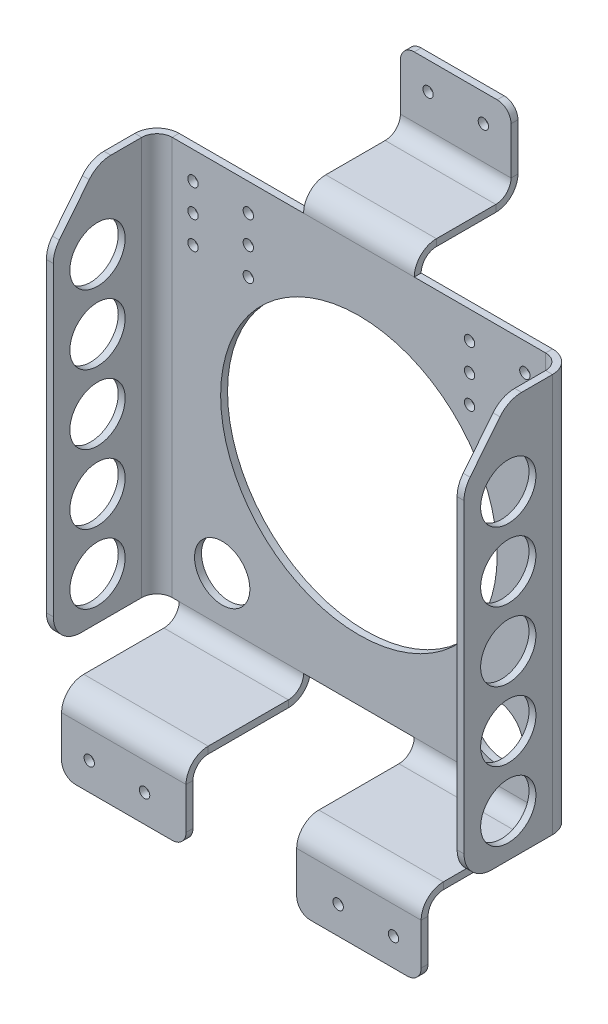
ISO-10303-21;
HEADER;
FILE_DESCRIPTION(('STEP AP214'),'2;1');
FILE_NAME('part.step','',(''),(''),'','','');
FILE_SCHEMA(('AUTOMOTIVE_DESIGN { 1 0 10303 214 1 1 1 1 }'));
ENDSEC;
DATA;
#1=APPLICATION_CONTEXT('core data for automotive mechanical design processes');
#2=APPLICATION_PROTOCOL_DEFINITION('international standard','automotive_design',2000,#1);
#3=PRODUCT_CONTEXT('',#1,'mechanical');
#4=PRODUCT('Part','Part','',(#3));
#5=PRODUCT_RELATED_PRODUCT_CATEGORY('part','',(#4));
#6=PRODUCT_DEFINITION_FORMATION('','',#4);
#7=PRODUCT_DEFINITION_CONTEXT('part definition',#1,'design');
#8=PRODUCT_DEFINITION('design','',#6,#7);
#9=PRODUCT_DEFINITION_SHAPE('','',#8);
#10=(LENGTH_UNIT() NAMED_UNIT(*) SI_UNIT(.MILLI.,.METRE.));
#11=(NAMED_UNIT(*) PLANE_ANGLE_UNIT() SI_UNIT($,.RADIAN.));
#12=(NAMED_UNIT(*) SI_UNIT($,.STERADIAN.) SOLID_ANGLE_UNIT());
#13=UNCERTAINTY_MEASURE_WITH_UNIT(LENGTH_MEASURE(1.E-05),#10,'distance_accuracy_value','');
#14=(GEOMETRIC_REPRESENTATION_CONTEXT(3) GLOBAL_UNCERTAINTY_ASSIGNED_CONTEXT((#13)) GLOBAL_UNIT_ASSIGNED_CONTEXT((#10,
#11,#12)) REPRESENTATION_CONTEXT('',''));
#15=CARTESIAN_POINT('',(0.,0.,0.));
#16=DIRECTION('',(0.,0.,1.));
#17=DIRECTION('',(1.,0.,0.));
#18=AXIS2_PLACEMENT_3D('',#15,#16,#17);
#19=CARTESIAN_POINT('',(95.9000000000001,-549.081013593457,-3.17500000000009));
#20=DIRECTION('',(0.,-1.,0.));
#21=DIRECTION('',(1.,0.,0.));
#22=AXIS2_PLACEMENT_3D('',#19,#20,#21);
#23=PLANE('',#22);
#24=DIRECTION('',(0.,0.,-1.));
#25=VECTOR('',#24,1.);
#26=CARTESIAN_POINT('',(92.7250000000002,-549.081013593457,-3.17500000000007));
#27=LINE('',#26,#25);
#28=CARTESIAN_POINT('',(92.725,-549.081013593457,-43.8000000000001));
#29=VERTEX_POINT('',#28);
#30=CARTESIAN_POINT('',(92.7250000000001,-549.081013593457,-29.5928432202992));
#31=VERTEX_POINT('',#30);
#32=EDGE_CURVE('E1079',#29,#31,#27,.F.);
#33=ORIENTED_EDGE('',*,*,#32,.T.);
#34=DIRECTION('',(-1.,0.,0.));
#35=VECTOR('',#34,1.);
#36=CARTESIAN_POINT('',(95.9,-549.081013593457,-29.5928432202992));
#37=LINE('',#36,#35);
#38=CARTESIAN_POINT('',(95.9000000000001,-549.081013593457,-29.5928432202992));
#39=VERTEX_POINT('',#38);
#40=EDGE_CURVE('E696',#31,#39,#37,.F.);
#41=ORIENTED_EDGE('',*,*,#40,.T.);
#42=DIRECTION('',(0.,0.,1.));
#43=VECTOR('',#42,1.);
#44=CARTESIAN_POINT('',(95.9000000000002,-549.081013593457,-2.99743439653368E-13));
#45=LINE('',#44,#43);
#46=CARTESIAN_POINT('',(95.9,-549.081013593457,-43.8000000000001));
#47=VERTEX_POINT('',#46);
#48=EDGE_CURVE('E1071',#47,#39,#45,.T.);
#49=ORIENTED_EDGE('',*,*,#48,.F.);
#50=DIRECTION('',(-1.,0.,0.));
#51=VECTOR('',#50,1.);
#52=CARTESIAN_POINT('',(92.725,-549.081013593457,-43.8000000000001));
#53=LINE('',#52,#51);
#54=EDGE_CURVE('E1085',#29,#47,#53,.F.);
#55=ORIENTED_EDGE('',*,*,#54,.F.);
#56=EDGE_LOOP('',(#33,#41,#49,#55));
#57=FACE_BOUND('',#56,.T.);
#58=ADVANCED_FACE('F118',(#57),#23,.F.);
#59=CARTESIAN_POINT('',(95.9000000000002,0.,-2.99743439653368E-13));
#60=DIRECTION('',(-1.,0.,0.));
#61=DIRECTION('',(0.,0.,1.));
#62=AXIS2_PLACEMENT_3D('',#59,#60,#61);
#63=PLANE('',#62);
#64=CARTESIAN_POINT('',(95.9000000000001,-585.470878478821,-23.4874999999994));
#65=DIRECTION('',(-1.,0.,0.));
#66=DIRECTION('',(0.,0.,1.));
#67=AXIS2_PLACEMENT_3D('',#64,#65,#66);
#68=CIRCLE('',#67,12.7);
#69=CARTESIAN_POINT('',(95.9000000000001,-585.470878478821,-10.7874999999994));
#70=VERTEX_POINT('',#69);
#71=EDGE_CURVE('E1168',#70,#70,#68,.T.);
#72=ORIENTED_EDGE('',*,*,#71,.T.);
#73=EDGE_LOOP('',(#72));
#74=FACE_BOUND('',#73,.T.);
#75=CARTESIAN_POINT('',(95.9000000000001,-617.220878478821,-23.4874999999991));
#76=DIRECTION('',(-1.,0.,0.));
#77=DIRECTION('',(0.,0.,1.));
#78=AXIS2_PLACEMENT_3D('',#75,#76,#77);
#79=CIRCLE('',#78,12.7);
#80=CARTESIAN_POINT('',(95.9000000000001,-617.220878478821,-10.7874999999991));
#81=VERTEX_POINT('',#80);
#82=EDGE_CURVE('E1162',#81,#81,#79,.T.);
#83=ORIENTED_EDGE('',*,*,#82,.T.);
#84=EDGE_LOOP('',(#83));
#85=FACE_BOUND('',#84,.T.);
#86=CARTESIAN_POINT('',(95.9000000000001,-648.970878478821,-23.4874999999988));
#87=DIRECTION('',(-1.,0.,0.));
#88=DIRECTION('',(0.,0.,1.));
#89=AXIS2_PLACEMENT_3D('',#86,#87,#88);
#90=CIRCLE('',#89,12.7);
#91=CARTESIAN_POINT('',(95.9000000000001,-648.970878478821,-10.7874999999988));
#92=VERTEX_POINT('',#91);
#93=EDGE_CURVE('E1156',#92,#92,#90,.T.);
#94=ORIENTED_EDGE('',*,*,#93,.T.);
#95=EDGE_LOOP('',(#94));
#96=FACE_BOUND('',#95,.T.);
#97=CARTESIAN_POINT('',(95.9000000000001,-680.720878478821,-23.4874999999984));
#98=DIRECTION('',(-1.,0.,0.));
#99=DIRECTION('',(0.,0.,1.));
#100=AXIS2_PLACEMENT_3D('',#97,#98,#99);
#101=CIRCLE('',#100,12.7);
#102=CARTESIAN_POINT('',(95.9000000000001,-680.720878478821,-10.7874999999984));
#103=VERTEX_POINT('',#102);
#104=EDGE_CURVE('E1150',#103,#103,#101,.T.);
#105=ORIENTED_EDGE('',*,*,#104,.T.);
#106=EDGE_LOOP('',(#105));
#107=FACE_BOUND('',#106,.T.);
#108=CARTESIAN_POINT('',(95.9000000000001,-712.470878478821,-23.4874999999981));
#109=DIRECTION('',(-1.,0.,0.));
#110=DIRECTION('',(0.,0.,1.));
#111=AXIS2_PLACEMENT_3D('',#108,#109,#110);
#112=CIRCLE('',#111,12.7);
#113=CARTESIAN_POINT('',(95.9000000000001,-712.470878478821,-10.7874999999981));
#114=VERTEX_POINT('',#113);
#115=EDGE_CURVE('E1143',#114,#114,#112,.T.);
#116=ORIENTED_EDGE('',*,*,#115,.T.);
#117=EDGE_LOOP('',(#116));
#118=FACE_BOUND('',#117,.T.);
#119=DIRECTION('',(0.,-1.,0.));
#120=VECTOR('',#119,1.);
#121=CARTESIAN_POINT('',(95.9000000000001,0.,-3.17499999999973));
#122=LINE('',#121,#120);
#123=CARTESIAN_POINT('',(95.9000000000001,-578.934648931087,-3.1750000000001));
#124=VERTEX_POINT('',#123);
#125=CARTESIAN_POINT('',(95.9000000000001,-719.424999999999,-3.17500000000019));
#126=VERTEX_POINT('',#125);
#127=EDGE_CURVE('E1068',#124,#126,#122,.T.);
#128=ORIENTED_EDGE('',*,*,#127,.T.);
#129=CARTESIAN_POINT('',(95.9000000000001,-719.424999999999,-15.8750000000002));
#130=DIRECTION('',(-1.,0.,0.));
#131=DIRECTION('',(0.,0.,1.));
#132=AXIS2_PLACEMENT_3D('',#129,#130,#131);
#133=CIRCLE('',#132,12.7);
#134=CARTESIAN_POINT('',(95.9000000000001,-732.124999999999,-15.8750000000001));
#135=VERTEX_POINT('',#134);
#136=EDGE_CURVE('E694',#126,#135,#133,.F.);
#137=ORIENTED_EDGE('',*,*,#136,.T.);
#138=DIRECTION('',(0.,0.,-1.));
#139=VECTOR('',#138,1.);
#140=CARTESIAN_POINT('',(95.9000000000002,-732.124999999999,3.11368241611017E-12));
#141=LINE('',#140,#139);
#142=CARTESIAN_POINT('',(95.9,-732.124999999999,-43.8000000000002));
#143=VERTEX_POINT('',#142);
#144=EDGE_CURVE('E1065',#135,#143,#141,.T.);
#145=ORIENTED_EDGE('',*,*,#144,.T.);
#146=DIRECTION('',(0.,1.,0.));
#147=VECTOR('',#146,1.);
#148=CARTESIAN_POINT('',(95.9,-732.124999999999,-43.8000000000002));
#149=LINE('',#148,#147);
#150=EDGE_CURVE('E1082',#47,#143,#149,.F.);
#151=ORIENTED_EDGE('',*,*,#150,.F.);
#152=ORIENTED_EDGE('',*,*,#48,.T.);
#153=CARTESIAN_POINT('',(95.9000000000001,-561.781013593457,-29.5928432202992));
#154=DIRECTION('',(-1.,0.,0.));
#155=DIRECTION('',(0.,0.,1.));
#156=AXIS2_PLACEMENT_3D('',#153,#154,#155);
#157=CIRCLE('',#156,12.7);
#158=CARTESIAN_POINT('',(95.9000000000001,-553.849172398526,-19.6743808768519));
#159=VERTEX_POINT('',#158);
#160=EDGE_CURVE('E692',#39,#159,#157,.F.);
#161=ORIENTED_EDGE('',*,*,#160,.T.);
#162=DIRECTION('',(0.,-0.780981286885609,0.62455442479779));
#163=VECTOR('',#162,1.);
#164=CARTESIAN_POINT('',(95.8999999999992,-225.635446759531,-282.148447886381));
#165=LINE('',#164,#163);
#166=CARTESIAN_POINT('',(95.9000000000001,-571.002807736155,-5.9565376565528));
#167=VERTEX_POINT('',#166);
#168=EDGE_CURVE('E1133',#159,#167,#165,.T.);
#169=ORIENTED_EDGE('',*,*,#168,.T.);
#170=CARTESIAN_POINT('',(95.9000000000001,-578.934648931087,-15.8750000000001));
#171=DIRECTION('',(-1.,0.,0.));
#172=DIRECTION('',(0.,0.,1.));
#173=AXIS2_PLACEMENT_3D('',#170,#171,#172);
#174=CIRCLE('',#173,12.7);
#175=EDGE_CURVE('E690',#167,#124,#174,.F.);
#176=ORIENTED_EDGE('',*,*,#175,.T.);
#177=EDGE_LOOP('',(#128,#137,#145,#151,#152,#161,#169,#176));
#178=FACE_BOUND('',#177,.T.);
#179=ADVANCED_FACE('F1132',(#74,#85,#96,#107,#118,#178),#63,.F.);
#180=CARTESIAN_POINT('',(92.7250000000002,0.,-2.88657986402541E-13));
#181=DIRECTION('',(-1.,0.,0.));
#182=DIRECTION('',(0.,0.,1.));
#183=AXIS2_PLACEMENT_3D('',#180,#181,#182);
#184=PLANE('',#183);
#185=CARTESIAN_POINT('',(92.7250000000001,-712.470878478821,-23.4874999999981));
#186=DIRECTION('',(-1.,0.,0.));
#187=DIRECTION('',(0.,0.,1.));
#188=AXIS2_PLACEMENT_3D('',#185,#186,#187);
#189=CIRCLE('',#188,12.7);
#190=CARTESIAN_POINT('',(92.7250000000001,-712.470878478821,-10.7874999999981));
#191=VERTEX_POINT('',#190);
#192=EDGE_CURVE('E1139',#191,#191,#189,.T.);
#193=ORIENTED_EDGE('',*,*,#192,.F.);
#194=EDGE_LOOP('',(#193));
#195=FACE_BOUND('',#194,.T.);
#196=CARTESIAN_POINT('',(92.7250000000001,-680.720878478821,-23.4874999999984));
#197=DIRECTION('',(-1.,0.,0.));
#198=DIRECTION('',(0.,0.,1.));
#199=AXIS2_PLACEMENT_3D('',#196,#197,#198);
#200=CIRCLE('',#199,12.7);
#201=CARTESIAN_POINT('',(92.7250000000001,-680.720878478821,-10.7874999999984));
#202=VERTEX_POINT('',#201);
#203=EDGE_CURVE('E1148',#202,#202,#200,.T.);
#204=ORIENTED_EDGE('',*,*,#203,.F.);
#205=EDGE_LOOP('',(#204));
#206=FACE_BOUND('',#205,.T.);
#207=CARTESIAN_POINT('',(92.7250000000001,-648.970878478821,-23.4874999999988));
#208=DIRECTION('',(-1.,0.,0.));
#209=DIRECTION('',(0.,0.,1.));
#210=AXIS2_PLACEMENT_3D('',#207,#208,#209);
#211=CIRCLE('',#210,12.7);
#212=CARTESIAN_POINT('',(92.7250000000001,-648.970878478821,-10.7874999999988));
#213=VERTEX_POINT('',#212);
#214=EDGE_CURVE('E1153',#213,#213,#211,.T.);
#215=ORIENTED_EDGE('',*,*,#214,.F.);
#216=EDGE_LOOP('',(#215));
#217=FACE_BOUND('',#216,.T.);
#218=CARTESIAN_POINT('',(92.7250000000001,-617.220878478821,-23.4874999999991));
#219=DIRECTION('',(-1.,0.,0.));
#220=DIRECTION('',(0.,0.,1.));
#221=AXIS2_PLACEMENT_3D('',#218,#219,#220);
#222=CIRCLE('',#221,12.7);
#223=CARTESIAN_POINT('',(92.7250000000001,-617.220878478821,-10.7874999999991));
#224=VERTEX_POINT('',#223);
#225=EDGE_CURVE('E1159',#224,#224,#222,.T.);
#226=ORIENTED_EDGE('',*,*,#225,.F.);
#227=EDGE_LOOP('',(#226));
#228=FACE_BOUND('',#227,.T.);
#229=CARTESIAN_POINT('',(92.7250000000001,-585.470878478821,-23.4874999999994));
#230=DIRECTION('',(-1.,0.,0.));
#231=DIRECTION('',(0.,0.,1.));
#232=AXIS2_PLACEMENT_3D('',#229,#230,#231);
#233=CIRCLE('',#232,12.7);
#234=CARTESIAN_POINT('',(92.7250000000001,-585.470878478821,-10.7874999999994));
#235=VERTEX_POINT('',#234);
#236=EDGE_CURVE('E1165',#235,#235,#233,.T.);
#237=ORIENTED_EDGE('',*,*,#236,.F.);
#238=EDGE_LOOP('',(#237));
#239=FACE_BOUND('',#238,.T.);
#240=DIRECTION('',(0.,0.,1.));
#241=VECTOR('',#240,1.);
#242=CARTESIAN_POINT('',(92.725,-732.124999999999,-50.8000000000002));
#243=LINE('',#242,#241);
#244=CARTESIAN_POINT('',(92.7250000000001,-732.124999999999,-15.8750000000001));
#245=VERTEX_POINT('',#244);
#246=CARTESIAN_POINT('',(92.725,-732.124999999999,-43.8000000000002));
#247=VERTEX_POINT('',#246);
#248=EDGE_CURVE('E1074',#245,#247,#243,.F.);
#249=ORIENTED_EDGE('',*,*,#248,.F.);
#250=CARTESIAN_POINT('',(92.7250000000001,-719.424999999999,-15.8750000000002));
#251=DIRECTION('',(-1.,0.,0.));
#252=DIRECTION('',(0.,0.,1.));
#253=AXIS2_PLACEMENT_3D('',#250,#251,#252);
#254=CIRCLE('',#253,12.7);
#255=CARTESIAN_POINT('',(92.7250000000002,-719.424999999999,-3.17500000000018));
#256=VERTEX_POINT('',#255);
#257=EDGE_CURVE('E684',#245,#256,#254,.T.);
#258=ORIENTED_EDGE('',*,*,#257,.T.);
#259=DIRECTION('',(0.,1.,0.));
#260=VECTOR('',#259,1.);
#261=CARTESIAN_POINT('',(92.7250000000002,-732.124999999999,-3.17500000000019));
#262=LINE('',#261,#260);
#263=CARTESIAN_POINT('',(92.7250000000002,-578.934648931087,-3.17500000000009));
#264=VERTEX_POINT('',#263);
#265=EDGE_CURVE('E1076',#264,#256,#262,.F.);
#266=ORIENTED_EDGE('',*,*,#265,.F.);
#267=CARTESIAN_POINT('',(92.7250000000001,-578.934648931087,-15.8750000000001));
#268=DIRECTION('',(-1.,0.,0.));
#269=DIRECTION('',(0.,0.,1.));
#270=AXIS2_PLACEMENT_3D('',#267,#268,#269);
#271=CIRCLE('',#270,12.7);
#272=CARTESIAN_POINT('',(92.7250000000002,-571.002807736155,-5.9565376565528));
#273=VERTEX_POINT('',#272);
#274=EDGE_CURVE('E680',#264,#273,#271,.T.);
#275=ORIENTED_EDGE('',*,*,#274,.T.);
#276=DIRECTION('',(0.,-0.780981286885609,0.62455442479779));
#277=VECTOR('',#276,1.);
#278=CARTESIAN_POINT('',(92.7249999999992,-225.635446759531,-282.148447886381));
#279=LINE('',#278,#277);
#280=CARTESIAN_POINT('',(92.7250000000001,-553.849172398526,-19.6743808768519));
#281=VERTEX_POINT('',#280);
#282=EDGE_CURVE('E1140',#281,#273,#279,.T.);
#283=ORIENTED_EDGE('',*,*,#282,.F.);
#284=CARTESIAN_POINT('',(92.7250000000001,-561.781013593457,-29.5928432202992));
#285=DIRECTION('',(-1.,0.,0.));
#286=DIRECTION('',(0.,0.,1.));
#287=AXIS2_PLACEMENT_3D('',#284,#285,#286);
#288=CIRCLE('',#287,12.7);
#289=EDGE_CURVE('E682',#281,#31,#288,.T.);
#290=ORIENTED_EDGE('',*,*,#289,.T.);
#291=ORIENTED_EDGE('',*,*,#32,.F.);
#292=DIRECTION('',(0.,1.,0.));
#293=VECTOR('',#292,1.);
#294=CARTESIAN_POINT('',(92.725,-732.124999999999,-43.8000000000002));
#295=LINE('',#294,#293);
#296=EDGE_CURVE('E1088',#247,#29,#295,.T.);
#297=ORIENTED_EDGE('',*,*,#296,.F.);
#298=EDGE_LOOP('',(#249,#258,#266,#275,#283,#290,#291,#297));
#299=FACE_BOUND('',#298,.T.);
#300=ADVANCED_FACE('F1120',(#195,#206,#217,#228,#239,#299),#184,.T.);
#301=CARTESIAN_POINT('',(95.9000000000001,-732.124999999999,-3.1750000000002));
#302=DIRECTION('',(0.,0.,-1.));
#303=DIRECTION('',(-1.,0.,0.));
#304=AXIS2_PLACEMENT_3D('',#301,#302,#303);
#305=PLANE('',#304);
#306=ORIENTED_EDGE('',*,*,#265,.T.);
#307=DIRECTION('',(-1.,0.,0.));
#308=VECTOR('',#307,1.);
#309=CARTESIAN_POINT('',(95.9000000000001,-719.424999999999,-3.17500000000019));
#310=LINE('',#309,#308);
#311=EDGE_CURVE('E688',#256,#126,#310,.F.);
#312=ORIENTED_EDGE('',*,*,#311,.T.);
#313=ORIENTED_EDGE('',*,*,#127,.F.);
#314=DIRECTION('',(-1.,0.,0.));
#315=VECTOR('',#314,1.);
#316=CARTESIAN_POINT('',(92.7250000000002,-578.934648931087,-3.17500000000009));
#317=LINE('',#316,#315);
#318=EDGE_CURVE('E686',#124,#264,#317,.T.);
#319=ORIENTED_EDGE('',*,*,#318,.T.);
#320=EDGE_LOOP('',(#306,#312,#313,#319));
#321=FACE_BOUND('',#320,.T.);
#322=ADVANCED_FACE('F1293',(#321),#305,.F.);
#323=CARTESIAN_POINT('',(-95.9,-549.081013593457,-50.8000000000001));
#324=DIRECTION('',(0.,-1.,0.));
#325=DIRECTION('',(1.,0.,0.));
#326=AXIS2_PLACEMENT_3D('',#323,#324,#325);
#327=PLANE('',#326);
#328=DIRECTION('',(0.,0.,-1.));
#329=VECTOR('',#328,1.);
#330=CARTESIAN_POINT('',(-95.9000000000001,-549.081013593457,-2.99743439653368E-13));
#331=LINE('',#330,#329);
#332=CARTESIAN_POINT('',(-95.9,-549.081013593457,-29.5928432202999));
#333=VERTEX_POINT('',#332);
#334=CARTESIAN_POINT('',(-95.9,-549.081013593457,-43.8000000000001));
#335=VERTEX_POINT('',#334);
#336=EDGE_CURVE('E739',#333,#335,#331,.T.);
#337=ORIENTED_EDGE('',*,*,#336,.F.);
#338=DIRECTION('',(1.,0.,0.));
#339=VECTOR('',#338,1.);
#340=CARTESIAN_POINT('',(-92.725,-549.081013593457,-29.5928432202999));
#341=LINE('',#340,#339);
#342=CARTESIAN_POINT('',(-92.725,-549.081013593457,-29.5928432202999));
#343=VERTEX_POINT('',#342);
#344=EDGE_CURVE('E715',#333,#343,#341,.T.);
#345=ORIENTED_EDGE('',*,*,#344,.T.);
#346=DIRECTION('',(0.,0.,1.));
#347=VECTOR('',#346,1.);
#348=CARTESIAN_POINT('',(-92.725,-549.081013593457,-50.8));
#349=LINE('',#348,#347);
#350=CARTESIAN_POINT('',(-92.725,-549.081013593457,-43.8000000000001));
#351=VERTEX_POINT('',#350);
#352=EDGE_CURVE('E744',#343,#351,#349,.F.);
#353=ORIENTED_EDGE('',*,*,#352,.T.);
#354=DIRECTION('',(1.,0.,0.));
#355=VECTOR('',#354,1.);
#356=CARTESIAN_POINT('',(-95.9,-549.081013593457,-43.8000000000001));
#357=LINE('',#356,#355);
#358=EDGE_CURVE('E760',#351,#335,#357,.F.);
#359=ORIENTED_EDGE('',*,*,#358,.T.);
#360=EDGE_LOOP('',(#337,#345,#353,#359));
#361=FACE_BOUND('',#360,.T.);
#362=ADVANCED_FACE('F1312',(#361),#327,.F.);
#363=CARTESIAN_POINT('',(-95.9000000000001,0.,-2.99743439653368E-13));
#364=DIRECTION('',(1.,0.,0.));
#365=DIRECTION('',(0.,0.,-1.));
#366=AXIS2_PLACEMENT_3D('',#363,#364,#365);
#367=PLANE('',#366);
#368=CARTESIAN_POINT('',(-95.9,-585.470878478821,-23.4875000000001));
#369=DIRECTION('',(1.,0.,0.));
#370=DIRECTION('',(0.,0.,-1.));
#371=AXIS2_PLACEMENT_3D('',#368,#369,#370);
#372=CIRCLE('',#371,12.7);
#373=CARTESIAN_POINT('',(-95.9,-585.470878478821,-36.1875000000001));
#374=VERTEX_POINT('',#373);
#375=EDGE_CURVE('E1203',#374,#374,#372,.T.);
#376=ORIENTED_EDGE('',*,*,#375,.T.);
#377=EDGE_LOOP('',(#376));
#378=FACE_BOUND('',#377,.T.);
#379=CARTESIAN_POINT('',(-95.9,-617.220878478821,-23.4874999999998));
#380=DIRECTION('',(1.,0.,0.));
#381=DIRECTION('',(0.,0.,-1.));
#382=AXIS2_PLACEMENT_3D('',#379,#380,#381);
#383=CIRCLE('',#382,12.7);
#384=CARTESIAN_POINT('',(-95.9,-617.220878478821,-36.1874999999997));
#385=VERTEX_POINT('',#384);
#386=EDGE_CURVE('E1197',#385,#385,#383,.T.);
#387=ORIENTED_EDGE('',*,*,#386,.T.);
#388=EDGE_LOOP('',(#387));
#389=FACE_BOUND('',#388,.T.);
#390=CARTESIAN_POINT('',(-95.9,-648.970878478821,-23.4874999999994));
#391=DIRECTION('',(1.,0.,0.));
#392=DIRECTION('',(0.,0.,-1.));
#393=AXIS2_PLACEMENT_3D('',#390,#391,#392);
#394=CIRCLE('',#393,12.7);
#395=CARTESIAN_POINT('',(-95.9,-648.970878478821,-36.1874999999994));
#396=VERTEX_POINT('',#395);
#397=EDGE_CURVE('E1191',#396,#396,#394,.T.);
#398=ORIENTED_EDGE('',*,*,#397,.T.);
#399=EDGE_LOOP('',(#398));
#400=FACE_BOUND('',#399,.T.);
#401=CARTESIAN_POINT('',(-95.9,-680.720878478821,-23.4874999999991));
#402=DIRECTION('',(1.,0.,0.));
#403=DIRECTION('',(0.,0.,-1.));
#404=AXIS2_PLACEMENT_3D('',#401,#402,#403);
#405=CIRCLE('',#404,12.7);
#406=CARTESIAN_POINT('',(-95.9,-680.720878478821,-36.1874999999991));
#407=VERTEX_POINT('',#406);
#408=EDGE_CURVE('E1185',#407,#407,#405,.T.);
#409=ORIENTED_EDGE('',*,*,#408,.T.);
#410=EDGE_LOOP('',(#409));
#411=FACE_BOUND('',#410,.T.);
#412=CARTESIAN_POINT('',(-95.9,-712.470878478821,-23.4874999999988));
#413=DIRECTION('',(1.,0.,0.));
#414=DIRECTION('',(0.,0.,-1.));
#415=AXIS2_PLACEMENT_3D('',#412,#413,#414);
#416=CIRCLE('',#415,12.7);
#417=CARTESIAN_POINT('',(-95.9,-712.470878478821,-36.1874999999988));
#418=VERTEX_POINT('',#417);
#419=EDGE_CURVE('E1179',#418,#418,#416,.T.);
#420=ORIENTED_EDGE('',*,*,#419,.T.);
#421=EDGE_LOOP('',(#420));
#422=FACE_BOUND('',#421,.T.);
#423=DIRECTION('',(0.,0.780981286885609,-0.62455442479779));
#424=VECTOR('',#423,1.);
#425=CARTESIAN_POINT('',(-95.8999999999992,-225.635446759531,-282.148447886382));
#426=LINE('',#425,#424);
#427=CARTESIAN_POINT('',(-95.9000000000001,-571.002807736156,-5.95653765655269));
#428=VERTEX_POINT('',#427);
#429=CARTESIAN_POINT('',(-95.9000000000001,-553.849172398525,-19.6743808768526));
#430=VERTEX_POINT('',#429);
#431=EDGE_CURVE('E1174',#428,#430,#426,.T.);
#432=ORIENTED_EDGE('',*,*,#431,.T.);
#433=CARTESIAN_POINT('',(-95.9,-561.781013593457,-29.5928432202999));
#434=DIRECTION('',(1.,0.,0.));
#435=DIRECTION('',(0.,0.,-1.));
#436=AXIS2_PLACEMENT_3D('',#433,#434,#435);
#437=CIRCLE('',#436,12.7);
#438=EDGE_CURVE('E713',#430,#333,#437,.F.);
#439=ORIENTED_EDGE('',*,*,#438,.T.);
#440=ORIENTED_EDGE('',*,*,#336,.T.);
#441=DIRECTION('',(0.,-1.,0.));
#442=VECTOR('',#441,1.);
#443=CARTESIAN_POINT('',(-95.9,-549.081013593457,-43.8000000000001));
#444=LINE('',#443,#442);
#445=CARTESIAN_POINT('',(-95.9,-732.124999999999,-43.8000000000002));
#446=VERTEX_POINT('',#445);
#447=EDGE_CURVE('E752',#446,#335,#444,.F.);
#448=ORIENTED_EDGE('',*,*,#447,.F.);
#449=DIRECTION('',(0.,0.,1.));
#450=VECTOR('',#449,1.);
#451=CARTESIAN_POINT('',(-95.9000000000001,-732.124999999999,4.82039534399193E-12));
#452=LINE('',#451,#450);
#453=CARTESIAN_POINT('',(-95.9000000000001,-732.124999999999,-15.8750000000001));
#454=VERTEX_POINT('',#453);
#455=EDGE_CURVE('E740',#446,#454,#452,.T.);
#456=ORIENTED_EDGE('',*,*,#455,.T.);
#457=CARTESIAN_POINT('',(-95.9000000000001,-719.424999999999,-15.8750000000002));
#458=DIRECTION('',(1.,0.,0.));
#459=DIRECTION('',(0.,0.,-1.));
#460=AXIS2_PLACEMENT_3D('',#457,#458,#459);
#461=CIRCLE('',#460,12.7);
#462=CARTESIAN_POINT('',(-95.9000000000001,-719.424999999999,-3.17500000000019));
#463=VERTEX_POINT('',#462);
#464=EDGE_CURVE('E709',#454,#463,#461,.F.);
#465=ORIENTED_EDGE('',*,*,#464,.T.);
#466=DIRECTION('',(0.,1.,0.));
#467=VECTOR('',#466,1.);
#468=CARTESIAN_POINT('',(-95.9000000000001,0.,-3.17499999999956));
#469=LINE('',#468,#467);
#470=CARTESIAN_POINT('',(-95.9000000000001,-578.934648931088,-3.17500000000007));
#471=VERTEX_POINT('',#470);
#472=EDGE_CURVE('E729',#463,#471,#469,.T.);
#473=ORIENTED_EDGE('',*,*,#472,.T.);
#474=CARTESIAN_POINT('',(-95.9000000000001,-578.934648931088,-15.8750000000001));
#475=DIRECTION('',(1.,0.,0.));
#476=DIRECTION('',(0.,0.,-1.));
#477=AXIS2_PLACEMENT_3D('',#474,#475,#476);
#478=CIRCLE('',#477,12.7);
#479=EDGE_CURVE('E711',#471,#428,#478,.F.);
#480=ORIENTED_EDGE('',*,*,#479,.T.);
#481=EDGE_LOOP('',(#432,#439,#440,#448,#456,#465,#473,#480));
#482=FACE_BOUND('',#481,.T.);
#483=ADVANCED_FACE('F735',(#378,#389,#400,#411,#422,#482),#367,.F.);
#484=CARTESIAN_POINT('',(-92.7250000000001,0.,-2.88657986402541E-13));
#485=DIRECTION('',(1.,0.,0.));
#486=DIRECTION('',(0.,0.,-1.));
#487=AXIS2_PLACEMENT_3D('',#484,#485,#486);
#488=PLANE('',#487);
#489=CARTESIAN_POINT('',(-92.725,-712.470878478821,-23.4874999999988));
#490=DIRECTION('',(1.,0.,0.));
#491=DIRECTION('',(0.,0.,-1.));
#492=AXIS2_PLACEMENT_3D('',#489,#490,#491);
#493=CIRCLE('',#492,12.7);
#494=CARTESIAN_POINT('',(-92.725,-712.470878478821,-36.1874999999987));
#495=VERTEX_POINT('',#494);
#496=EDGE_CURVE('E1176',#495,#495,#493,.T.);
#497=ORIENTED_EDGE('',*,*,#496,.F.);
#498=EDGE_LOOP('',(#497));
#499=FACE_BOUND('',#498,.T.);
#500=CARTESIAN_POINT('',(-92.725,-680.720878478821,-23.4874999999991));
#501=DIRECTION('',(1.,0.,0.));
#502=DIRECTION('',(0.,0.,-1.));
#503=AXIS2_PLACEMENT_3D('',#500,#501,#502);
#504=CIRCLE('',#503,12.7);
#505=CARTESIAN_POINT('',(-92.725,-680.720878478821,-36.1874999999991));
#506=VERTEX_POINT('',#505);
#507=EDGE_CURVE('E1182',#506,#506,#504,.T.);
#508=ORIENTED_EDGE('',*,*,#507,.F.);
#509=EDGE_LOOP('',(#508));
#510=FACE_BOUND('',#509,.T.);
#511=CARTESIAN_POINT('',(-92.725,-648.970878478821,-23.4874999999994));
#512=DIRECTION('',(1.,0.,0.));
#513=DIRECTION('',(0.,0.,-1.));
#514=AXIS2_PLACEMENT_3D('',#511,#512,#513);
#515=CIRCLE('',#514,12.7);
#516=CARTESIAN_POINT('',(-92.725,-648.970878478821,-36.1874999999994));
#517=VERTEX_POINT('',#516);
#518=EDGE_CURVE('E1188',#517,#517,#515,.T.);
#519=ORIENTED_EDGE('',*,*,#518,.F.);
#520=EDGE_LOOP('',(#519));
#521=FACE_BOUND('',#520,.T.);
#522=CARTESIAN_POINT('',(-92.725,-617.220878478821,-23.4874999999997));
#523=DIRECTION('',(1.,0.,0.));
#524=DIRECTION('',(0.,0.,-1.));
#525=AXIS2_PLACEMENT_3D('',#522,#523,#524);
#526=CIRCLE('',#525,12.7);
#527=CARTESIAN_POINT('',(-92.725,-617.220878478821,-36.1874999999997));
#528=VERTEX_POINT('',#527);
#529=EDGE_CURVE('E1194',#528,#528,#526,.T.);
#530=ORIENTED_EDGE('',*,*,#529,.F.);
#531=EDGE_LOOP('',(#530));
#532=FACE_BOUND('',#531,.T.);
#533=CARTESIAN_POINT('',(-92.725,-585.470878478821,-23.4875000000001));
#534=DIRECTION('',(1.,0.,0.));
#535=DIRECTION('',(0.,0.,-1.));
#536=AXIS2_PLACEMENT_3D('',#533,#534,#535);
#537=CIRCLE('',#536,12.7);
#538=CARTESIAN_POINT('',(-92.725,-585.470878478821,-36.1875000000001));
#539=VERTEX_POINT('',#538);
#540=EDGE_CURVE('E1200',#539,#539,#537,.T.);
#541=ORIENTED_EDGE('',*,*,#540,.F.);
#542=EDGE_LOOP('',(#541));
#543=FACE_BOUND('',#542,.T.);
#544=ORIENTED_EDGE('',*,*,#352,.F.);
#545=CARTESIAN_POINT('',(-92.725,-561.781013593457,-29.5928432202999));
#546=DIRECTION('',(1.,0.,0.));
#547=DIRECTION('',(0.,0.,-1.));
#548=AXIS2_PLACEMENT_3D('',#545,#546,#547);
#549=CIRCLE('',#548,12.7);
#550=CARTESIAN_POINT('',(-92.7250000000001,-553.849172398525,-19.6743808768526));
#551=VERTEX_POINT('',#550);
#552=EDGE_CURVE('E719',#343,#551,#549,.T.);
#553=ORIENTED_EDGE('',*,*,#552,.T.);
#554=DIRECTION('',(0.,0.780981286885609,-0.62455442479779));
#555=VECTOR('',#554,1.);
#556=CARTESIAN_POINT('',(-92.7249999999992,-225.635446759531,-282.148447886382));
#557=LINE('',#556,#555);
#558=CARTESIAN_POINT('',(-92.7250000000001,-571.002807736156,-5.95653765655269));
#559=VERTEX_POINT('',#558);
#560=EDGE_CURVE('E1171',#559,#551,#557,.T.);
#561=ORIENTED_EDGE('',*,*,#560,.F.);
#562=CARTESIAN_POINT('',(-92.7250000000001,-578.934648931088,-15.8750000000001));
#563=DIRECTION('',(1.,0.,0.));
#564=DIRECTION('',(0.,0.,-1.));
#565=AXIS2_PLACEMENT_3D('',#562,#563,#564);
#566=CIRCLE('',#565,12.7);
#567=CARTESIAN_POINT('',(-92.7250000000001,-578.934648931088,-3.17500000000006));
#568=VERTEX_POINT('',#567);
#569=EDGE_CURVE('E139',#559,#568,#566,.T.);
#570=ORIENTED_EDGE('',*,*,#569,.T.);
#571=DIRECTION('',(0.,-1.,0.));
#572=VECTOR('',#571,1.);
#573=CARTESIAN_POINT('',(-92.7250000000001,-549.081013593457,-3.17500000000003));
#574=LINE('',#573,#572);
#575=CARTESIAN_POINT('',(-92.7250000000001,-719.424999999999,-3.17500000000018));
#576=VERTEX_POINT('',#575);
#577=EDGE_CURVE('E731',#576,#568,#574,.F.);
#578=ORIENTED_EDGE('',*,*,#577,.F.);
#579=CARTESIAN_POINT('',(-92.7250000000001,-719.424999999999,-15.8750000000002));
#580=DIRECTION('',(1.,0.,0.));
#581=DIRECTION('',(0.,0.,-1.));
#582=AXIS2_PLACEMENT_3D('',#579,#580,#581);
#583=CIRCLE('',#582,12.7);
#584=CARTESIAN_POINT('',(-92.7250000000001,-732.124999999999,-15.8750000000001));
#585=VERTEX_POINT('',#584);
#586=EDGE_CURVE('E133',#576,#585,#583,.T.);
#587=ORIENTED_EDGE('',*,*,#586,.T.);
#588=DIRECTION('',(0.,0.,-1.));
#589=VECTOR('',#588,1.);
#590=CARTESIAN_POINT('',(-92.7250000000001,-732.124999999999,-3.17500000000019));
#591=LINE('',#590,#589);
#592=CARTESIAN_POINT('',(-92.725,-732.124999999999,-43.8000000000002));
#593=VERTEX_POINT('',#592);
#594=EDGE_CURVE('E750',#593,#585,#591,.F.);
#595=ORIENTED_EDGE('',*,*,#594,.F.);
#596=DIRECTION('',(0.,-1.,0.));
#597=VECTOR('',#596,1.);
#598=CARTESIAN_POINT('',(-92.725,-549.081013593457,-43.8000000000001));
#599=LINE('',#598,#597);
#600=EDGE_CURVE('E758',#351,#593,#599,.T.);
#601=ORIENTED_EDGE('',*,*,#600,.F.);
#602=EDGE_LOOP('',(#544,#553,#561,#570,#578,#587,#595,#601));
#603=FACE_BOUND('',#602,.T.);
#604=ADVANCED_FACE('F1311',(#499,#510,#521,#532,#543,#603),#488,.T.);
#605=CARTESIAN_POINT('',(-95.9000000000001,-549.081013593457,-3.17500000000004));
#606=DIRECTION('',(0.,0.,-1.));
#607=DIRECTION('',(-1.,0.,0.));
#608=AXIS2_PLACEMENT_3D('',#605,#606,#607);
#609=PLANE('',#608);
#610=ORIENTED_EDGE('',*,*,#577,.T.);
#611=DIRECTION('',(1.,0.,0.));
#612=VECTOR('',#611,1.);
#613=CARTESIAN_POINT('',(-95.9000000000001,-578.934648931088,-3.17500000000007));
#614=LINE('',#613,#612);
#615=EDGE_CURVE('E126',#568,#471,#614,.F.);
#616=ORIENTED_EDGE('',*,*,#615,.T.);
#617=ORIENTED_EDGE('',*,*,#472,.F.);
#618=DIRECTION('',(1.,0.,0.));
#619=VECTOR('',#618,1.);
#620=CARTESIAN_POINT('',(-95.9000000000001,-719.424999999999,-3.17500000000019));
#621=LINE('',#620,#619);
#622=EDGE_CURVE('E721',#463,#576,#621,.T.);
#623=ORIENTED_EDGE('',*,*,#622,.T.);
#624=EDGE_LOOP('',(#610,#616,#617,#623));
#625=FACE_BOUND('',#624,.T.);
#626=ADVANCED_FACE('F728',(#625),#609,.F.);
#627=CARTESIAN_POINT('',(0.,-538.906013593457,-2.69401957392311E-12));
#628=DIRECTION('',(0.,-1.,0.));
#629=DIRECTION('',(0.,0.,-1.));
#630=AXIS2_PLACEMENT_3D('',#627,#628,#629);
#631=PLANE('',#630);
#632=DIRECTION('',(0.,0.,-1.));
#633=VECTOR('',#632,1.);
#634=CARTESIAN_POINT('',(25.4,-538.906013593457,-2.69203988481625E-12));
#635=LINE('',#634,#633);
#636=CARTESIAN_POINT('',(25.4,-538.906013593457,-60.975));
#637=VERTEX_POINT('',#636);
#638=CARTESIAN_POINT('',(25.4,-538.906013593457,-88.2500000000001));
#639=VERTEX_POINT('',#638);
#640=EDGE_CURVE('E1222',#637,#639,#635,.T.);
#641=ORIENTED_EDGE('',*,*,#640,.T.);
#642=DIRECTION('',(-1.,0.,0.));
#643=VECTOR('',#642,1.);
#644=CARTESIAN_POINT('',(-82.55,-538.906013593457,-88.2500000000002));
#645=LINE('',#644,#643);
#646=CARTESIAN_POINT('',(-25.4,-538.906013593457,-88.2500000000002));
#647=VERTEX_POINT('',#646);
#648=EDGE_CURVE('E805',#647,#639,#645,.F.);
#649=ORIENTED_EDGE('',*,*,#648,.F.);
#650=DIRECTION('',(0.,0.,-1.));
#651=VECTOR('',#650,1.);
#652=CARTESIAN_POINT('',(-25.4,-538.906013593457,-2.69203988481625E-12));
#653=LINE('',#652,#651);
#654=CARTESIAN_POINT('',(-25.4,-538.906013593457,-60.975));
#655=VERTEX_POINT('',#654);
#656=EDGE_CURVE('E860',#647,#655,#653,.F.);
#657=ORIENTED_EDGE('',*,*,#656,.T.);
#658=DIRECTION('',(-1.,0.,0.));
#659=VECTOR('',#658,1.);
#660=CARTESIAN_POINT('',(0.,-538.906013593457,-60.975));
#661=LINE('',#660,#659);
#662=EDGE_CURVE('E514',#637,#655,#661,.T.);
#663=ORIENTED_EDGE('',*,*,#662,.F.);
#664=EDGE_LOOP('',(#641,#649,#657,#663));
#665=FACE_BOUND('',#664,.T.);
#666=ADVANCED_FACE('F1236',(#665),#631,.F.);
#667=CARTESIAN_POINT('',(0.,-542.081013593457,-2.70790021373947E-12));
#668=DIRECTION('',(0.,-1.,0.));
#669=DIRECTION('',(0.,0.,-1.));
#670=AXIS2_PLACEMENT_3D('',#667,#668,#669);
#671=PLANE('',#670);
#672=DIRECTION('',(-1.,0.,0.));
#673=VECTOR('',#672,1.);
#674=CARTESIAN_POINT('',(-82.55,-542.081013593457,-88.2500000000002));
#675=LINE('',#674,#673);
#676=CARTESIAN_POINT('',(-25.4,-542.081013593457,-88.2500000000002));
#677=VERTEX_POINT('',#676);
#678=CARTESIAN_POINT('',(25.4,-542.081013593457,-88.2500000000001));
#679=VERTEX_POINT('',#678);
#680=EDGE_CURVE('E813',#677,#679,#675,.F.);
#681=ORIENTED_EDGE('',*,*,#680,.T.);
#682=DIRECTION('',(0.,0.,-1.));
#683=VECTOR('',#682,1.);
#684=CARTESIAN_POINT('',(25.4,-542.081013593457,-2.70790021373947E-12));
#685=LINE('',#684,#683);
#686=CARTESIAN_POINT('',(25.4,-542.081013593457,-60.9750000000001));
#687=VERTEX_POINT('',#686);
#688=EDGE_CURVE('E1221',#687,#679,#685,.T.);
#689=ORIENTED_EDGE('',*,*,#688,.F.);
#690=DIRECTION('',(1.,0.,0.));
#691=VECTOR('',#690,1.);
#692=CARTESIAN_POINT('',(-82.55,-542.081013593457,-60.9750000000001));
#693=LINE('',#692,#691);
#694=CARTESIAN_POINT('',(-25.4,-542.081013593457,-60.9750000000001));
#695=VERTEX_POINT('',#694);
#696=EDGE_CURVE('E816',#695,#687,#693,.T.);
#697=ORIENTED_EDGE('',*,*,#696,.F.);
#698=DIRECTION('',(0.,0.,1.));
#699=VECTOR('',#698,1.);
#700=CARTESIAN_POINT('',(-25.4,-542.081013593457,-2.70790021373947E-12));
#701=LINE('',#700,#699);
#702=EDGE_CURVE('E859',#677,#695,#701,.T.);
#703=ORIENTED_EDGE('',*,*,#702,.F.);
#704=EDGE_LOOP('',(#681,#689,#697,#703));
#705=FACE_BOUND('',#704,.T.);
#706=ADVANCED_FACE('F1270',(#705),#671,.T.);
#707=CARTESIAN_POINT('',(82.55,-549.081013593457,-60.9750000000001));
#708=DIRECTION('',(1.,0.,0.));
#709=DIRECTION('',(0.,1.,0.));
#710=AXIS2_PLACEMENT_3D('',#707,#708,#709);
#711=CYLINDRICAL_SURFACE('',#710,10.175);
#712=DIRECTION('',(1.,0.,0.));
#713=VECTOR('',#712,1.);
#714=CARTESIAN_POINT('',(82.55,-549.081013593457,-50.8000000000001));
#715=LINE('',#714,#713);
#716=CARTESIAN_POINT('',(25.4,-549.081013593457,-50.8000000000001));
#717=VERTEX_POINT('',#716);
#718=CARTESIAN_POINT('',(-25.4,-549.081013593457,-50.8000000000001));
#719=VERTEX_POINT('',#718);
#720=EDGE_CURVE('E495',#717,#719,#715,.F.);
#721=ORIENTED_EDGE('',*,*,#720,.F.);
#722=CARTESIAN_POINT('',(25.4,-549.081013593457,-60.9750000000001));
#723=DIRECTION('',(1.,0.,0.));
#724=DIRECTION('',(0.,0.,-1.));
#725=AXIS2_PLACEMENT_3D('',#722,#723,#724);
#726=CIRCLE('',#725,10.175);
#727=EDGE_CURVE('E472',#637,#717,#726,.T.);
#728=ORIENTED_EDGE('',*,*,#727,.F.);
#729=ORIENTED_EDGE('',*,*,#662,.T.);
#730=CARTESIAN_POINT('',(-25.4,-549.081013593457,-60.9750000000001));
#731=DIRECTION('',(1.,0.,0.));
#732=DIRECTION('',(0.,0.,-1.));
#733=AXIS2_PLACEMENT_3D('',#730,#731,#732);
#734=CIRCLE('',#733,10.175);
#735=EDGE_CURVE('E498',#719,#655,#734,.F.);
#736=ORIENTED_EDGE('',*,*,#735,.F.);
#737=EDGE_LOOP('',(#721,#728,#729,#736));
#738=FACE_BOUND('',#737,.T.);
#739=ADVANCED_FACE('F496',(#738),#711,.T.);
#740=CARTESIAN_POINT('',(82.55,-549.081013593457,-60.9750000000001));
#741=DIRECTION('',(1.,0.,0.));
#742=DIRECTION('',(0.,1.,0.));
#743=AXIS2_PLACEMENT_3D('',#740,#741,#742);
#744=CYLINDRICAL_SURFACE('',#743,7.00000000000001);
#745=CARTESIAN_POINT('',(25.4,-549.081013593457,-60.9750000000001));
#746=DIRECTION('',(-1.,0.,0.));
#747=DIRECTION('',(0.,-1.,0.));
#748=AXIS2_PLACEMENT_3D('',#745,#746,#747);
#749=CIRCLE('',#748,7.00000000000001);
#750=CARTESIAN_POINT('',(25.4,-549.081013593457,-53.9750000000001));
#751=VERTEX_POINT('',#750);
#752=EDGE_CURVE('E482',#687,#751,#749,.F.);
#753=ORIENTED_EDGE('',*,*,#752,.T.);
#754=DIRECTION('',(1.,0.,0.));
#755=VECTOR('',#754,1.);
#756=CARTESIAN_POINT('',(82.55,-549.081013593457,-53.9750000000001));
#757=LINE('',#756,#755);
#758=CARTESIAN_POINT('',(-25.4,-549.081013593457,-53.9750000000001));
#759=VERTEX_POINT('',#758);
#760=EDGE_CURVE('E517',#751,#759,#757,.F.);
#761=ORIENTED_EDGE('',*,*,#760,.T.);
#762=CARTESIAN_POINT('',(-25.4,-549.081013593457,-60.9750000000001));
#763=DIRECTION('',(1.,0.,0.));
#764=DIRECTION('',(0.,1.,0.));
#765=AXIS2_PLACEMENT_3D('',#762,#763,#764);
#766=CIRCLE('',#765,7.00000000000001);
#767=EDGE_CURVE('E826',#759,#695,#766,.F.);
#768=ORIENTED_EDGE('',*,*,#767,.T.);
#769=ORIENTED_EDGE('',*,*,#696,.T.);
#770=EDGE_LOOP('',(#753,#761,#768,#769));
#771=FACE_BOUND('',#770,.T.);
#772=ADVANCED_FACE('F825',(#771),#744,.F.);
#773=CARTESIAN_POINT('',(-82.55,-531.906013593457,-88.2500000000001));
#774=DIRECTION('',(-1.,0.,0.));
#775=DIRECTION('',(0.,0.,-1.));
#776=AXIS2_PLACEMENT_3D('',#773,#774,#775);
#777=CYLINDRICAL_SURFACE('',#776,10.175);
#778=DIRECTION('',(-1.,0.,0.));
#779=VECTOR('',#778,1.);
#780=CARTESIAN_POINT('',(82.55,-531.906013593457,-98.4250000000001));
#781=LINE('',#780,#779);
#782=CARTESIAN_POINT('',(-25.4,-531.906013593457,-98.4250000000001));
#783=VERTEX_POINT('',#782);
#784=CARTESIAN_POINT('',(25.4,-531.906013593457,-98.4250000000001));
#785=VERTEX_POINT('',#784);
#786=EDGE_CURVE('E809',#783,#785,#781,.F.);
#787=ORIENTED_EDGE('',*,*,#786,.T.);
#788=CARTESIAN_POINT('',(25.4,-531.906013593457,-88.2500000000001));
#789=DIRECTION('',(-1.,0.,0.));
#790=DIRECTION('',(0.,0.,1.));
#791=AXIS2_PLACEMENT_3D('',#788,#789,#790);
#792=CIRCLE('',#791,10.175);
#793=EDGE_CURVE('E1209',#679,#785,#792,.F.);
#794=ORIENTED_EDGE('',*,*,#793,.F.);
#795=ORIENTED_EDGE('',*,*,#680,.F.);
#796=CARTESIAN_POINT('',(-25.4,-531.906013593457,-88.2500000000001));
#797=DIRECTION('',(1.,0.,0.));
#798=DIRECTION('',(0.,1.,0.));
#799=AXIS2_PLACEMENT_3D('',#796,#797,#798);
#800=CIRCLE('',#799,10.175);
#801=EDGE_CURVE('E841',#783,#677,#800,.F.);
#802=ORIENTED_EDGE('',*,*,#801,.F.);
#803=EDGE_LOOP('',(#787,#794,#795,#802));
#804=FACE_BOUND('',#803,.T.);
#805=ADVANCED_FACE('F1266',(#804),#777,.T.);
#806=CARTESIAN_POINT('',(-82.55,-531.906013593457,-88.2500000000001));
#807=DIRECTION('',(-1.,0.,0.));
#808=DIRECTION('',(0.,0.,-1.));
#809=AXIS2_PLACEMENT_3D('',#806,#807,#808);
#810=CYLINDRICAL_SURFACE('',#809,6.99999999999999);
#811=CARTESIAN_POINT('',(25.4,-531.906013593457,-88.2500000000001));
#812=DIRECTION('',(-1.,0.,0.));
#813=DIRECTION('',(0.,-1.,0.));
#814=AXIS2_PLACEMENT_3D('',#811,#812,#813);
#815=CIRCLE('',#814,6.99999999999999);
#816=CARTESIAN_POINT('',(25.4,-531.906013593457,-95.2500000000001));
#817=VERTEX_POINT('',#816);
#818=EDGE_CURVE('E491',#639,#817,#815,.F.);
#819=ORIENTED_EDGE('',*,*,#818,.T.);
#820=DIRECTION('',(-1.,0.,0.));
#821=VECTOR('',#820,1.);
#822=CARTESIAN_POINT('',(82.55,-531.906013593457,-95.2500000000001));
#823=LINE('',#822,#821);
#824=CARTESIAN_POINT('',(-25.4,-531.906013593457,-95.2500000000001));
#825=VERTEX_POINT('',#824);
#826=EDGE_CURVE('E800',#817,#825,#823,.T.);
#827=ORIENTED_EDGE('',*,*,#826,.T.);
#828=CARTESIAN_POINT('',(-25.4,-531.906013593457,-88.2500000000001));
#829=DIRECTION('',(-1.,0.,0.));
#830=DIRECTION('',(0.,0.,1.));
#831=AXIS2_PLACEMENT_3D('',#828,#829,#830);
#832=CIRCLE('',#831,6.99999999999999);
#833=EDGE_CURVE('E844',#825,#647,#832,.T.);
#834=ORIENTED_EDGE('',*,*,#833,.T.);
#835=ORIENTED_EDGE('',*,*,#648,.T.);
#836=EDGE_LOOP('',(#819,#827,#834,#835));
#837=FACE_BOUND('',#836,.T.);
#838=ADVANCED_FACE('F1238',(#837),#810,.F.);
#839=CARTESIAN_POINT('',(0.,1.45355063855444E-13,-98.4249999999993));
#840=DIRECTION('',(0.,0.,1.));
#841=DIRECTION('',(0.,-1.,0.));
#842=AXIS2_PLACEMENT_3D('',#839,#840,#841);
#843=PLANE('',#842);
#844=CARTESIAN_POINT('',(-12.7,-516.681013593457,-98.4250000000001));
#845=DIRECTION('',(0.,0.,1.));
#846=DIRECTION('',(0.,-1.,0.));
#847=AXIS2_PLACEMENT_3D('',#844,#845,#846);
#848=CIRCLE('',#847,2.38125000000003);
#849=CARTESIAN_POINT('',(-12.7,-519.062263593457,-98.4250000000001));
#850=VERTEX_POINT('',#849);
#851=EDGE_CURVE('E869',#850,#850,#848,.T.);
#852=ORIENTED_EDGE('',*,*,#851,.T.);
#853=EDGE_LOOP('',(#852));
#854=FACE_BOUND('',#853,.T.);
#855=CARTESIAN_POINT('',(12.7,-516.681013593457,-98.4250000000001));
#856=DIRECTION('',(0.,0.,1.));
#857=DIRECTION('',(0.,-1.,0.));
#858=AXIS2_PLACEMENT_3D('',#855,#856,#857);
#859=CIRCLE('',#858,2.38125000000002);
#860=CARTESIAN_POINT('',(12.7,-519.062263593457,-98.4250000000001));
#861=VERTEX_POINT('',#860);
#862=EDGE_CURVE('E875',#861,#861,#859,.T.);
#863=ORIENTED_EDGE('',*,*,#862,.T.);
#864=EDGE_LOOP('',(#863));
#865=FACE_BOUND('',#864,.T.);
#866=DIRECTION('',(1.,0.,0.));
#867=VECTOR('',#866,1.);
#868=CARTESIAN_POINT('',(0.,-503.981013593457,-98.4250000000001));
#869=LINE('',#868,#867);
#870=CARTESIAN_POINT('',(-19.05,-503.981013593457,-98.4250000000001));
#871=VERTEX_POINT('',#870);
#872=CARTESIAN_POINT('',(19.05,-503.981013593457,-98.4250000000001));
#873=VERTEX_POINT('',#872);
#874=EDGE_CURVE('E802',#871,#873,#869,.T.);
#875=ORIENTED_EDGE('',*,*,#874,.T.);
#876=CARTESIAN_POINT('',(19.05,-510.331013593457,-98.4250000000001));
#877=DIRECTION('',(0.,0.,1.));
#878=DIRECTION('',(0.,-1.,0.));
#879=AXIS2_PLACEMENT_3D('',#876,#877,#878);
#880=CIRCLE('',#879,6.35);
#881=CARTESIAN_POINT('',(25.4,-510.331013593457,-98.4250000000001));
#882=VERTEX_POINT('',#881);
#883=EDGE_CURVE('E631',#873,#882,#880,.F.);
#884=ORIENTED_EDGE('',*,*,#883,.T.);
#885=DIRECTION('',(0.,-1.,0.));
#886=VECTOR('',#885,1.);
#887=CARTESIAN_POINT('',(25.4,1.45626656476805E-13,-98.4249999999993));
#888=LINE('',#887,#886);
#889=EDGE_CURVE('E1215',#882,#785,#888,.T.);
#890=ORIENTED_EDGE('',*,*,#889,.T.);
#891=ORIENTED_EDGE('',*,*,#786,.F.);
#892=DIRECTION('',(0.,1.,0.));
#893=VECTOR('',#892,1.);
#894=CARTESIAN_POINT('',(-25.4,-549.081013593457,-98.4250000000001));
#895=LINE('',#894,#893);
#896=CARTESIAN_POINT('',(-25.4,-510.331013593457,-98.4250000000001));
#897=VERTEX_POINT('',#896);
#898=EDGE_CURVE('E849',#783,#897,#895,.T.);
#899=ORIENTED_EDGE('',*,*,#898,.T.);
#900=CARTESIAN_POINT('',(-19.05,-510.331013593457,-98.4250000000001));
#901=DIRECTION('',(0.,0.,1.));
#902=DIRECTION('',(0.,-1.,0.));
#903=AXIS2_PLACEMENT_3D('',#900,#901,#902);
#904=CIRCLE('',#903,6.35);
#905=EDGE_CURVE('E629',#897,#871,#904,.F.);
#906=ORIENTED_EDGE('',*,*,#905,.T.);
#907=EDGE_LOOP('',(#875,#884,#890,#891,#899,#906));
#908=FACE_BOUND('',#907,.T.);
#909=ADVANCED_FACE('F1262',(#854,#865,#908),#843,.F.);
#910=CARTESIAN_POINT('',(0.,1.40580188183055E-13,-95.2499999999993));
#911=DIRECTION('',(0.,0.,1.));
#912=DIRECTION('',(0.,-1.,0.));
#913=AXIS2_PLACEMENT_3D('',#910,#911,#912);
#914=PLANE('',#913);
#915=CARTESIAN_POINT('',(-12.7,-516.681013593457,-95.2500000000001));
#916=DIRECTION('',(0.,0.,1.));
#917=DIRECTION('',(0.,-1.,0.));
#918=AXIS2_PLACEMENT_3D('',#915,#916,#917);
#919=CIRCLE('',#918,2.38125000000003);
#920=CARTESIAN_POINT('',(-12.7,-519.062263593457,-95.2500000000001));
#921=VERTEX_POINT('',#920);
#922=EDGE_CURVE('E866',#921,#921,#919,.T.);
#923=ORIENTED_EDGE('',*,*,#922,.F.);
#924=EDGE_LOOP('',(#923));
#925=FACE_BOUND('',#924,.T.);
#926=CARTESIAN_POINT('',(12.7,-516.681013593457,-95.2500000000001));
#927=DIRECTION('',(0.,0.,1.));
#928=DIRECTION('',(0.,-1.,0.));
#929=AXIS2_PLACEMENT_3D('',#926,#927,#928);
#930=CIRCLE('',#929,2.38125000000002);
#931=CARTESIAN_POINT('',(12.7,-519.062263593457,-95.2500000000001));
#932=VERTEX_POINT('',#931);
#933=EDGE_CURVE('E872',#932,#932,#930,.T.);
#934=ORIENTED_EDGE('',*,*,#933,.F.);
#935=EDGE_LOOP('',(#934));
#936=FACE_BOUND('',#935,.T.);
#937=DIRECTION('',(0.,-1.,0.));
#938=VECTOR('',#937,1.);
#939=CARTESIAN_POINT('',(25.3999999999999,1.44488123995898E-13,-95.2499999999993));
#940=LINE('',#939,#938);
#941=CARTESIAN_POINT('',(25.4,-510.331013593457,-95.2500000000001));
#942=VERTEX_POINT('',#941);
#943=EDGE_CURVE('E1212',#942,#817,#940,.T.);
#944=ORIENTED_EDGE('',*,*,#943,.F.);
#945=CARTESIAN_POINT('',(19.05,-510.331013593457,-95.2500000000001));
#946=DIRECTION('',(0.,0.,1.));
#947=DIRECTION('',(0.,-1.,0.));
#948=AXIS2_PLACEMENT_3D('',#945,#946,#947);
#949=CIRCLE('',#948,6.35);
#950=CARTESIAN_POINT('',(19.05,-503.981013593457,-95.2500000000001));
#951=VERTEX_POINT('',#950);
#952=EDGE_CURVE('E637',#942,#951,#949,.T.);
#953=ORIENTED_EDGE('',*,*,#952,.T.);
#954=DIRECTION('',(-1.,0.,0.));
#955=VECTOR('',#954,1.);
#956=CARTESIAN_POINT('',(82.55,-503.981013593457,-95.2500000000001));
#957=LINE('',#956,#955);
#958=CARTESIAN_POINT('',(-19.05,-503.981013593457,-95.2500000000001));
#959=VERTEX_POINT('',#958);
#960=EDGE_CURVE('E806',#959,#951,#957,.F.);
#961=ORIENTED_EDGE('',*,*,#960,.F.);
#962=CARTESIAN_POINT('',(-19.05,-510.331013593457,-95.2500000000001));
#963=DIRECTION('',(0.,0.,1.));
#964=DIRECTION('',(0.,-1.,0.));
#965=AXIS2_PLACEMENT_3D('',#962,#963,#964);
#966=CIRCLE('',#965,6.35);
#967=CARTESIAN_POINT('',(-25.4,-510.331013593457,-95.2500000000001));
#968=VERTEX_POINT('',#967);
#969=EDGE_CURVE('E635',#959,#968,#966,.T.);
#970=ORIENTED_EDGE('',*,*,#969,.T.);
#971=DIRECTION('',(0.,-1.,0.));
#972=VECTOR('',#971,1.);
#973=CARTESIAN_POINT('',(-25.4,1.40308595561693E-13,-95.2499999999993));
#974=LINE('',#973,#972);
#975=EDGE_CURVE('E851',#825,#968,#974,.F.);
#976=ORIENTED_EDGE('',*,*,#975,.F.);
#977=ORIENTED_EDGE('',*,*,#826,.F.);
#978=EDGE_LOOP('',(#944,#953,#961,#970,#976,#977));
#979=FACE_BOUND('',#978,.T.);
#980=ADVANCED_FACE('F1251',(#925,#936,#979),#914,.T.);
#981=CARTESIAN_POINT('',(82.55,-503.981013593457,-98.4250000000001));
#982=DIRECTION('',(0.,-1.,0.));
#983=DIRECTION('',(0.,0.,-1.));
#984=AXIS2_PLACEMENT_3D('',#981,#982,#983);
#985=PLANE('',#984);
#986=ORIENTED_EDGE('',*,*,#960,.T.);
#987=DIRECTION('',(0.,0.,1.));
#988=VECTOR('',#987,1.);
#989=CARTESIAN_POINT('',(19.05,-503.981013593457,-98.4250000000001));
#990=LINE('',#989,#988);
#991=EDGE_CURVE('E626',#951,#873,#990,.F.);
#992=ORIENTED_EDGE('',*,*,#991,.T.);
#993=ORIENTED_EDGE('',*,*,#874,.F.);
#994=DIRECTION('',(0.,0.,-1.));
#995=VECTOR('',#994,1.);
#996=CARTESIAN_POINT('',(-19.05,-503.981013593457,-95.2500000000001));
#997=LINE('',#996,#995);
#998=EDGE_CURVE('E623',#871,#959,#997,.F.);
#999=ORIENTED_EDGE('',*,*,#998,.T.);
#1000=EDGE_LOOP('',(#986,#992,#993,#999));
#1001=FACE_BOUND('',#1000,.T.);
#1002=ADVANCED_FACE('F1259',(#1001),#985,.F.);
#1003=CARTESIAN_POINT('',(0.,-739.125,-3.26407246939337E-12));
#1004=DIRECTION('',(0.,-1.,0.));
#1005=DIRECTION('',(0.,0.,-1.));
#1006=AXIS2_PLACEMENT_3D('',#1003,#1004,#1005);
#1007=PLANE('',#1006);
#1008=DIRECTION('',(0.,0.,-1.));
#1009=VECTOR('',#1008,1.);
#1010=CARTESIAN_POINT('',(-25.3999999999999,-739.125,-3.26407246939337E-12));
#1011=LINE('',#1010,#1009);
#1012=CARTESIAN_POINT('',(-25.3999999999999,-739.125,-6.99999999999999));
#1013=VERTEX_POINT('',#1012);
#1014=CARTESIAN_POINT('',(-25.3999999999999,-739.124999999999,-43.8000000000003));
#1015=VERTEX_POINT('',#1014);
#1016=EDGE_CURVE('E916',#1013,#1015,#1011,.T.);
#1017=ORIENTED_EDGE('',*,*,#1016,.T.);
#1018=DIRECTION('',(-1.,0.,0.));
#1019=VECTOR('',#1018,1.);
#1020=CARTESIAN_POINT('',(-82.55,-739.124999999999,-43.8000000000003));
#1021=LINE('',#1020,#1019);
#1022=CARTESIAN_POINT('',(-82.55,-739.124999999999,-43.8000000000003));
#1023=VERTEX_POINT('',#1022);
#1024=EDGE_CURVE('E543',#1023,#1015,#1021,.F.);
#1025=ORIENTED_EDGE('',*,*,#1024,.F.);
#1026=DIRECTION('',(0.,0.,1.));
#1027=VECTOR('',#1026,1.);
#1028=CARTESIAN_POINT('',(-82.55,-739.125,-3.26407246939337E-12));
#1029=LINE('',#1028,#1027);
#1030=CARTESIAN_POINT('',(-82.5499999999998,-739.125,-6.99999999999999));
#1031=VERTEX_POINT('',#1030);
#1032=EDGE_CURVE('E555',#1023,#1031,#1029,.T.);
#1033=ORIENTED_EDGE('',*,*,#1032,.T.);
#1034=DIRECTION('',(1.,0.,0.));
#1035=VECTOR('',#1034,1.);
#1036=CARTESIAN_POINT('',(-82.55,-739.125,-6.99999999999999));
#1037=LINE('',#1036,#1035);
#1038=EDGE_CURVE('E570',#1013,#1031,#1037,.F.);
#1039=ORIENTED_EDGE('',*,*,#1038,.F.);
#1040=EDGE_LOOP('',(#1017,#1025,#1033,#1039));
#1041=FACE_BOUND('',#1040,.T.);
#1042=ADVANCED_FACE('F1362',(#1041),#1007,.F.);
#1043=DIRECTION('',(0.,0.,1.));
#1044=VECTOR('',#1043,1.);
#1045=CARTESIAN_POINT('',(25.4,-739.125,-3.26407246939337E-12));
#1046=LINE('',#1045,#1044);
#1047=CARTESIAN_POINT('',(25.4,-739.124999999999,-43.8000000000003));
#1048=VERTEX_POINT('',#1047);
#1049=CARTESIAN_POINT('',(25.4,-739.125,-6.99999999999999));
#1050=VERTEX_POINT('',#1049);
#1051=EDGE_CURVE('E905',#1048,#1050,#1046,.T.);
#1052=ORIENTED_EDGE('',*,*,#1051,.T.);
#1053=CARTESIAN_POINT('',(82.55,-739.125,-6.99999999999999));
#1054=VERTEX_POINT('',#1053);
#1055=EDGE_CURVE('E567',#1054,#1050,#1037,.F.);
#1056=ORIENTED_EDGE('',*,*,#1055,.F.);
#1057=DIRECTION('',(0.,0.,-1.));
#1058=VECTOR('',#1057,1.);
#1059=CARTESIAN_POINT('',(82.55,-739.125,-3.26407246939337E-12));
#1060=LINE('',#1059,#1058);
#1061=CARTESIAN_POINT('',(82.55,-739.124999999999,-43.8000000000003));
#1062=VERTEX_POINT('',#1061);
#1063=EDGE_CURVE('E559',#1054,#1062,#1060,.T.);
#1064=ORIENTED_EDGE('',*,*,#1063,.T.);
#1065=EDGE_CURVE('E546',#1048,#1062,#1021,.F.);
#1066=ORIENTED_EDGE('',*,*,#1065,.F.);
#1067=EDGE_LOOP('',(#1052,#1056,#1064,#1066));
#1068=FACE_BOUND('',#1067,.T.);
#1069=ADVANCED_FACE('F1404',(#1068),#1007,.F.);
#1070=CARTESIAN_POINT('',(0.,-742.3,-3.2751579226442E-12));
#1071=DIRECTION('',(0.,-1.,0.));
#1072=DIRECTION('',(0.,0.,-1.));
#1073=AXIS2_PLACEMENT_3D('',#1070,#1071,#1072);
#1074=PLANE('',#1073);
#1075=DIRECTION('',(-1.,0.,0.));
#1076=VECTOR('',#1075,1.);
#1077=CARTESIAN_POINT('',(-82.55,-742.299999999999,-43.8000000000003));
#1078=LINE('',#1077,#1076);
#1079=CARTESIAN_POINT('',(-82.55,-742.299999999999,-43.8000000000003));
#1080=VERTEX_POINT('',#1079);
#1081=CARTESIAN_POINT('',(-25.3999999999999,-742.299999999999,-43.8000000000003));
#1082=VERTEX_POINT('',#1081);
#1083=EDGE_CURVE('E529',#1080,#1082,#1078,.F.);
#1084=ORIENTED_EDGE('',*,*,#1083,.T.);
#1085=DIRECTION('',(0.,0.,-1.));
#1086=VECTOR('',#1085,1.);
#1087=CARTESIAN_POINT('',(-25.3999999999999,-742.3,-3.27795025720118E-12));
#1088=LINE('',#1087,#1086);
#1089=CARTESIAN_POINT('',(-25.3999999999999,-742.3,-7.00000000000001));
#1090=VERTEX_POINT('',#1089);
#1091=EDGE_CURVE('E915',#1090,#1082,#1088,.T.);
#1092=ORIENTED_EDGE('',*,*,#1091,.F.);
#1093=DIRECTION('',(1.,0.,0.));
#1094=VECTOR('',#1093,1.);
#1095=CARTESIAN_POINT('',(-82.55,-742.3,-7.00000000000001));
#1096=LINE('',#1095,#1094);
#1097=CARTESIAN_POINT('',(-82.5499999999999,-742.3,-7.00000000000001));
#1098=VERTEX_POINT('',#1097);
#1099=EDGE_CURVE('E574',#1098,#1090,#1096,.T.);
#1100=ORIENTED_EDGE('',*,*,#1099,.F.);
#1101=DIRECTION('',(0.,0.,-1.));
#1102=VECTOR('',#1101,1.);
#1103=CARTESIAN_POINT('',(-82.55,-742.3,0.));
#1104=LINE('',#1103,#1102);
#1105=EDGE_CURVE('E562',#1080,#1098,#1104,.F.);
#1106=ORIENTED_EDGE('',*,*,#1105,.F.);
#1107=EDGE_LOOP('',(#1084,#1092,#1100,#1106));
#1108=FACE_BOUND('',#1107,.T.);
#1109=ADVANCED_FACE('F1406',(#1108),#1074,.T.);
#1110=CARTESIAN_POINT('',(25.4,-742.3,-7.00000000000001));
#1111=VERTEX_POINT('',#1110);
#1112=CARTESIAN_POINT('',(82.55,-742.3,-7.00000000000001));
#1113=VERTEX_POINT('',#1112);
#1114=EDGE_CURVE('E577',#1111,#1113,#1096,.T.);
#1115=ORIENTED_EDGE('',*,*,#1114,.F.);
#1116=DIRECTION('',(0.,0.,-1.));
#1117=VECTOR('',#1116,1.);
#1118=CARTESIAN_POINT('',(25.4,-742.3,-3.27795025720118E-12));
#1119=LINE('',#1118,#1117);
#1120=CARTESIAN_POINT('',(25.4,-742.299999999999,-43.8000000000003));
#1121=VERTEX_POINT('',#1120);
#1122=EDGE_CURVE('E913',#1121,#1111,#1119,.F.);
#1123=ORIENTED_EDGE('',*,*,#1122,.F.);
#1124=CARTESIAN_POINT('',(82.55,-742.299999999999,-43.8000000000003));
#1125=VERTEX_POINT('',#1124);
#1126=EDGE_CURVE('E533',#1121,#1125,#1078,.F.);
#1127=ORIENTED_EDGE('',*,*,#1126,.T.);
#1128=DIRECTION('',(0.,0.,1.));
#1129=VECTOR('',#1128,1.);
#1130=CARTESIAN_POINT('',(82.55,-742.299999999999,-50.8000000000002));
#1131=LINE('',#1130,#1129);
#1132=EDGE_CURVE('E564',#1113,#1125,#1131,.F.);
#1133=ORIENTED_EDGE('',*,*,#1132,.F.);
#1134=EDGE_LOOP('',(#1115,#1123,#1127,#1133));
#1135=FACE_BOUND('',#1134,.T.);
#1136=ADVANCED_FACE('F1409',(#1135),#1074,.T.);
#1137=CARTESIAN_POINT('',(-82.55,-774.699999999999,3.175));
#1138=DIRECTION('',(0.,1.,0.));
#1139=DIRECTION('',(0.,0.,1.));
#1140=AXIS2_PLACEMENT_3D('',#1137,#1138,#1139);
#1141=PLANE('',#1140);
#1142=DIRECTION('',(1.,0.,0.));
#1143=VECTOR('',#1142,1.);
#1144=CARTESIAN_POINT('',(-82.55,-774.699999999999,0.));
#1145=LINE('',#1144,#1143);
#1146=CARTESIAN_POINT('',(-76.2,-774.699999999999,0.));
#1147=VERTEX_POINT('',#1146);
#1148=CARTESIAN_POINT('',(-31.75,-774.699999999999,0.));
#1149=VERTEX_POINT('',#1148);
#1150=EDGE_CURVE('E595',#1147,#1149,#1145,.T.);
#1151=ORIENTED_EDGE('',*,*,#1150,.T.);
#1152=DIRECTION('',(0.,0.,-1.));
#1153=VECTOR('',#1152,1.);
#1154=CARTESIAN_POINT('',(-31.75,-774.699999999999,3.175));
#1155=LINE('',#1154,#1153);
#1156=CARTESIAN_POINT('',(-31.75,-774.699999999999,3.175));
#1157=VERTEX_POINT('',#1156);
#1158=EDGE_CURVE('E662',#1149,#1157,#1155,.F.);
#1159=ORIENTED_EDGE('',*,*,#1158,.T.);
#1160=DIRECTION('',(1.,0.,0.));
#1161=VECTOR('',#1160,1.);
#1162=CARTESIAN_POINT('',(-82.55,-774.699999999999,3.175));
#1163=LINE('',#1162,#1161);
#1164=CARTESIAN_POINT('',(-76.2,-774.699999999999,3.175));
#1165=VERTEX_POINT('',#1164);
#1166=EDGE_CURVE('E603',#1165,#1157,#1163,.T.);
#1167=ORIENTED_EDGE('',*,*,#1166,.F.);
#1168=DIRECTION('',(0.,0.,-1.));
#1169=VECTOR('',#1168,1.);
#1170=CARTESIAN_POINT('',(-76.2,-774.699999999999,3.175));
#1171=LINE('',#1170,#1169);
#1172=EDGE_CURVE('E659',#1165,#1147,#1171,.T.);
#1173=ORIENTED_EDGE('',*,*,#1172,.T.);
#1174=EDGE_LOOP('',(#1151,#1159,#1167,#1173));
#1175=FACE_BOUND('',#1174,.T.);
#1176=ADVANCED_FACE('F1447',(#1175),#1141,.F.);
#1177=CARTESIAN_POINT('',(31.7500000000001,-774.699999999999,0.));
#1178=VERTEX_POINT('',#1177);
#1179=CARTESIAN_POINT('',(76.2,-774.699999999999,0.));
#1180=VERTEX_POINT('',#1179);
#1181=EDGE_CURVE('E615',#1178,#1180,#1145,.T.);
#1182=ORIENTED_EDGE('',*,*,#1181,.T.);
#1183=DIRECTION('',(0.,0.,-1.));
#1184=VECTOR('',#1183,1.);
#1185=CARTESIAN_POINT('',(76.2,-774.699999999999,3.175));
#1186=LINE('',#1185,#1184);
#1187=CARTESIAN_POINT('',(76.2,-774.699999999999,3.175));
#1188=VERTEX_POINT('',#1187);
#1189=EDGE_CURVE('E650',#1180,#1188,#1186,.F.);
#1190=ORIENTED_EDGE('',*,*,#1189,.T.);
#1191=CARTESIAN_POINT('',(31.7500000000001,-774.699999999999,3.175));
#1192=VERTEX_POINT('',#1191);
#1193=EDGE_CURVE('E602',#1192,#1188,#1163,.T.);
#1194=ORIENTED_EDGE('',*,*,#1193,.F.);
#1195=DIRECTION('',(0.,0.,-1.));
#1196=VECTOR('',#1195,1.);
#1197=CARTESIAN_POINT('',(31.75,-774.699999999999,0.));
#1198=LINE('',#1197,#1196);
#1199=EDGE_CURVE('E648',#1192,#1178,#1198,.T.);
#1200=ORIENTED_EDGE('',*,*,#1199,.T.);
#1201=EDGE_LOOP('',(#1182,#1190,#1194,#1200));
#1202=FACE_BOUND('',#1201,.T.);
#1203=ADVANCED_FACE('F1441',(#1202),#1141,.F.);
#1204=CARTESIAN_POINT('',(0.,0.,3.175));
#1205=DIRECTION('',(0.,0.,-1.));
#1206=DIRECTION('',(-1.,0.,0.));
#1207=AXIS2_PLACEMENT_3D('',#1204,#1205,#1206);
#1208=PLANE('',#1207);
#1209=CARTESIAN_POINT('',(-69.85,-761.999999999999,3.175));
#1210=DIRECTION('',(0.,0.,-1.));
#1211=DIRECTION('',(-1.,0.,0.));
#1212=AXIS2_PLACEMENT_3D('',#1209,#1210,#1211);
#1213=CIRCLE('',#1212,2.38125000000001);
#1214=CARTESIAN_POINT('',(-72.23125,-761.999999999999,3.175));
#1215=VERTEX_POINT('',#1214);
#1216=EDGE_CURVE('E969',#1215,#1215,#1213,.T.);
#1217=ORIENTED_EDGE('',*,*,#1216,.T.);
#1218=EDGE_LOOP('',(#1217));
#1219=FACE_BOUND('',#1218,.T.);
#1220=CARTESIAN_POINT('',(-44.45,-761.999999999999,3.175));
#1221=DIRECTION('',(0.,0.,-1.));
#1222=DIRECTION('',(-1.,0.,0.));
#1223=AXIS2_PLACEMENT_3D('',#1220,#1221,#1222);
#1224=CIRCLE('',#1223,2.38125000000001);
#1225=CARTESIAN_POINT('',(-46.83125,-761.999999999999,3.175));
#1226=VERTEX_POINT('',#1225);
#1227=EDGE_CURVE('E963',#1226,#1226,#1224,.T.);
#1228=ORIENTED_EDGE('',*,*,#1227,.T.);
#1229=EDGE_LOOP('',(#1228));
#1230=FACE_BOUND('',#1229,.T.);
#1231=ORIENTED_EDGE('',*,*,#1166,.T.);
#1232=CARTESIAN_POINT('',(-31.75,-768.35,3.175));
#1233=DIRECTION('',(0.,0.,-1.));
#1234=DIRECTION('',(-1.,0.,0.));
#1235=AXIS2_PLACEMENT_3D('',#1232,#1233,#1234);
#1236=CIRCLE('',#1235,6.35);
#1237=CARTESIAN_POINT('',(-25.3999999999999,-768.35,3.175));
#1238=VERTEX_POINT('',#1237);
#1239=EDGE_CURVE('E667',#1157,#1238,#1236,.F.);
#1240=ORIENTED_EDGE('',*,*,#1239,.T.);
#1241=DIRECTION('',(0.,1.,0.));
#1242=VECTOR('',#1241,1.);
#1243=CARTESIAN_POINT('',(-25.3999999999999,0.,3.175));
#1244=LINE('',#1243,#1242);
#1245=CARTESIAN_POINT('',(-25.3999999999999,-749.3,3.175));
#1246=VERTEX_POINT('',#1245);
#1247=EDGE_CURVE('E935',#1238,#1246,#1244,.T.);
#1248=ORIENTED_EDGE('',*,*,#1247,.T.);
#1249=DIRECTION('',(-1.,0.,0.));
#1250=VECTOR('',#1249,1.);
#1251=CARTESIAN_POINT('',(-82.55,-749.3,3.175));
#1252=LINE('',#1251,#1250);
#1253=CARTESIAN_POINT('',(-82.55,-749.3,3.175));
#1254=VERTEX_POINT('',#1253);
#1255=EDGE_CURVE('E594',#1246,#1254,#1252,.T.);
#1256=ORIENTED_EDGE('',*,*,#1255,.T.);
#1257=DIRECTION('',(0.,-1.,0.));
#1258=VECTOR('',#1257,1.);
#1259=CARTESIAN_POINT('',(-82.55,-774.699999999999,3.175));
#1260=LINE('',#1259,#1258);
#1261=CARTESIAN_POINT('',(-82.55,-768.35,3.175));
#1262=VERTEX_POINT('',#1261);
#1263=EDGE_CURVE('E599',#1254,#1262,#1260,.T.);
#1264=ORIENTED_EDGE('',*,*,#1263,.T.);
#1265=CARTESIAN_POINT('',(-76.2,-768.35,3.175));
#1266=DIRECTION('',(0.,0.,-1.));
#1267=DIRECTION('',(-1.,0.,0.));
#1268=AXIS2_PLACEMENT_3D('',#1265,#1266,#1267);
#1269=CIRCLE('',#1268,6.35);
#1270=EDGE_CURVE('E665',#1262,#1165,#1269,.F.);
#1271=ORIENTED_EDGE('',*,*,#1270,.T.);
#1272=EDGE_LOOP('',(#1231,#1240,#1248,#1256,#1264,#1271));
#1273=FACE_BOUND('',#1272,.T.);
#1274=ADVANCED_FACE('F1437',(#1219,#1230,#1273),#1208,.F.);
#1275=CARTESIAN_POINT('',(69.8500000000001,-761.999999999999,3.175));
#1276=DIRECTION('',(0.,0.,-1.));
#1277=DIRECTION('',(-1.,0.,0.));
#1278=AXIS2_PLACEMENT_3D('',#1275,#1276,#1277);
#1279=CIRCLE('',#1278,2.38125000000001);
#1280=CARTESIAN_POINT('',(67.4687500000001,-761.999999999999,3.175));
#1281=VERTEX_POINT('',#1280);
#1282=EDGE_CURVE('E957',#1281,#1281,#1279,.T.);
#1283=ORIENTED_EDGE('',*,*,#1282,.T.);
#1284=EDGE_LOOP('',(#1283));
#1285=FACE_BOUND('',#1284,.T.);
#1286=CARTESIAN_POINT('',(44.4500000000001,-761.999999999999,3.175));
#1287=DIRECTION('',(0.,0.,-1.));
#1288=DIRECTION('',(-1.,0.,0.));
#1289=AXIS2_PLACEMENT_3D('',#1286,#1287,#1288);
#1290=CIRCLE('',#1289,2.38125000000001);
#1291=CARTESIAN_POINT('',(42.0687500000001,-761.999999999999,3.175));
#1292=VERTEX_POINT('',#1291);
#1293=EDGE_CURVE('E951',#1292,#1292,#1290,.T.);
#1294=ORIENTED_EDGE('',*,*,#1293,.T.);
#1295=EDGE_LOOP('',(#1294));
#1296=FACE_BOUND('',#1295,.T.);
#1297=ORIENTED_EDGE('',*,*,#1193,.T.);
#1298=CARTESIAN_POINT('',(76.2,-768.35,3.175));
#1299=DIRECTION('',(0.,0.,-1.));
#1300=DIRECTION('',(-1.,0.,0.));
#1301=AXIS2_PLACEMENT_3D('',#1298,#1299,#1300);
#1302=CIRCLE('',#1301,6.35);
#1303=CARTESIAN_POINT('',(82.55,-768.35,3.175));
#1304=VERTEX_POINT('',#1303);
#1305=EDGE_CURVE('E654',#1188,#1304,#1302,.F.);
#1306=ORIENTED_EDGE('',*,*,#1305,.T.);
#1307=DIRECTION('',(0.,1.,0.));
#1308=VECTOR('',#1307,1.);
#1309=CARTESIAN_POINT('',(82.55,-774.699999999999,3.175));
#1310=LINE('',#1309,#1308);
#1311=CARTESIAN_POINT('',(82.55,-749.3,3.17499999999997));
#1312=VERTEX_POINT('',#1311);
#1313=EDGE_CURVE('E592',#1304,#1312,#1310,.T.);
#1314=ORIENTED_EDGE('',*,*,#1313,.T.);
#1315=CARTESIAN_POINT('',(25.4,-749.3,3.175));
#1316=VERTEX_POINT('',#1315);
#1317=EDGE_CURVE('E596',#1312,#1316,#1252,.T.);
#1318=ORIENTED_EDGE('',*,*,#1317,.T.);
#1319=DIRECTION('',(0.,1.,0.));
#1320=VECTOR('',#1319,1.);
#1321=CARTESIAN_POINT('',(25.4,0.,3.175));
#1322=LINE('',#1321,#1320);
#1323=CARTESIAN_POINT('',(25.4,-768.35,3.175));
#1324=VERTEX_POINT('',#1323);
#1325=EDGE_CURVE('E938',#1316,#1324,#1322,.F.);
#1326=ORIENTED_EDGE('',*,*,#1325,.T.);
#1327=CARTESIAN_POINT('',(31.75,-768.35,3.175));
#1328=DIRECTION('',(0.,0.,-1.));
#1329=DIRECTION('',(-1.,0.,0.));
#1330=AXIS2_PLACEMENT_3D('',#1327,#1328,#1329);
#1331=CIRCLE('',#1330,6.35);
#1332=EDGE_CURVE('E652',#1324,#1192,#1331,.F.);
#1333=ORIENTED_EDGE('',*,*,#1332,.T.);
#1334=EDGE_LOOP('',(#1297,#1306,#1314,#1318,#1326,#1333));
#1335=FACE_BOUND('',#1334,.T.);
#1336=ADVANCED_FACE('F1440',(#1285,#1296,#1335),#1208,.F.);
#1337=CARTESIAN_POINT('',(0.,0.,0.));
#1338=DIRECTION('',(0.,0.,-1.));
#1339=DIRECTION('',(-1.,0.,0.));
#1340=AXIS2_PLACEMENT_3D('',#1337,#1338,#1339);
#1341=PLANE('',#1340);
#1342=CARTESIAN_POINT('',(-44.45,-761.999999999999,0.));
#1343=DIRECTION('',(0.,0.,-1.));
#1344=DIRECTION('',(-1.,0.,0.));
#1345=AXIS2_PLACEMENT_3D('',#1342,#1343,#1344);
#1346=CIRCLE('',#1345,2.38125000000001);
#1347=CARTESIAN_POINT('',(-46.83125,-761.999999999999,0.));
#1348=VERTEX_POINT('',#1347);
#1349=EDGE_CURVE('E960',#1348,#1348,#1346,.T.);
#1350=ORIENTED_EDGE('',*,*,#1349,.F.);
#1351=EDGE_LOOP('',(#1350));
#1352=FACE_BOUND('',#1351,.T.);
#1353=CARTESIAN_POINT('',(-69.85,-761.999999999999,0.));
#1354=DIRECTION('',(0.,0.,-1.));
#1355=DIRECTION('',(-1.,0.,0.));
#1356=AXIS2_PLACEMENT_3D('',#1353,#1354,#1355);
#1357=CIRCLE('',#1356,2.38125000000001);
#1358=CARTESIAN_POINT('',(-72.23125,-761.999999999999,0.));
#1359=VERTEX_POINT('',#1358);
#1360=EDGE_CURVE('E966',#1359,#1359,#1357,.T.);
#1361=ORIENTED_EDGE('',*,*,#1360,.F.);
#1362=EDGE_LOOP('',(#1361));
#1363=FACE_BOUND('',#1362,.T.);
#1364=DIRECTION('',(0.,1.,0.));
#1365=VECTOR('',#1364,1.);
#1366=CARTESIAN_POINT('',(-25.3999999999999,0.,0.));
#1367=LINE('',#1366,#1365);
#1368=CARTESIAN_POINT('',(-25.3999999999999,-768.35,0.));
#1369=VERTEX_POINT('',#1368);
#1370=CARTESIAN_POINT('',(-25.3999999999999,-749.3,0.));
#1371=VERTEX_POINT('',#1370);
#1372=EDGE_CURVE('E941',#1369,#1371,#1367,.T.);
#1373=ORIENTED_EDGE('',*,*,#1372,.F.);
#1374=CARTESIAN_POINT('',(-31.75,-768.35,0.));
#1375=DIRECTION('',(0.,0.,-1.));
#1376=DIRECTION('',(-1.,0.,0.));
#1377=AXIS2_PLACEMENT_3D('',#1374,#1375,#1376);
#1378=CIRCLE('',#1377,6.35);
#1379=EDGE_CURVE('E673',#1369,#1149,#1378,.T.);
#1380=ORIENTED_EDGE('',*,*,#1379,.T.);
#1381=ORIENTED_EDGE('',*,*,#1150,.F.);
#1382=CARTESIAN_POINT('',(-76.2,-768.35,0.));
#1383=DIRECTION('',(0.,0.,-1.));
#1384=DIRECTION('',(-1.,0.,0.));
#1385=AXIS2_PLACEMENT_3D('',#1382,#1383,#1384);
#1386=CIRCLE('',#1385,6.35);
#1387=CARTESIAN_POINT('',(-82.55,-768.35,0.));
#1388=VERTEX_POINT('',#1387);
#1389=EDGE_CURVE('E671',#1147,#1388,#1386,.T.);
#1390=ORIENTED_EDGE('',*,*,#1389,.T.);
#1391=DIRECTION('',(0.,-1.,0.));
#1392=VECTOR('',#1391,1.);
#1393=CARTESIAN_POINT('',(-82.55,-774.699999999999,0.));
#1394=LINE('',#1393,#1392);
#1395=CARTESIAN_POINT('',(-82.5499999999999,-749.3,0.));
#1396=VERTEX_POINT('',#1395);
#1397=EDGE_CURVE('E612',#1396,#1388,#1394,.T.);
#1398=ORIENTED_EDGE('',*,*,#1397,.F.);
#1399=DIRECTION('',(-1.,0.,0.));
#1400=VECTOR('',#1399,1.);
#1401=CARTESIAN_POINT('',(-82.55,-749.3,0.));
#1402=LINE('',#1401,#1400);
#1403=EDGE_CURVE('E608',#1371,#1396,#1402,.T.);
#1404=ORIENTED_EDGE('',*,*,#1403,.F.);
#1405=EDGE_LOOP('',(#1373,#1380,#1381,#1390,#1398,#1404));
#1406=FACE_BOUND('',#1405,.T.);
#1407=ADVANCED_FACE('F1443',(#1352,#1363,#1406),#1341,.T.);
#1408=CARTESIAN_POINT('',(69.8500000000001,-761.999999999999,0.));
#1409=DIRECTION('',(0.,0.,-1.));
#1410=DIRECTION('',(-1.,0.,0.));
#1411=AXIS2_PLACEMENT_3D('',#1408,#1409,#1410);
#1412=CIRCLE('',#1411,2.38125000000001);
#1413=CARTESIAN_POINT('',(67.4687500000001,-761.999999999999,0.));
#1414=VERTEX_POINT('',#1413);
#1415=EDGE_CURVE('E954',#1414,#1414,#1412,.T.);
#1416=ORIENTED_EDGE('',*,*,#1415,.F.);
#1417=EDGE_LOOP('',(#1416));
#1418=FACE_BOUND('',#1417,.T.);
#1419=CARTESIAN_POINT('',(44.4500000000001,-761.999999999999,0.));
#1420=DIRECTION('',(0.,0.,-1.));
#1421=DIRECTION('',(-1.,0.,0.));
#1422=AXIS2_PLACEMENT_3D('',#1419,#1420,#1421);
#1423=CIRCLE('',#1422,2.38125000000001);
#1424=CARTESIAN_POINT('',(42.0687500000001,-761.999999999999,0.));
#1425=VERTEX_POINT('',#1424);
#1426=EDGE_CURVE('E948',#1425,#1425,#1423,.T.);
#1427=ORIENTED_EDGE('',*,*,#1426,.F.);
#1428=EDGE_LOOP('',(#1427));
#1429=FACE_BOUND('',#1428,.T.);
#1430=DIRECTION('',(0.,1.,0.));
#1431=VECTOR('',#1430,1.);
#1432=CARTESIAN_POINT('',(82.55,-774.699999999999,0.));
#1433=LINE('',#1432,#1431);
#1434=CARTESIAN_POINT('',(82.55,-768.35,0.));
#1435=VERTEX_POINT('',#1434);
#1436=CARTESIAN_POINT('',(82.55,-749.3,0.));
#1437=VERTEX_POINT('',#1436);
#1438=EDGE_CURVE('E583',#1435,#1437,#1433,.T.);
#1439=ORIENTED_EDGE('',*,*,#1438,.F.);
#1440=CARTESIAN_POINT('',(76.2,-768.35,0.));
#1441=DIRECTION('',(0.,0.,-1.));
#1442=DIRECTION('',(-1.,0.,0.));
#1443=AXIS2_PLACEMENT_3D('',#1440,#1441,#1442);
#1444=CIRCLE('',#1443,6.35);
#1445=EDGE_CURVE('E646',#1435,#1180,#1444,.T.);
#1446=ORIENTED_EDGE('',*,*,#1445,.T.);
#1447=ORIENTED_EDGE('',*,*,#1181,.F.);
#1448=CARTESIAN_POINT('',(31.75,-768.35,0.));
#1449=DIRECTION('',(0.,0.,-1.));
#1450=DIRECTION('',(-1.,0.,0.));
#1451=AXIS2_PLACEMENT_3D('',#1448,#1449,#1450);
#1452=CIRCLE('',#1451,6.35);
#1453=CARTESIAN_POINT('',(25.4,-768.35,0.));
#1454=VERTEX_POINT('',#1453);
#1455=EDGE_CURVE('E644',#1178,#1454,#1452,.T.);
#1456=ORIENTED_EDGE('',*,*,#1455,.T.);
#1457=DIRECTION('',(0.,-1.,0.));
#1458=VECTOR('',#1457,1.);
#1459=CARTESIAN_POINT('',(25.4,0.,0.));
#1460=LINE('',#1459,#1458);
#1461=CARTESIAN_POINT('',(25.4,-749.3,0.));
#1462=VERTEX_POINT('',#1461);
#1463=EDGE_CURVE('E932',#1462,#1454,#1460,.T.);
#1464=ORIENTED_EDGE('',*,*,#1463,.F.);
#1465=EDGE_CURVE('E609',#1437,#1462,#1402,.T.);
#1466=ORIENTED_EDGE('',*,*,#1465,.F.);
#1467=EDGE_LOOP('',(#1439,#1446,#1447,#1456,#1464,#1466));
#1468=FACE_BOUND('',#1467,.T.);
#1469=ADVANCED_FACE('F1423',(#1418,#1429,#1468),#1341,.T.);
#1470=CARTESIAN_POINT('',(82.55,-749.3,-7.00000000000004));
#1471=DIRECTION('',(1.,0.,0.));
#1472=DIRECTION('',(0.,1.,0.));
#1473=AXIS2_PLACEMENT_3D('',#1470,#1471,#1472);
#1474=CYLINDRICAL_SURFACE('',#1473,10.175);
#1475=ORIENTED_EDGE('',*,*,#1255,.F.);
#1476=CARTESIAN_POINT('',(-25.3999999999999,-749.3,-7.00000000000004));
#1477=DIRECTION('',(-1.,0.,0.));
#1478=DIRECTION('',(0.,0.,1.));
#1479=AXIS2_PLACEMENT_3D('',#1476,#1477,#1478);
#1480=CIRCLE('',#1479,10.175);
#1481=EDGE_CURVE('E909',#1013,#1246,#1480,.F.);
#1482=ORIENTED_EDGE('',*,*,#1481,.F.);
#1483=ORIENTED_EDGE('',*,*,#1038,.T.);
#1484=CARTESIAN_POINT('',(-82.5499999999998,-749.3,-7.00000000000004));
#1485=DIRECTION('',(1.,0.,0.));
#1486=DIRECTION('',(0.,0.,-1.));
#1487=AXIS2_PLACEMENT_3D('',#1484,#1485,#1486);
#1488=CIRCLE('',#1487,10.175);
#1489=EDGE_CURVE('E580',#1254,#1031,#1488,.F.);
#1490=ORIENTED_EDGE('',*,*,#1489,.F.);
#1491=EDGE_LOOP('',(#1475,#1482,#1483,#1490));
#1492=FACE_BOUND('',#1491,.T.);
#1493=ADVANCED_FACE('F1419',(#1492),#1474,.T.);
#1494=ORIENTED_EDGE('',*,*,#1055,.T.);
#1495=CARTESIAN_POINT('',(25.4,-749.3,-7.00000000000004));
#1496=DIRECTION('',(1.,0.,0.));
#1497=DIRECTION('',(0.,0.,-1.));
#1498=AXIS2_PLACEMENT_3D('',#1495,#1496,#1497);
#1499=CIRCLE('',#1498,10.175);
#1500=EDGE_CURVE('E899',#1316,#1050,#1499,.F.);
#1501=ORIENTED_EDGE('',*,*,#1500,.F.);
#1502=ORIENTED_EDGE('',*,*,#1317,.F.);
#1503=CARTESIAN_POINT('',(82.55,-749.3,-7.00000000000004));
#1504=DIRECTION('',(1.,0.,0.));
#1505=DIRECTION('',(0.,0.,-1.));
#1506=AXIS2_PLACEMENT_3D('',#1503,#1504,#1505);
#1507=CIRCLE('',#1506,10.175);
#1508=EDGE_CURVE('E584',#1054,#1312,#1507,.T.);
#1509=ORIENTED_EDGE('',*,*,#1508,.F.);
#1510=EDGE_LOOP('',(#1494,#1501,#1502,#1509));
#1511=FACE_BOUND('',#1510,.T.);
#1512=ADVANCED_FACE('F1422',(#1511),#1474,.T.);
#1513=CARTESIAN_POINT('',(82.55,-749.3,-7.00000000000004));
#1514=DIRECTION('',(1.,0.,0.));
#1515=DIRECTION('',(0.,1.,0.));
#1516=AXIS2_PLACEMENT_3D('',#1513,#1514,#1515);
#1517=CYLINDRICAL_SURFACE('',#1516,7.00000000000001);
#1518=CARTESIAN_POINT('',(-25.3999999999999,-749.3,-7.00000000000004));
#1519=DIRECTION('',(1.,0.,0.));
#1520=DIRECTION('',(0.,0.,-1.));
#1521=AXIS2_PLACEMENT_3D('',#1518,#1519,#1520);
#1522=CIRCLE('',#1521,7.00000000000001);
#1523=EDGE_CURVE('E902',#1090,#1371,#1522,.T.);
#1524=ORIENTED_EDGE('',*,*,#1523,.T.);
#1525=ORIENTED_EDGE('',*,*,#1403,.T.);
#1526=CARTESIAN_POINT('',(-82.5499999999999,-749.3,-7.00000000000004));
#1527=DIRECTION('',(1.,0.,0.));
#1528=DIRECTION('',(0.,0.,-1.));
#1529=AXIS2_PLACEMENT_3D('',#1526,#1527,#1528);
#1530=CIRCLE('',#1529,7.00000000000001);
#1531=EDGE_CURVE('E587',#1396,#1098,#1530,.F.);
#1532=ORIENTED_EDGE('',*,*,#1531,.T.);
#1533=ORIENTED_EDGE('',*,*,#1099,.T.);
#1534=EDGE_LOOP('',(#1524,#1525,#1532,#1533));
#1535=FACE_BOUND('',#1534,.T.);
#1536=ADVANCED_FACE('F1425',(#1535),#1517,.F.);
#1537=CARTESIAN_POINT('',(25.4000000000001,-749.3,-7.00000000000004));
#1538=DIRECTION('',(1.,0.,0.));
#1539=DIRECTION('',(0.,0.,-1.));
#1540=AXIS2_PLACEMENT_3D('',#1537,#1538,#1539);
#1541=CIRCLE('',#1540,7.00000000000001);
#1542=EDGE_CURVE('E906',#1462,#1111,#1541,.F.);
#1543=ORIENTED_EDGE('',*,*,#1542,.T.);
#1544=ORIENTED_EDGE('',*,*,#1114,.T.);
#1545=CARTESIAN_POINT('',(82.55,-749.3,-7.00000000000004));
#1546=DIRECTION('',(1.,0.,0.));
#1547=DIRECTION('',(0.,0.,-1.));
#1548=AXIS2_PLACEMENT_3D('',#1545,#1546,#1547);
#1549=CIRCLE('',#1548,7.00000000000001);
#1550=EDGE_CURVE('E558',#1113,#1437,#1549,.T.);
#1551=ORIENTED_EDGE('',*,*,#1550,.T.);
#1552=ORIENTED_EDGE('',*,*,#1465,.T.);
#1553=EDGE_LOOP('',(#1543,#1544,#1551,#1552));
#1554=FACE_BOUND('',#1553,.T.);
#1555=ADVANCED_FACE('F1388',(#1554),#1517,.F.);
#1556=CARTESIAN_POINT('',(-82.55,-732.124999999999,-43.8000000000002));
#1557=DIRECTION('',(-1.,0.,0.));
#1558=DIRECTION('',(0.,0.,-1.));
#1559=AXIS2_PLACEMENT_3D('',#1556,#1557,#1558);
#1560=CYLINDRICAL_SURFACE('',#1559,10.175);
#1561=DIRECTION('',(1.,0.,0.));
#1562=VECTOR('',#1561,1.);
#1563=CARTESIAN_POINT('',(0.,-732.124999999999,-53.9750000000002));
#1564=LINE('',#1563,#1562);
#1565=CARTESIAN_POINT('',(-82.55,-732.124999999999,-53.9750000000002));
#1566=VERTEX_POINT('',#1565);
#1567=CARTESIAN_POINT('',(-25.3999999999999,-732.124999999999,-53.9750000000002));
#1568=VERTEX_POINT('',#1567);
#1569=EDGE_CURVE('E525',#1566,#1568,#1564,.T.);
#1570=ORIENTED_EDGE('',*,*,#1569,.T.);
#1571=CARTESIAN_POINT('',(-25.3999999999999,-732.124999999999,-43.8000000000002));
#1572=DIRECTION('',(-1.,0.,0.));
#1573=DIRECTION('',(0.,0.,1.));
#1574=AXIS2_PLACEMENT_3D('',#1571,#1572,#1573);
#1575=CIRCLE('',#1574,10.175);
#1576=EDGE_CURVE('E885',#1082,#1568,#1575,.F.);
#1577=ORIENTED_EDGE('',*,*,#1576,.F.);
#1578=ORIENTED_EDGE('',*,*,#1083,.F.);
#1579=CARTESIAN_POINT('',(-82.55,-732.124999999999,-43.8000000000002));
#1580=DIRECTION('',(-1.,0.,0.));
#1581=DIRECTION('',(0.,0.,1.));
#1582=AXIS2_PLACEMENT_3D('',#1579,#1580,#1581);
#1583=CIRCLE('',#1582,10.175);
#1584=EDGE_CURVE('E537',#1566,#1080,#1583,.T.);
#1585=ORIENTED_EDGE('',*,*,#1584,.F.);
#1586=EDGE_LOOP('',(#1570,#1577,#1578,#1585));
#1587=FACE_BOUND('',#1586,.T.);
#1588=ADVANCED_FACE('F1384',(#1587),#1560,.T.);
#1589=ORIENTED_EDGE('',*,*,#1126,.F.);
#1590=CARTESIAN_POINT('',(25.4,-732.124999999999,-43.8000000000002));
#1591=DIRECTION('',(-1.,0.,0.));
#1592=DIRECTION('',(0.,0.,1.));
#1593=AXIS2_PLACEMENT_3D('',#1590,#1591,#1592);
#1594=CIRCLE('',#1593,10.175);
#1595=CARTESIAN_POINT('',(25.4,-732.124999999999,-53.9750000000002));
#1596=VERTEX_POINT('',#1595);
#1597=EDGE_CURVE('E881',#1596,#1121,#1594,.T.);
#1598=ORIENTED_EDGE('',*,*,#1597,.F.);
#1599=CARTESIAN_POINT('',(82.55,-732.124999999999,-53.9750000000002));
#1600=VERTEX_POINT('',#1599);
#1601=EDGE_CURVE('E523',#1596,#1600,#1564,.T.);
#1602=ORIENTED_EDGE('',*,*,#1601,.T.);
#1603=CARTESIAN_POINT('',(82.55,-732.124999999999,-43.8000000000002));
#1604=DIRECTION('',(-1.,0.,0.));
#1605=DIRECTION('',(0.,0.,1.));
#1606=AXIS2_PLACEMENT_3D('',#1603,#1604,#1605);
#1607=CIRCLE('',#1606,10.175);
#1608=EDGE_CURVE('E532',#1125,#1600,#1607,.F.);
#1609=ORIENTED_EDGE('',*,*,#1608,.F.);
#1610=EDGE_LOOP('',(#1589,#1598,#1602,#1609));
#1611=FACE_BOUND('',#1610,.T.);
#1612=ADVANCED_FACE('F1387',(#1611),#1560,.T.);
#1613=CARTESIAN_POINT('',(-82.55,-732.124999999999,-43.8000000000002));
#1614=DIRECTION('',(-1.,0.,0.));
#1615=DIRECTION('',(0.,0.,-1.));
#1616=AXIS2_PLACEMENT_3D('',#1613,#1614,#1615);
#1617=CYLINDRICAL_SURFACE('',#1616,6.99999999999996);
#1618=CARTESIAN_POINT('',(-25.3999999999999,-732.124999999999,-43.8000000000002));
#1619=DIRECTION('',(-1.,0.,0.));
#1620=DIRECTION('',(0.,0.,1.));
#1621=AXIS2_PLACEMENT_3D('',#1618,#1619,#1620);
#1622=CIRCLE('',#1621,6.99999999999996);
#1623=CARTESIAN_POINT('',(-25.3999999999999,-732.124999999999,-50.8000000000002));
#1624=VERTEX_POINT('',#1623);
#1625=EDGE_CURVE('E884',#1015,#1624,#1622,.F.);
#1626=ORIENTED_EDGE('',*,*,#1625,.T.);
#1627=DIRECTION('',(-1.,0.,0.));
#1628=VECTOR('',#1627,1.);
#1629=CARTESIAN_POINT('',(82.55,-732.124999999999,-50.8000000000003));
#1630=LINE('',#1629,#1628);
#1631=CARTESIAN_POINT('',(-82.55,-732.124999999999,-50.8000000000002));
#1632=VERTEX_POINT('',#1631);
#1633=EDGE_CURVE('E510',#1624,#1632,#1630,.T.);
#1634=ORIENTED_EDGE('',*,*,#1633,.T.);
#1635=CARTESIAN_POINT('',(-82.55,-732.124999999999,-43.8000000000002));
#1636=DIRECTION('',(-1.,0.,0.));
#1637=DIRECTION('',(0.,0.,1.));
#1638=AXIS2_PLACEMENT_3D('',#1635,#1636,#1637);
#1639=CIRCLE('',#1638,6.99999999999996);
#1640=EDGE_CURVE('E528',#1632,#1023,#1639,.T.);
#1641=ORIENTED_EDGE('',*,*,#1640,.T.);
#1642=ORIENTED_EDGE('',*,*,#1024,.T.);
#1643=EDGE_LOOP('',(#1626,#1634,#1641,#1642));
#1644=FACE_BOUND('',#1643,.T.);
#1645=ADVANCED_FACE('F1390',(#1644),#1617,.F.);
#1646=CARTESIAN_POINT('',(25.4,-732.124999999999,-43.8000000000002));
#1647=DIRECTION('',(1.,0.,0.));
#1648=DIRECTION('',(0.,0.,-1.));
#1649=AXIS2_PLACEMENT_3D('',#1646,#1647,#1648);
#1650=CIRCLE('',#1649,6.99999999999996);
#1651=CARTESIAN_POINT('',(25.4,-732.124999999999,-50.8000000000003));
#1652=VERTEX_POINT('',#1651);
#1653=EDGE_CURVE('E878',#1652,#1048,#1650,.F.);
#1654=ORIENTED_EDGE('',*,*,#1653,.T.);
#1655=ORIENTED_EDGE('',*,*,#1065,.T.);
#1656=CARTESIAN_POINT('',(82.55,-732.124999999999,-43.8000000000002));
#1657=DIRECTION('',(-1.,0.,0.));
#1658=DIRECTION('',(0.,0.,1.));
#1659=AXIS2_PLACEMENT_3D('',#1656,#1657,#1658);
#1660=CIRCLE('',#1659,6.99999999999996);
#1661=CARTESIAN_POINT('',(82.55,-732.124999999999,-50.8000000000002));
#1662=VERTEX_POINT('',#1661);
#1663=EDGE_CURVE('E540',#1062,#1662,#1660,.F.);
#1664=ORIENTED_EDGE('',*,*,#1663,.T.);
#1665=EDGE_CURVE('E518',#1662,#1652,#1630,.T.);
#1666=ORIENTED_EDGE('',*,*,#1665,.T.);
#1667=EDGE_LOOP('',(#1654,#1655,#1664,#1666));
#1668=FACE_BOUND('',#1667,.T.);
#1669=ADVANCED_FACE('F1378',(#1668),#1617,.F.);
#1670=CARTESIAN_POINT('',(0.,0.,-53.9749999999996));
#1671=DIRECTION('',(0.,0.,1.));
#1672=DIRECTION('',(0.,-1.,0.));
#1673=AXIS2_PLACEMENT_3D('',#1670,#1671,#1672);
#1674=PLANE('',#1673);
#1675=CARTESIAN_POINT('',(-76.2,-561.781013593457,-53.975));
#1676=DIRECTION('',(0.,0.,1.));
#1677=DIRECTION('',(0.,-1.,0.));
#1678=AXIS2_PLACEMENT_3D('',#1675,#1676,#1677);
#1679=CIRCLE('',#1678,2.38125000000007);
#1680=CARTESIAN_POINT('',(-76.2,-564.162263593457,-53.975));
#1681=VERTEX_POINT('',#1680);
#1682=EDGE_CURVE('E975',#1681,#1681,#1679,.T.);
#1683=ORIENTED_EDGE('',*,*,#1682,.T.);
#1684=EDGE_LOOP('',(#1683));
#1685=FACE_BOUND('',#1684,.T.);
#1686=CARTESIAN_POINT('',(-50.8,-561.781013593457,-53.975));
#1687=DIRECTION('',(0.,0.,1.));
#1688=DIRECTION('',(0.,-1.,0.));
#1689=AXIS2_PLACEMENT_3D('',#1686,#1687,#1688);
#1690=CIRCLE('',#1689,2.38125000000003);
#1691=CARTESIAN_POINT('',(-50.8,-564.162263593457,-53.975));
#1692=VERTEX_POINT('',#1691);
#1693=EDGE_CURVE('E981',#1692,#1692,#1690,.T.);
#1694=ORIENTED_EDGE('',*,*,#1693,.T.);
#1695=EDGE_LOOP('',(#1694));
#1696=FACE_BOUND('',#1695,.T.);
#1697=CARTESIAN_POINT('',(-76.2000000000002,-574.481013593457,-53.9750000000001));
#1698=DIRECTION('',(0.,0.,1.));
#1699=DIRECTION('',(0.,-1.,0.));
#1700=AXIS2_PLACEMENT_3D('',#1697,#1698,#1699);
#1701=CIRCLE('',#1700,2.38125000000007);
#1702=CARTESIAN_POINT('',(-76.2000000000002,-576.862263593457,-53.9750000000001));
#1703=VERTEX_POINT('',#1702);
#1704=EDGE_CURVE('E987',#1703,#1703,#1701,.T.);
#1705=ORIENTED_EDGE('',*,*,#1704,.T.);
#1706=EDGE_LOOP('',(#1705));
#1707=FACE_BOUND('',#1706,.T.);
#1708=CARTESIAN_POINT('',(-50.8000000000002,-574.481013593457,-53.9750000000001));
#1709=DIRECTION('',(0.,0.,1.));
#1710=DIRECTION('',(0.,-1.,0.));
#1711=AXIS2_PLACEMENT_3D('',#1708,#1709,#1710);
#1712=CIRCLE('',#1711,2.38125000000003);
#1713=CARTESIAN_POINT('',(-50.8000000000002,-576.862263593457,-53.9750000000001));
#1714=VERTEX_POINT('',#1713);
#1715=EDGE_CURVE('E993',#1714,#1714,#1712,.T.);
#1716=ORIENTED_EDGE('',*,*,#1715,.T.);
#1717=EDGE_LOOP('',(#1716));
#1718=FACE_BOUND('',#1717,.T.);
#1719=CARTESIAN_POINT('',(-76.2000000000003,-587.181013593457,-53.9750000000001));
#1720=DIRECTION('',(0.,0.,1.));
#1721=DIRECTION('',(0.,-1.,0.));
#1722=AXIS2_PLACEMENT_3D('',#1719,#1720,#1721);
#1723=CIRCLE('',#1722,2.38125000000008);
#1724=CARTESIAN_POINT('',(-76.2000000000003,-589.562263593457,-53.9750000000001));
#1725=VERTEX_POINT('',#1724);
#1726=EDGE_CURVE('E999',#1725,#1725,#1723,.T.);
#1727=ORIENTED_EDGE('',*,*,#1726,.T.);
#1728=EDGE_LOOP('',(#1727));
#1729=FACE_BOUND('',#1728,.T.);
#1730=CARTESIAN_POINT('',(50.8000000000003,-587.181013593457,-53.9750000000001));
#1731=DIRECTION('',(0.,0.,1.));
#1732=DIRECTION('',(0.,-1.,0.));
#1733=AXIS2_PLACEMENT_3D('',#1730,#1731,#1732);
#1734=CIRCLE('',#1733,2.38125000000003);
#1735=CARTESIAN_POINT('',(50.8000000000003,-589.562263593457,-53.9750000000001));
#1736=VERTEX_POINT('',#1735);
#1737=EDGE_CURVE('E1005',#1736,#1736,#1734,.T.);
#1738=ORIENTED_EDGE('',*,*,#1737,.T.);
#1739=EDGE_LOOP('',(#1738));
#1740=FACE_BOUND('',#1739,.T.);
#1741=CARTESIAN_POINT('',(76.2000000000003,-587.181013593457,-53.9750000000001));
#1742=DIRECTION('',(0.,0.,1.));
#1743=DIRECTION('',(0.,-1.,0.));
#1744=AXIS2_PLACEMENT_3D('',#1741,#1742,#1743);
#1745=CIRCLE('',#1744,2.38125000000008);
#1746=CARTESIAN_POINT('',(76.2000000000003,-589.562263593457,-53.9750000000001));
#1747=VERTEX_POINT('',#1746);
#1748=EDGE_CURVE('E1011',#1747,#1747,#1745,.T.);
#1749=ORIENTED_EDGE('',*,*,#1748,.T.);
#1750=EDGE_LOOP('',(#1749));
#1751=FACE_BOUND('',#1750,.T.);
#1752=CARTESIAN_POINT('',(50.8000000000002,-574.481013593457,-53.9750000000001));
#1753=DIRECTION('',(0.,0.,1.));
#1754=DIRECTION('',(0.,-1.,0.));
#1755=AXIS2_PLACEMENT_3D('',#1752,#1753,#1754);
#1756=CIRCLE('',#1755,2.38125000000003);
#1757=CARTESIAN_POINT('',(50.8000000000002,-576.862263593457,-53.9750000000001));
#1758=VERTEX_POINT('',#1757);
#1759=EDGE_CURVE('E1017',#1758,#1758,#1756,.T.);
#1760=ORIENTED_EDGE('',*,*,#1759,.T.);
#1761=EDGE_LOOP('',(#1760));
#1762=FACE_BOUND('',#1761,.T.);
#1763=CARTESIAN_POINT('',(76.2000000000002,-574.481013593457,-53.9750000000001));
#1764=DIRECTION('',(0.,0.,1.));
#1765=DIRECTION('',(0.,-1.,0.));
#1766=AXIS2_PLACEMENT_3D('',#1763,#1764,#1765);
#1767=CIRCLE('',#1766,2.38125000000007);
#1768=CARTESIAN_POINT('',(76.2000000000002,-576.862263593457,-53.9750000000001));
#1769=VERTEX_POINT('',#1768);
#1770=EDGE_CURVE('E1023',#1769,#1769,#1767,.T.);
#1771=ORIENTED_EDGE('',*,*,#1770,.T.);
#1772=EDGE_LOOP('',(#1771));
#1773=FACE_BOUND('',#1772,.T.);
#1774=CARTESIAN_POINT('',(-50.8000000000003,-587.181013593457,-53.9750000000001));
#1775=DIRECTION('',(0.,0.,1.));
#1776=DIRECTION('',(0.,-1.,0.));
#1777=AXIS2_PLACEMENT_3D('',#1774,#1775,#1776);
#1778=CIRCLE('',#1777,2.38125000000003);
#1779=CARTESIAN_POINT('',(-50.8000000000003,-589.562263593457,-53.9750000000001));
#1780=VERTEX_POINT('',#1779);
#1781=EDGE_CURVE('E1029',#1780,#1780,#1778,.T.);
#1782=ORIENTED_EDGE('',*,*,#1781,.T.);
#1783=EDGE_LOOP('',(#1782));
#1784=FACE_BOUND('',#1783,.T.);
#1785=CARTESIAN_POINT('',(50.8,-561.781013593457,-53.975));
#1786=DIRECTION('',(0.,0.,1.));
#1787=DIRECTION('',(0.,-1.,0.));
#1788=AXIS2_PLACEMENT_3D('',#1785,#1786,#1787);
#1789=CIRCLE('',#1788,2.38125000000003);
#1790=CARTESIAN_POINT('',(50.8,-564.162263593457,-53.975));
#1791=VERTEX_POINT('',#1790);
#1792=EDGE_CURVE('E1035',#1791,#1791,#1789,.T.);
#1793=ORIENTED_EDGE('',*,*,#1792,.T.);
#1794=EDGE_LOOP('',(#1793));
#1795=FACE_BOUND('',#1794,.T.);
#1796=CARTESIAN_POINT('',(-62.7823042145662,-710.934427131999,-53.9750000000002));
#1797=DIRECTION('',(0.,0.,1.));
#1798=DIRECTION('',(0.,-1.,0.));
#1799=AXIS2_PLACEMENT_3D('',#1796,#1797,#1798);
#1800=CIRCLE('',#1799,12.7);
#1801=CARTESIAN_POINT('',(-62.7823042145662,-723.634427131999,-53.9750000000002));
#1802=VERTEX_POINT('',#1801);
#1803=EDGE_CURVE('E1041',#1802,#1802,#1800,.T.);
#1804=ORIENTED_EDGE('',*,*,#1803,.T.);
#1805=EDGE_LOOP('',(#1804));
#1806=FACE_BOUND('',#1805,.T.);
#1807=CARTESIAN_POINT('',(76.2,-561.781013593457,-53.975));
#1808=DIRECTION('',(0.,0.,1.));
#1809=DIRECTION('',(0.,-1.,0.));
#1810=AXIS2_PLACEMENT_3D('',#1807,#1808,#1809);
#1811=CIRCLE('',#1810,2.38125000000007);
#1812=CARTESIAN_POINT('',(76.2,-564.162263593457,-53.975));
#1813=VERTEX_POINT('',#1812);
#1814=EDGE_CURVE('E1047',#1813,#1813,#1811,.T.);
#1815=ORIENTED_EDGE('',*,*,#1814,.T.);
#1816=EDGE_LOOP('',(#1815));
#1817=FACE_BOUND('',#1816,.T.);
#1818=CARTESIAN_POINT('',(62.7823042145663,-710.934427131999,-53.9750000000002));
#1819=DIRECTION('',(0.,0.,1.));
#1820=DIRECTION('',(0.,-1.,0.));
#1821=AXIS2_PLACEMENT_3D('',#1818,#1819,#1820);
#1822=CIRCLE('',#1821,12.7);
#1823=CARTESIAN_POINT('',(62.7823042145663,-723.634427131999,-53.9750000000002));
#1824=VERTEX_POINT('',#1823);
#1825=EDGE_CURVE('E1053',#1824,#1824,#1822,.T.);
#1826=ORIENTED_EDGE('',*,*,#1825,.T.);
#1827=EDGE_LOOP('',(#1826));
#1828=FACE_BOUND('',#1827,.T.);
#1829=CARTESIAN_POINT('',(0.,-640.603006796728,-53.9750000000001));
#1830=DIRECTION('',(0.,0.,1.));
#1831=DIRECTION('',(0.,-1.,0.));
#1832=AXIS2_PLACEMENT_3D('',#1829,#1830,#1831);
#1833=CIRCLE('',#1832,63.5);
#1834=CARTESIAN_POINT('',(0.,-704.103006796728,-53.9750000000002));
#1835=VERTEX_POINT('',#1834);
#1836=EDGE_CURVE('E1059',#1835,#1835,#1833,.T.);
#1837=ORIENTED_EDGE('',*,*,#1836,.T.);
#1838=EDGE_LOOP('',(#1837));
#1839=FACE_BOUND('',#1838,.T.);
#1840=CARTESIAN_POINT('',(85.725,-549.081013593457,-53.9750000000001));
#1841=VERTEX_POINT('',#1840);
#1842=EDGE_CURVE('E490',#1841,#751,#757,.F.);
#1843=ORIENTED_EDGE('',*,*,#1842,.F.);
#1844=DIRECTION('',(0.,1.,0.));
#1845=VECTOR('',#1844,1.);
#1846=CARTESIAN_POINT('',(85.725,-549.081013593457,-53.9750000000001));
#1847=LINE('',#1846,#1845);
#1848=CARTESIAN_POINT('',(85.725,-732.124999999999,-53.9750000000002));
#1849=VERTEX_POINT('',#1848);
#1850=EDGE_CURVE('E1092',#1841,#1849,#1847,.F.);
#1851=ORIENTED_EDGE('',*,*,#1850,.T.);
#1852=DIRECTION('',(-1.,0.,0.));
#1853=VECTOR('',#1852,1.);
#1854=CARTESIAN_POINT('',(85.725,-732.124999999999,-53.9750000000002));
#1855=LINE('',#1854,#1853);
#1856=EDGE_CURVE('E787',#1849,#1600,#1855,.T.);
#1857=ORIENTED_EDGE('',*,*,#1856,.T.);
#1858=ORIENTED_EDGE('',*,*,#1601,.F.);
#1859=DIRECTION('',(-1.,0.,0.));
#1860=VECTOR('',#1859,1.);
#1861=CARTESIAN_POINT('',(-82.55,-732.124999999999,-53.9750000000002));
#1862=LINE('',#1861,#1860);
#1863=EDGE_CURVE('E883',#1596,#1568,#1862,.T.);
#1864=ORIENTED_EDGE('',*,*,#1863,.T.);
#1865=ORIENTED_EDGE('',*,*,#1569,.F.);
#1866=DIRECTION('',(1.,0.,0.));
#1867=VECTOR('',#1866,1.);
#1868=CARTESIAN_POINT('',(-85.725,-732.124999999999,-53.9750000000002));
#1869=LINE('',#1868,#1867);
#1870=CARTESIAN_POINT('',(-85.725,-732.124999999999,-53.9750000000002));
#1871=VERTEX_POINT('',#1870);
#1872=EDGE_CURVE('E794',#1871,#1566,#1869,.T.);
#1873=ORIENTED_EDGE('',*,*,#1872,.F.);
#1874=DIRECTION('',(0.,-1.,0.));
#1875=VECTOR('',#1874,1.);
#1876=CARTESIAN_POINT('',(-85.725,-732.124999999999,-53.9750000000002));
#1877=LINE('',#1876,#1875);
#1878=CARTESIAN_POINT('',(-85.725,-549.081013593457,-53.9750000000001));
#1879=VERTEX_POINT('',#1878);
#1880=EDGE_CURVE('E764',#1871,#1879,#1877,.F.);
#1881=ORIENTED_EDGE('',*,*,#1880,.T.);
#1882=DIRECTION('',(1.,0.,0.));
#1883=VECTOR('',#1882,1.);
#1884=CARTESIAN_POINT('',(-85.725,-549.081013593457,-53.9750000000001));
#1885=LINE('',#1884,#1883);
#1886=EDGE_CURVE('E792',#1879,#759,#1885,.T.);
#1887=ORIENTED_EDGE('',*,*,#1886,.T.);
#1888=ORIENTED_EDGE('',*,*,#760,.F.);
#1889=EDGE_LOOP('',(#1843,#1851,#1857,#1858,#1864,#1865,#1873,#1881,#1887,#1888));
#1890=FACE_BOUND('',#1889,.T.);
#1891=ADVANCED_FACE('F1375',(#1685,#1696,#1707,#1718,#1729,#1740,#1751,#1762,#1773,#1784,#1795,
#1806,#1817,#1828,#1839,#1890),#1674,.F.);
#1892=CARTESIAN_POINT('',(0.,0.,-50.7999999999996));
#1893=DIRECTION('',(0.,0.,1.));
#1894=DIRECTION('',(0.,-1.,0.));
#1895=AXIS2_PLACEMENT_3D('',#1892,#1893,#1894);
#1896=PLANE('',#1895);
#1897=CARTESIAN_POINT('',(-76.2,-561.781013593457,-50.8));
#1898=DIRECTION('',(0.,0.,1.));
#1899=DIRECTION('',(0.,-1.,0.));
#1900=AXIS2_PLACEMENT_3D('',#1897,#1898,#1899);
#1901=CIRCLE('',#1900,2.38125000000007);
#1902=CARTESIAN_POINT('',(-76.2,-564.162263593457,-50.8));
#1903=VERTEX_POINT('',#1902);
#1904=EDGE_CURVE('E972',#1903,#1903,#1901,.T.);
#1905=ORIENTED_EDGE('',*,*,#1904,.F.);
#1906=EDGE_LOOP('',(#1905));
#1907=FACE_BOUND('',#1906,.T.);
#1908=CARTESIAN_POINT('',(-50.8,-561.781013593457,-50.8));
#1909=DIRECTION('',(0.,0.,1.));
#1910=DIRECTION('',(0.,-1.,0.));
#1911=AXIS2_PLACEMENT_3D('',#1908,#1909,#1910);
#1912=CIRCLE('',#1911,2.38125000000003);
#1913=CARTESIAN_POINT('',(-50.8,-564.162263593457,-50.8));
#1914=VERTEX_POINT('',#1913);
#1915=EDGE_CURVE('E978',#1914,#1914,#1912,.T.);
#1916=ORIENTED_EDGE('',*,*,#1915,.F.);
#1917=EDGE_LOOP('',(#1916));
#1918=FACE_BOUND('',#1917,.T.);
#1919=CARTESIAN_POINT('',(-76.2000000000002,-574.481013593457,-50.8000000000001));
#1920=DIRECTION('',(0.,0.,1.));
#1921=DIRECTION('',(0.,-1.,0.));
#1922=AXIS2_PLACEMENT_3D('',#1919,#1920,#1921);
#1923=CIRCLE('',#1922,2.38125000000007);
#1924=CARTESIAN_POINT('',(-76.2000000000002,-576.862263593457,-50.8000000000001));
#1925=VERTEX_POINT('',#1924);
#1926=EDGE_CURVE('E984',#1925,#1925,#1923,.T.);
#1927=ORIENTED_EDGE('',*,*,#1926,.F.);
#1928=EDGE_LOOP('',(#1927));
#1929=FACE_BOUND('',#1928,.T.);
#1930=CARTESIAN_POINT('',(-50.8000000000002,-574.481013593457,-50.8000000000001));
#1931=DIRECTION('',(0.,0.,1.));
#1932=DIRECTION('',(0.,-1.,0.));
#1933=AXIS2_PLACEMENT_3D('',#1930,#1931,#1932);
#1934=CIRCLE('',#1933,2.38125000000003);
#1935=CARTESIAN_POINT('',(-50.8000000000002,-576.862263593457,-50.8000000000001));
#1936=VERTEX_POINT('',#1935);
#1937=EDGE_CURVE('E990',#1936,#1936,#1934,.T.);
#1938=ORIENTED_EDGE('',*,*,#1937,.F.);
#1939=EDGE_LOOP('',(#1938));
#1940=FACE_BOUND('',#1939,.T.);
#1941=CARTESIAN_POINT('',(-76.2000000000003,-587.181013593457,-50.8000000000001));
#1942=DIRECTION('',(0.,0.,1.));
#1943=DIRECTION('',(0.,-1.,0.));
#1944=AXIS2_PLACEMENT_3D('',#1941,#1942,#1943);
#1945=CIRCLE('',#1944,2.38125000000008);
#1946=CARTESIAN_POINT('',(-76.2000000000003,-589.562263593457,-50.8000000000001));
#1947=VERTEX_POINT('',#1946);
#1948=EDGE_CURVE('E996',#1947,#1947,#1945,.T.);
#1949=ORIENTED_EDGE('',*,*,#1948,.F.);
#1950=EDGE_LOOP('',(#1949));
#1951=FACE_BOUND('',#1950,.T.);
#1952=CARTESIAN_POINT('',(50.8000000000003,-587.181013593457,-50.8000000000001));
#1953=DIRECTION('',(0.,0.,1.));
#1954=DIRECTION('',(0.,-1.,0.));
#1955=AXIS2_PLACEMENT_3D('',#1952,#1953,#1954);
#1956=CIRCLE('',#1955,2.38125000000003);
#1957=CARTESIAN_POINT('',(50.8000000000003,-589.562263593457,-50.8000000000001));
#1958=VERTEX_POINT('',#1957);
#1959=EDGE_CURVE('E1002',#1958,#1958,#1956,.T.);
#1960=ORIENTED_EDGE('',*,*,#1959,.F.);
#1961=EDGE_LOOP('',(#1960));
#1962=FACE_BOUND('',#1961,.T.);
#1963=CARTESIAN_POINT('',(76.2000000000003,-587.181013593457,-50.8000000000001));
#1964=DIRECTION('',(0.,0.,1.));
#1965=DIRECTION('',(0.,-1.,0.));
#1966=AXIS2_PLACEMENT_3D('',#1963,#1964,#1965);
#1967=CIRCLE('',#1966,2.38125000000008);
#1968=CARTESIAN_POINT('',(76.2000000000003,-589.562263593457,-50.8000000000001));
#1969=VERTEX_POINT('',#1968);
#1970=EDGE_CURVE('E1008',#1969,#1969,#1967,.T.);
#1971=ORIENTED_EDGE('',*,*,#1970,.F.);
#1972=EDGE_LOOP('',(#1971));
#1973=FACE_BOUND('',#1972,.T.);
#1974=CARTESIAN_POINT('',(50.8000000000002,-574.481013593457,-50.8000000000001));
#1975=DIRECTION('',(0.,0.,1.));
#1976=DIRECTION('',(0.,-1.,0.));
#1977=AXIS2_PLACEMENT_3D('',#1974,#1975,#1976);
#1978=CIRCLE('',#1977,2.38125000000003);
#1979=CARTESIAN_POINT('',(50.8000000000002,-576.862263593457,-50.8000000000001));
#1980=VERTEX_POINT('',#1979);
#1981=EDGE_CURVE('E1014',#1980,#1980,#1978,.T.);
#1982=ORIENTED_EDGE('',*,*,#1981,.F.);
#1983=EDGE_LOOP('',(#1982));
#1984=FACE_BOUND('',#1983,.T.);
#1985=CARTESIAN_POINT('',(76.2000000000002,-574.481013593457,-50.8000000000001));
#1986=DIRECTION('',(0.,0.,1.));
#1987=DIRECTION('',(0.,-1.,0.));
#1988=AXIS2_PLACEMENT_3D('',#1985,#1986,#1987);
#1989=CIRCLE('',#1988,2.38125000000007);
#1990=CARTESIAN_POINT('',(76.2000000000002,-576.862263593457,-50.8000000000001));
#1991=VERTEX_POINT('',#1990);
#1992=EDGE_CURVE('E1020',#1991,#1991,#1989,.T.);
#1993=ORIENTED_EDGE('',*,*,#1992,.F.);
#1994=EDGE_LOOP('',(#1993));
#1995=FACE_BOUND('',#1994,.T.);
#1996=CARTESIAN_POINT('',(-50.8000000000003,-587.181013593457,-50.8000000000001));
#1997=DIRECTION('',(0.,0.,1.));
#1998=DIRECTION('',(0.,-1.,0.));
#1999=AXIS2_PLACEMENT_3D('',#1996,#1997,#1998);
#2000=CIRCLE('',#1999,2.38125000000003);
#2001=CARTESIAN_POINT('',(-50.8000000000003,-589.562263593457,-50.8000000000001));
#2002=VERTEX_POINT('',#2001);
#2003=EDGE_CURVE('E1026',#2002,#2002,#2000,.T.);
#2004=ORIENTED_EDGE('',*,*,#2003,.F.);
#2005=EDGE_LOOP('',(#2004));
#2006=FACE_BOUND('',#2005,.T.);
#2007=CARTESIAN_POINT('',(50.8,-561.781013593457,-50.8));
#2008=DIRECTION('',(0.,0.,1.));
#2009=DIRECTION('',(0.,-1.,0.));
#2010=AXIS2_PLACEMENT_3D('',#2007,#2008,#2009);
#2011=CIRCLE('',#2010,2.38125000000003);
#2012=CARTESIAN_POINT('',(50.8,-564.162263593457,-50.8));
#2013=VERTEX_POINT('',#2012);
#2014=EDGE_CURVE('E1032',#2013,#2013,#2011,.T.);
#2015=ORIENTED_EDGE('',*,*,#2014,.F.);
#2016=EDGE_LOOP('',(#2015));
#2017=FACE_BOUND('',#2016,.T.);
#2018=CARTESIAN_POINT('',(-62.7823042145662,-710.934427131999,-50.8000000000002));
#2019=DIRECTION('',(0.,0.,1.));
#2020=DIRECTION('',(0.,-1.,0.));
#2021=AXIS2_PLACEMENT_3D('',#2018,#2019,#2020);
#2022=CIRCLE('',#2021,12.7);
#2023=CARTESIAN_POINT('',(-62.7823042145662,-723.634427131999,-50.8000000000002));
#2024=VERTEX_POINT('',#2023);
#2025=EDGE_CURVE('E1038',#2024,#2024,#2022,.T.);
#2026=ORIENTED_EDGE('',*,*,#2025,.F.);
#2027=EDGE_LOOP('',(#2026));
#2028=FACE_BOUND('',#2027,.T.);
#2029=CARTESIAN_POINT('',(76.2,-561.781013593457,-50.8));
#2030=DIRECTION('',(0.,0.,1.));
#2031=DIRECTION('',(0.,-1.,0.));
#2032=AXIS2_PLACEMENT_3D('',#2029,#2030,#2031);
#2033=CIRCLE('',#2032,2.38125000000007);
#2034=CARTESIAN_POINT('',(76.2,-564.162263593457,-50.8));
#2035=VERTEX_POINT('',#2034);
#2036=EDGE_CURVE('E1044',#2035,#2035,#2033,.T.);
#2037=ORIENTED_EDGE('',*,*,#2036,.F.);
#2038=EDGE_LOOP('',(#2037));
#2039=FACE_BOUND('',#2038,.T.);
#2040=CARTESIAN_POINT('',(62.7823042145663,-710.934427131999,-50.8000000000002));
#2041=DIRECTION('',(0.,0.,1.));
#2042=DIRECTION('',(0.,-1.,0.));
#2043=AXIS2_PLACEMENT_3D('',#2040,#2041,#2042);
#2044=CIRCLE('',#2043,12.7);
#2045=CARTESIAN_POINT('',(62.7823042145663,-723.634427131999,-50.8000000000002));
#2046=VERTEX_POINT('',#2045);
#2047=EDGE_CURVE('E1050',#2046,#2046,#2044,.T.);
#2048=ORIENTED_EDGE('',*,*,#2047,.F.);
#2049=EDGE_LOOP('',(#2048));
#2050=FACE_BOUND('',#2049,.T.);
#2051=CARTESIAN_POINT('',(0.,-640.603006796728,-50.8000000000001));
#2052=DIRECTION('',(0.,0.,1.));
#2053=DIRECTION('',(0.,-1.,0.));
#2054=AXIS2_PLACEMENT_3D('',#2051,#2052,#2053);
#2055=CIRCLE('',#2054,63.5);
#2056=CARTESIAN_POINT('',(0.,-704.103006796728,-50.8000000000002));
#2057=VERTEX_POINT('',#2056);
#2058=EDGE_CURVE('E1056',#2057,#2057,#2055,.T.);
#2059=ORIENTED_EDGE('',*,*,#2058,.F.);
#2060=EDGE_LOOP('',(#2059));
#2061=FACE_BOUND('',#2060,.T.);
#2062=ORIENTED_EDGE('',*,*,#1665,.F.);
#2063=DIRECTION('',(-1.,0.,0.));
#2064=VECTOR('',#2063,1.);
#2065=CARTESIAN_POINT('',(85.725,-732.124999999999,-50.8000000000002));
#2066=LINE('',#2065,#2064);
#2067=CARTESIAN_POINT('',(85.725,-732.124999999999,-50.8000000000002));
#2068=VERTEX_POINT('',#2067);
#2069=EDGE_CURVE('E784',#2068,#1662,#2066,.T.);
#2070=ORIENTED_EDGE('',*,*,#2069,.F.);
#2071=DIRECTION('',(0.,1.,0.));
#2072=VECTOR('',#2071,1.);
#2073=CARTESIAN_POINT('',(85.725,-549.081013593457,-50.8000000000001));
#2074=LINE('',#2073,#2072);
#2075=CARTESIAN_POINT('',(85.725,-549.081013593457,-50.8000000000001));
#2076=VERTEX_POINT('',#2075);
#2077=EDGE_CURVE('E507',#2076,#2068,#2074,.F.);
#2078=ORIENTED_EDGE('',*,*,#2077,.F.);
#2079=EDGE_CURVE('E488',#2076,#717,#715,.F.);
#2080=ORIENTED_EDGE('',*,*,#2079,.T.);
#2081=ORIENTED_EDGE('',*,*,#720,.T.);
#2082=DIRECTION('',(1.,0.,0.));
#2083=VECTOR('',#2082,1.);
#2084=CARTESIAN_POINT('',(-85.725,-549.081013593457,-50.8000000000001));
#2085=LINE('',#2084,#2083);
#2086=CARTESIAN_POINT('',(-85.725,-549.081013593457,-50.8000000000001));
#2087=VERTEX_POINT('',#2086);
#2088=EDGE_CURVE('E790',#2087,#719,#2085,.T.);
#2089=ORIENTED_EDGE('',*,*,#2088,.F.);
#2090=DIRECTION('',(0.,-1.,0.));
#2091=VECTOR('',#2090,1.);
#2092=CARTESIAN_POINT('',(-85.725,-732.124999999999,-50.8000000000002));
#2093=LINE('',#2092,#2091);
#2094=CARTESIAN_POINT('',(-85.725,-732.124999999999,-50.8000000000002));
#2095=VERTEX_POINT('',#2094);
#2096=EDGE_CURVE('E777',#2095,#2087,#2093,.F.);
#2097=ORIENTED_EDGE('',*,*,#2096,.F.);
#2098=DIRECTION('',(1.,0.,0.));
#2099=VECTOR('',#2098,1.);
#2100=CARTESIAN_POINT('',(-85.725,-732.124999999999,-50.8000000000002));
#2101=LINE('',#2100,#2099);
#2102=EDGE_CURVE('E797',#2095,#1632,#2101,.T.);
#2103=ORIENTED_EDGE('',*,*,#2102,.T.);
#2104=ORIENTED_EDGE('',*,*,#1633,.F.);
#2105=DIRECTION('',(-1.,0.,0.));
#2106=VECTOR('',#2105,1.);
#2107=CARTESIAN_POINT('',(82.55,-732.124999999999,-50.8000000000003));
#2108=LINE('',#2107,#2106);
#2109=EDGE_CURVE('E892',#1652,#1624,#2108,.T.);
#2110=ORIENTED_EDGE('',*,*,#2109,.F.);
#2111=EDGE_LOOP('',(#2062,#2070,#2078,#2080,#2081,#2089,#2097,#2103,#2104,#2110));
#2112=FACE_BOUND('',#2111,.T.);
#2113=ADVANCED_FACE('F505',(#1907,#1918,#1929,#1940,#1951,#1962,#1973,#1984,#1995,#2006,#2017,
#2028,#2039,#2050,#2061,#2112),#1896,.T.);
#2114=CARTESIAN_POINT('',(82.55,-739.124999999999,-50.8000000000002));
#2115=DIRECTION('',(-1.,0.,0.));
#2116=DIRECTION('',(0.,0.,1.));
#2117=AXIS2_PLACEMENT_3D('',#2114,#2115,#2116);
#2118=PLANE('',#2117);
#2119=DIRECTION('',(0.,-1.,0.));
#2120=VECTOR('',#2119,1.);
#2121=CARTESIAN_POINT('',(82.55,-739.124999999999,-43.8000000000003));
#2122=LINE('',#2121,#2120);
#2123=EDGE_CURVE('E549',#1062,#1125,#2122,.T.);
#2124=ORIENTED_EDGE('',*,*,#2123,.F.);
#2125=ORIENTED_EDGE('',*,*,#1063,.F.);
#2126=DIRECTION('',(0.,-1.,0.));
#2127=VECTOR('',#2126,1.);
#2128=CARTESIAN_POINT('',(82.55,-742.3,-7.00000000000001));
#2129=LINE('',#2128,#2127);
#2130=EDGE_CURVE('E571',#1113,#1054,#2129,.F.);
#2131=ORIENTED_EDGE('',*,*,#2130,.F.);
#2132=ORIENTED_EDGE('',*,*,#1132,.T.);
#2133=EDGE_LOOP('',(#2124,#2125,#2131,#2132));
#2134=FACE_BOUND('',#2133,.T.);
#2135=ADVANCED_FACE('F1382',(#2134),#2118,.F.);
#2136=CARTESIAN_POINT('',(-82.55,-739.125,0.));
#2137=DIRECTION('',(1.,0.,0.));
#2138=DIRECTION('',(0.,0.,-1.));
#2139=AXIS2_PLACEMENT_3D('',#2136,#2137,#2138);
#2140=PLANE('',#2139);
#2141=DIRECTION('',(0.,-1.,0.));
#2142=VECTOR('',#2141,1.);
#2143=CARTESIAN_POINT('',(-82.55,-739.124999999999,-43.8000000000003));
#2144=LINE('',#2143,#2142);
#2145=EDGE_CURVE('E536',#1023,#1080,#2144,.T.);
#2146=ORIENTED_EDGE('',*,*,#2145,.T.);
#2147=ORIENTED_EDGE('',*,*,#1105,.T.);
#2148=DIRECTION('',(0.,-1.,0.));
#2149=VECTOR('',#2148,1.);
#2150=CARTESIAN_POINT('',(-82.55,-739.125,-6.99999999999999));
#2151=LINE('',#2150,#2149);
#2152=EDGE_CURVE('E552',#1098,#1031,#2151,.F.);
#2153=ORIENTED_EDGE('',*,*,#2152,.T.);
#2154=ORIENTED_EDGE('',*,*,#1032,.F.);
#2155=EDGE_LOOP('',(#2146,#2147,#2153,#2154));
#2156=FACE_BOUND('',#2155,.T.);
#2157=ADVANCED_FACE('F1411',(#2156),#2140,.F.);
#2158=CARTESIAN_POINT('',(82.55,-774.699999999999,3.175));
#2159=DIRECTION('',(-1.,0.,0.));
#2160=DIRECTION('',(0.,0.,1.));
#2161=AXIS2_PLACEMENT_3D('',#2158,#2159,#2160);
#2162=PLANE('',#2161);
#2163=ORIENTED_EDGE('',*,*,#1313,.F.);
#2164=DIRECTION('',(0.,0.,-1.));
#2165=VECTOR('',#2164,1.);
#2166=CARTESIAN_POINT('',(82.55,-768.35,3.175));
#2167=LINE('',#2166,#2165);
#2168=EDGE_CURVE('E641',#1304,#1435,#2167,.T.);
#2169=ORIENTED_EDGE('',*,*,#2168,.T.);
#2170=ORIENTED_EDGE('',*,*,#1438,.T.);
#2171=DIRECTION('',(0.,0.,-1.));
#2172=VECTOR('',#2171,1.);
#2173=CARTESIAN_POINT('',(82.55,-749.3,3.175));
#2174=LINE('',#2173,#2172);
#2175=EDGE_CURVE('E620',#1312,#1437,#2174,.T.);
#2176=ORIENTED_EDGE('',*,*,#2175,.F.);
#2177=EDGE_LOOP('',(#2163,#2169,#2170,#2176));
#2178=FACE_BOUND('',#2177,.T.);
#2179=ADVANCED_FACE('F1414',(#2178),#2162,.F.);
#2180=CARTESIAN_POINT('',(-82.55,-774.699999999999,3.175));
#2181=DIRECTION('',(1.,0.,0.));
#2182=DIRECTION('',(0.,0.,-1.));
#2183=AXIS2_PLACEMENT_3D('',#2180,#2181,#2182);
#2184=PLANE('',#2183);
#2185=ORIENTED_EDGE('',*,*,#1397,.T.);
#2186=DIRECTION('',(0.,0.,-1.));
#2187=VECTOR('',#2186,1.);
#2188=CARTESIAN_POINT('',(-82.55,-768.35,3.175));
#2189=LINE('',#2188,#2187);
#2190=EDGE_CURVE('E675',#1388,#1262,#2189,.F.);
#2191=ORIENTED_EDGE('',*,*,#2190,.T.);
#2192=ORIENTED_EDGE('',*,*,#1263,.F.);
#2193=DIRECTION('',(0.,0.,-1.));
#2194=VECTOR('',#2193,1.);
#2195=CARTESIAN_POINT('',(-82.55,-749.3,3.175));
#2196=LINE('',#2195,#2194);
#2197=EDGE_CURVE('E606',#1254,#1396,#2196,.T.);
#2198=ORIENTED_EDGE('',*,*,#2197,.T.);
#2199=EDGE_LOOP('',(#2185,#2191,#2192,#2198));
#2200=FACE_BOUND('',#2199,.T.);
#2201=ADVANCED_FACE('F1432',(#2200),#2184,.F.);
#2202=CARTESIAN_POINT('',(-82.5499999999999,-749.3,-7.00000000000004));
#2203=DIRECTION('',(-1.,0.,0.));
#2204=DIRECTION('',(0.,0.,1.));
#2205=AXIS2_PLACEMENT_3D('',#2202,#2203,#2204);
#2206=PLANE('',#2205);
#2207=ORIENTED_EDGE('',*,*,#2152,.F.);
#2208=ORIENTED_EDGE('',*,*,#1531,.F.);
#2209=ORIENTED_EDGE('',*,*,#2197,.F.);
#2210=ORIENTED_EDGE('',*,*,#1489,.T.);
#2211=EDGE_LOOP('',(#2207,#2208,#2209,#2210));
#2212=FACE_BOUND('',#2211,.T.);
#2213=ADVANCED_FACE('F1429',(#2212),#2206,.T.);
#2214=CARTESIAN_POINT('',(82.55,-749.3,-7.00000000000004));
#2215=DIRECTION('',(-1.,0.,0.));
#2216=DIRECTION('',(0.,0.,1.));
#2217=AXIS2_PLACEMENT_3D('',#2214,#2215,#2216);
#2218=PLANE('',#2217);
#2219=ORIENTED_EDGE('',*,*,#1550,.F.);
#2220=ORIENTED_EDGE('',*,*,#2130,.T.);
#2221=ORIENTED_EDGE('',*,*,#1508,.T.);
#2222=ORIENTED_EDGE('',*,*,#2175,.T.);
#2223=EDGE_LOOP('',(#2219,#2220,#2221,#2222));
#2224=FACE_BOUND('',#2223,.T.);
#2225=ADVANCED_FACE('F1397',(#2224),#2218,.F.);
#2226=CARTESIAN_POINT('',(82.55,-732.124999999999,-43.8000000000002));
#2227=DIRECTION('',(1.,0.,0.));
#2228=DIRECTION('',(0.,0.,-1.));
#2229=AXIS2_PLACEMENT_3D('',#2226,#2227,#2228);
#2230=PLANE('',#2229);
#2231=DIRECTION('',(0.,0.,-1.));
#2232=VECTOR('',#2231,1.);
#2233=CARTESIAN_POINT('',(82.55,-732.124999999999,-50.8000000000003));
#2234=LINE('',#2233,#2232);
#2235=EDGE_CURVE('E508',#1662,#1600,#2234,.T.);
#2236=ORIENTED_EDGE('',*,*,#2235,.F.);
#2237=ORIENTED_EDGE('',*,*,#1663,.F.);
#2238=ORIENTED_EDGE('',*,*,#2123,.T.);
#2239=ORIENTED_EDGE('',*,*,#1608,.T.);
#2240=EDGE_LOOP('',(#2236,#2237,#2238,#2239));
#2241=FACE_BOUND('',#2240,.T.);
#2242=ADVANCED_FACE('F1394',(#2241),#2230,.T.);
#2243=CARTESIAN_POINT('',(-82.55,-732.124999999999,-43.8000000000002));
#2244=DIRECTION('',(1.,0.,0.));
#2245=DIRECTION('',(0.,0.,-1.));
#2246=AXIS2_PLACEMENT_3D('',#2243,#2244,#2245);
#2247=PLANE('',#2246);
#2248=ORIENTED_EDGE('',*,*,#1640,.F.);
#2249=DIRECTION('',(0.,0.,-1.));
#2250=VECTOR('',#2249,1.);
#2251=CARTESIAN_POINT('',(-82.55,-732.124999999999,-50.8000000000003));
#2252=LINE('',#2251,#2250);
#2253=EDGE_CURVE('E521',#1632,#1566,#2252,.T.);
#2254=ORIENTED_EDGE('',*,*,#2253,.T.);
#2255=ORIENTED_EDGE('',*,*,#1584,.T.);
#2256=ORIENTED_EDGE('',*,*,#2145,.F.);
#2257=EDGE_LOOP('',(#2248,#2254,#2255,#2256));
#2258=FACE_BOUND('',#2257,.T.);
#2259=ADVANCED_FACE('F1352',(#2258),#2247,.F.);
#2260=CARTESIAN_POINT('',(-85.725,-732.124999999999,-50.8000000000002));
#2261=DIRECTION('',(0.,-1.,0.));
#2262=DIRECTION('',(0.,0.,-1.));
#2263=AXIS2_PLACEMENT_3D('',#2260,#2261,#2262);
#2264=PLANE('',#2263);
#2265=ORIENTED_EDGE('',*,*,#2102,.F.);
#2266=DIRECTION('',(0.,0.,-1.));
#2267=VECTOR('',#2266,1.);
#2268=CARTESIAN_POINT('',(-85.725,-732.124999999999,-50.8000000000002));
#2269=LINE('',#2268,#2267);
#2270=EDGE_CURVE('E771',#2095,#1871,#2269,.T.);
#2271=ORIENTED_EDGE('',*,*,#2270,.T.);
#2272=ORIENTED_EDGE('',*,*,#1872,.T.);
#2273=ORIENTED_EDGE('',*,*,#2253,.F.);
#2274=EDGE_LOOP('',(#2265,#2271,#2272,#2273));
#2275=FACE_BOUND('',#2274,.T.);
#2276=ADVANCED_FACE('F1349',(#2275),#2264,.T.);
#2277=CARTESIAN_POINT('',(-85.725,-549.081013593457,-50.8000000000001));
#2278=DIRECTION('',(0.,-1.,0.));
#2279=DIRECTION('',(0.,0.,-1.));
#2280=AXIS2_PLACEMENT_3D('',#2277,#2278,#2279);
#2281=PLANE('',#2280);
#2282=ORIENTED_EDGE('',*,*,#1886,.F.);
#2283=DIRECTION('',(0.,0.,-1.));
#2284=VECTOR('',#2283,1.);
#2285=CARTESIAN_POINT('',(-85.725,-549.081013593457,-50.8000000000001));
#2286=LINE('',#2285,#2284);
#2287=EDGE_CURVE('E781',#2087,#1879,#2286,.T.);
#2288=ORIENTED_EDGE('',*,*,#2287,.F.);
#2289=ORIENTED_EDGE('',*,*,#2088,.T.);
#2290=DIRECTION('',(0.,0.,-1.));
#2291=VECTOR('',#2290,1.);
#2292=CARTESIAN_POINT('',(-25.4,-549.081013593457,-53.9750000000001));
#2293=LINE('',#2292,#2291);
#2294=EDGE_CURVE('E831',#759,#719,#2293,.F.);
#2295=ORIENTED_EDGE('',*,*,#2294,.F.);
#2296=EDGE_LOOP('',(#2282,#2288,#2289,#2295));
#2297=FACE_BOUND('',#2296,.T.);
#2298=ADVANCED_FACE('F839',(#2297),#2281,.F.);
#2299=CARTESIAN_POINT('',(85.725,-549.081013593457,-50.8000000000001));
#2300=DIRECTION('',(0.,1.,0.));
#2301=DIRECTION('',(0.,0.,-1.));
#2302=AXIS2_PLACEMENT_3D('',#2299,#2300,#2301);
#2303=PLANE('',#2302);
#2304=ORIENTED_EDGE('',*,*,#2079,.F.);
#2305=DIRECTION('',(0.,0.,-1.));
#2306=VECTOR('',#2305,1.);
#2307=CARTESIAN_POINT('',(85.725,-549.081013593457,-50.8000000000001));
#2308=LINE('',#2307,#2306);
#2309=EDGE_CURVE('E1099',#2076,#1841,#2308,.T.);
#2310=ORIENTED_EDGE('',*,*,#2309,.T.);
#2311=ORIENTED_EDGE('',*,*,#1842,.T.);
#2312=DIRECTION('',(0.,0.,-1.));
#2313=VECTOR('',#2312,1.);
#2314=CARTESIAN_POINT('',(25.4,-549.081013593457,-53.9750000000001));
#2315=LINE('',#2314,#2313);
#2316=EDGE_CURVE('E475',#751,#717,#2315,.F.);
#2317=ORIENTED_EDGE('',*,*,#2316,.T.);
#2318=EDGE_LOOP('',(#2304,#2310,#2311,#2317));
#2319=FACE_BOUND('',#2318,.T.);
#2320=ADVANCED_FACE('F485',(#2319),#2303,.T.);
#2321=CARTESIAN_POINT('',(85.725,-732.124999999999,-50.8000000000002));
#2322=DIRECTION('',(0.,1.,0.));
#2323=DIRECTION('',(0.,0.,-1.));
#2324=AXIS2_PLACEMENT_3D('',#2321,#2322,#2323);
#2325=PLANE('',#2324);
#2326=ORIENTED_EDGE('',*,*,#1856,.F.);
#2327=DIRECTION('',(0.,0.,-1.));
#2328=VECTOR('',#2327,1.);
#2329=CARTESIAN_POINT('',(85.725,-732.124999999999,-50.8000000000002));
#2330=LINE('',#2329,#2328);
#2331=EDGE_CURVE('E763',#2068,#1849,#2330,.T.);
#2332=ORIENTED_EDGE('',*,*,#2331,.F.);
#2333=ORIENTED_EDGE('',*,*,#2069,.T.);
#2334=ORIENTED_EDGE('',*,*,#2235,.T.);
#2335=EDGE_LOOP('',(#2326,#2332,#2333,#2334));
#2336=FACE_BOUND('',#2335,.T.);
#2337=ADVANCED_FACE('F1337',(#2336),#2325,.F.);
#2338=CARTESIAN_POINT('',(-85.725,-549.081013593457,-43.8000000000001));
#2339=DIRECTION('',(0.,1.,0.));
#2340=DIRECTION('',(0.,0.,1.));
#2341=AXIS2_PLACEMENT_3D('',#2338,#2339,#2340);
#2342=PLANE('',#2341);
#2343=ORIENTED_EDGE('',*,*,#358,.F.);
#2344=CARTESIAN_POINT('',(-85.725,-549.081013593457,-43.8000000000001));
#2345=DIRECTION('',(0.,-1.,0.));
#2346=DIRECTION('',(0.,0.,-1.));
#2347=AXIS2_PLACEMENT_3D('',#2344,#2345,#2346);
#2348=CIRCLE('',#2347,7.00000000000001);
#2349=EDGE_CURVE('E774',#2087,#351,#2348,.F.);
#2350=ORIENTED_EDGE('',*,*,#2349,.F.);
#2351=ORIENTED_EDGE('',*,*,#2287,.T.);
#2352=CARTESIAN_POINT('',(-85.725,-549.081013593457,-43.8000000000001));
#2353=DIRECTION('',(0.,-1.,0.));
#2354=DIRECTION('',(0.,0.,-1.));
#2355=AXIS2_PLACEMENT_3D('',#2352,#2353,#2354);
#2356=CIRCLE('',#2355,10.175);
#2357=EDGE_CURVE('E767',#1879,#335,#2356,.F.);
#2358=ORIENTED_EDGE('',*,*,#2357,.T.);
#2359=EDGE_LOOP('',(#2343,#2350,#2351,#2358));
#2360=FACE_BOUND('',#2359,.T.);
#2361=ADVANCED_FACE('F1334',(#2360),#2342,.T.);
#2362=CARTESIAN_POINT('',(-85.725,-732.124999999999,-43.8000000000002));
#2363=DIRECTION('',(0.,1.,0.));
#2364=DIRECTION('',(0.,0.,1.));
#2365=AXIS2_PLACEMENT_3D('',#2362,#2363,#2364);
#2366=PLANE('',#2365);
#2367=CARTESIAN_POINT('',(-85.725,-732.124999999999,-43.8000000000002));
#2368=DIRECTION('',(0.,-1.,0.));
#2369=DIRECTION('',(0.,0.,-1.));
#2370=AXIS2_PLACEMENT_3D('',#2367,#2368,#2369);
#2371=CIRCLE('',#2370,7.00000000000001);
#2372=EDGE_CURVE('E742',#593,#2095,#2371,.T.);
#2373=ORIENTED_EDGE('',*,*,#2372,.F.);
#2374=DIRECTION('',(1.,0.,0.));
#2375=VECTOR('',#2374,1.);
#2376=CARTESIAN_POINT('',(-92.725,-732.124999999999,-43.8000000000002));
#2377=LINE('',#2376,#2375);
#2378=EDGE_CURVE('E755',#593,#446,#2377,.F.);
#2379=ORIENTED_EDGE('',*,*,#2378,.T.);
#2380=CARTESIAN_POINT('',(-85.725,-732.124999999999,-43.8000000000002));
#2381=DIRECTION('',(0.,-1.,0.));
#2382=DIRECTION('',(0.,0.,-1.));
#2383=AXIS2_PLACEMENT_3D('',#2380,#2381,#2382);
#2384=CIRCLE('',#2383,10.175);
#2385=EDGE_CURVE('E768',#446,#1871,#2384,.T.);
#2386=ORIENTED_EDGE('',*,*,#2385,.T.);
#2387=ORIENTED_EDGE('',*,*,#2270,.F.);
#2388=EDGE_LOOP('',(#2373,#2379,#2386,#2387));
#2389=FACE_BOUND('',#2388,.T.);
#2390=ADVANCED_FACE('F1329',(#2389),#2366,.F.);
#2391=CARTESIAN_POINT('',(-85.725,-732.124999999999,-43.8000000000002));
#2392=DIRECTION('',(0.,-1.,0.));
#2393=DIRECTION('',(-1.,0.,0.));
#2394=AXIS2_PLACEMENT_3D('',#2391,#2392,#2393);
#2395=CYLINDRICAL_SURFACE('',#2394,10.175);
#2396=ORIENTED_EDGE('',*,*,#1880,.F.);
#2397=ORIENTED_EDGE('',*,*,#2385,.F.);
#2398=ORIENTED_EDGE('',*,*,#447,.T.);
#2399=ORIENTED_EDGE('',*,*,#2357,.F.);
#2400=EDGE_LOOP('',(#2396,#2397,#2398,#2399));
#2401=FACE_BOUND('',#2400,.T.);
#2402=ADVANCED_FACE('F1326',(#2401),#2395,.T.);
#2403=CARTESIAN_POINT('',(-85.725,-732.124999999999,-43.8000000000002));
#2404=DIRECTION('',(0.,-1.,0.));
#2405=DIRECTION('',(-1.,0.,0.));
#2406=AXIS2_PLACEMENT_3D('',#2403,#2404,#2405);
#2407=CYLINDRICAL_SURFACE('',#2406,7.00000000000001);
#2408=ORIENTED_EDGE('',*,*,#2096,.T.);
#2409=ORIENTED_EDGE('',*,*,#2349,.T.);
#2410=ORIENTED_EDGE('',*,*,#600,.T.);
#2411=ORIENTED_EDGE('',*,*,#2372,.T.);
#2412=EDGE_LOOP('',(#2408,#2409,#2410,#2411));
#2413=FACE_BOUND('',#2412,.T.);
#2414=ADVANCED_FACE('F1324',(#2413),#2407,.F.);
#2415=CARTESIAN_POINT('',(-95.9000000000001,-732.124999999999,-3.1750000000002));
#2416=DIRECTION('',(0.,1.,0.));
#2417=DIRECTION('',(0.,0.,1.));
#2418=AXIS2_PLACEMENT_3D('',#2415,#2416,#2417);
#2419=PLANE('',#2418);
#2420=ORIENTED_EDGE('',*,*,#594,.T.);
#2421=DIRECTION('',(1.,0.,0.));
#2422=VECTOR('',#2421,1.);
#2423=CARTESIAN_POINT('',(-95.9000000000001,-732.124999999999,-15.8750000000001));
#2424=LINE('',#2423,#2422);
#2425=EDGE_CURVE('E13',#585,#454,#2424,.F.);
#2426=ORIENTED_EDGE('',*,*,#2425,.T.);
#2427=ORIENTED_EDGE('',*,*,#455,.F.);
#2428=ORIENTED_EDGE('',*,*,#2378,.F.);
#2429=EDGE_LOOP('',(#2420,#2426,#2427,#2428));
#2430=FACE_BOUND('',#2429,.T.);
#2431=ADVANCED_FACE('F1305',(#2430),#2419,.F.);
#2432=CARTESIAN_POINT('',(85.725,-732.124999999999,-43.8000000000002));
#2433=DIRECTION('',(0.,-1.,0.));
#2434=DIRECTION('',(0.,0.,-1.));
#2435=AXIS2_PLACEMENT_3D('',#2432,#2433,#2434);
#2436=PLANE('',#2435);
#2437=DIRECTION('',(-1.,0.,0.));
#2438=VECTOR('',#2437,1.);
#2439=CARTESIAN_POINT('',(95.9,-732.124999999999,-43.8000000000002));
#2440=LINE('',#2439,#2438);
#2441=EDGE_CURVE('E1062',#247,#143,#2440,.F.);
#2442=ORIENTED_EDGE('',*,*,#2441,.F.);
#2443=CARTESIAN_POINT('',(85.725,-732.124999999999,-43.8000000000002));
#2444=DIRECTION('',(0.,1.,0.));
#2445=DIRECTION('',(0.,0.,1.));
#2446=AXIS2_PLACEMENT_3D('',#2443,#2444,#2445);
#2447=CIRCLE('',#2446,7.00000000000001);
#2448=EDGE_CURVE('E1102',#2068,#247,#2447,.F.);
#2449=ORIENTED_EDGE('',*,*,#2448,.F.);
#2450=ORIENTED_EDGE('',*,*,#2331,.T.);
#2451=CARTESIAN_POINT('',(85.725,-732.124999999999,-43.8000000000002));
#2452=DIRECTION('',(0.,1.,0.));
#2453=DIRECTION('',(0.,0.,1.));
#2454=AXIS2_PLACEMENT_3D('',#2451,#2452,#2453);
#2455=CIRCLE('',#2454,10.175);
#2456=EDGE_CURVE('E1095',#1849,#143,#2455,.F.);
#2457=ORIENTED_EDGE('',*,*,#2456,.T.);
#2458=EDGE_LOOP('',(#2442,#2449,#2450,#2457));
#2459=FACE_BOUND('',#2458,.T.);
#2460=ADVANCED_FACE('F1302',(#2459),#2436,.T.);
#2461=CARTESIAN_POINT('',(85.725,-549.081013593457,-43.8000000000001));
#2462=DIRECTION('',(0.,-1.,0.));
#2463=DIRECTION('',(0.,0.,-1.));
#2464=AXIS2_PLACEMENT_3D('',#2461,#2462,#2463);
#2465=PLANE('',#2464);
#2466=CARTESIAN_POINT('',(85.725,-549.081013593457,-43.8000000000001));
#2467=DIRECTION('',(0.,1.,0.));
#2468=DIRECTION('',(0.,0.,1.));
#2469=AXIS2_PLACEMENT_3D('',#2466,#2467,#2468);
#2470=CIRCLE('',#2469,7.00000000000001);
#2471=EDGE_CURVE('E1067',#29,#2076,#2470,.T.);
#2472=ORIENTED_EDGE('',*,*,#2471,.F.);
#2473=ORIENTED_EDGE('',*,*,#54,.T.);
#2474=CARTESIAN_POINT('',(85.725,-549.081013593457,-43.8000000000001));
#2475=DIRECTION('',(0.,1.,0.));
#2476=DIRECTION('',(0.,0.,1.));
#2477=AXIS2_PLACEMENT_3D('',#2474,#2475,#2476);
#2478=CIRCLE('',#2477,10.175);
#2479=EDGE_CURVE('E1096',#47,#1841,#2478,.T.);
#2480=ORIENTED_EDGE('',*,*,#2479,.T.);
#2481=ORIENTED_EDGE('',*,*,#2309,.F.);
#2482=EDGE_LOOP('',(#2472,#2473,#2480,#2481));
#2483=FACE_BOUND('',#2482,.T.);
#2484=ADVANCED_FACE('F1111',(#2483),#2465,.F.);
#2485=CARTESIAN_POINT('',(85.725,-549.081013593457,-43.8000000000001));
#2486=DIRECTION('',(0.,1.,0.));
#2487=DIRECTION('',(1.,0.,0.));
#2488=AXIS2_PLACEMENT_3D('',#2485,#2486,#2487);
#2489=CYLINDRICAL_SURFACE('',#2488,10.175);
#2490=ORIENTED_EDGE('',*,*,#1850,.F.);
#2491=ORIENTED_EDGE('',*,*,#2479,.F.);
#2492=ORIENTED_EDGE('',*,*,#150,.T.);
#2493=ORIENTED_EDGE('',*,*,#2456,.F.);
#2494=EDGE_LOOP('',(#2490,#2491,#2492,#2493));
#2495=FACE_BOUND('',#2494,.T.);
#2496=ADVANCED_FACE('F1295',(#2495),#2489,.T.);
#2497=CARTESIAN_POINT('',(85.725,-549.081013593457,-43.8000000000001));
#2498=DIRECTION('',(0.,1.,0.));
#2499=DIRECTION('',(1.,0.,0.));
#2500=AXIS2_PLACEMENT_3D('',#2497,#2498,#2499);
#2501=CYLINDRICAL_SURFACE('',#2500,7.00000000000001);
#2502=ORIENTED_EDGE('',*,*,#2077,.T.);
#2503=ORIENTED_EDGE('',*,*,#2448,.T.);
#2504=ORIENTED_EDGE('',*,*,#296,.T.);
#2505=ORIENTED_EDGE('',*,*,#2471,.T.);
#2506=EDGE_LOOP('',(#2502,#2503,#2504,#2505));
#2507=FACE_BOUND('',#2506,.T.);
#2508=ADVANCED_FACE('F1114',(#2507),#2501,.F.);
#2509=CARTESIAN_POINT('',(95.9,-732.124999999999,-50.8000000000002));
#2510=DIRECTION('',(0.,1.,0.));
#2511=DIRECTION('',(0.,0.,1.));
#2512=AXIS2_PLACEMENT_3D('',#2509,#2510,#2511);
#2513=PLANE('',#2512);
#2514=ORIENTED_EDGE('',*,*,#144,.F.);
#2515=DIRECTION('',(-1.,0.,0.));
#2516=VECTOR('',#2515,1.);
#2517=CARTESIAN_POINT('',(95.9000000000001,-732.124999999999,-15.8750000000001));
#2518=LINE('',#2517,#2516);
#2519=EDGE_CURVE('E677',#135,#245,#2518,.T.);
#2520=ORIENTED_EDGE('',*,*,#2519,.T.);
#2521=ORIENTED_EDGE('',*,*,#248,.T.);
#2522=ORIENTED_EDGE('',*,*,#2441,.T.);
#2523=EDGE_LOOP('',(#2514,#2520,#2521,#2522));
#2524=FACE_BOUND('',#2523,.T.);
#2525=ADVANCED_FACE('F1301',(#2524),#2513,.F.);
#2526=CARTESIAN_POINT('',(0.,-640.603006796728,-50.8000000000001));
#2527=DIRECTION('',(0.,0.,1.));
#2528=DIRECTION('',(0.,-1.,0.));
#2529=AXIS2_PLACEMENT_3D('',#2526,#2527,#2528);
#2530=CYLINDRICAL_SURFACE('',#2529,63.5);
#2531=ORIENTED_EDGE('',*,*,#1836,.F.);
#2532=EDGE_LOOP('',(#2531));
#2533=FACE_BOUND('',#2532,.T.);
#2534=ORIENTED_EDGE('',*,*,#2058,.T.);
#2535=EDGE_LOOP('',(#2534));
#2536=FACE_BOUND('',#2535,.T.);
#2537=ADVANCED_FACE('F1593',(#2533,#2536),#2530,.F.);
#2538=CARTESIAN_POINT('',(62.7823042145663,-710.934427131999,-50.8000000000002));
#2539=DIRECTION('',(0.,0.,1.));
#2540=DIRECTION('',(0.,-1.,0.));
#2541=AXIS2_PLACEMENT_3D('',#2538,#2539,#2540);
#2542=CYLINDRICAL_SURFACE('',#2541,12.7);
#2543=ORIENTED_EDGE('',*,*,#1825,.F.);
#2544=EDGE_LOOP('',(#2543));
#2545=FACE_BOUND('',#2544,.T.);
#2546=ORIENTED_EDGE('',*,*,#2047,.T.);
#2547=EDGE_LOOP('',(#2546));
#2548=FACE_BOUND('',#2547,.T.);
#2549=ADVANCED_FACE('F1597',(#2545,#2548),#2542,.F.);
#2550=CARTESIAN_POINT('',(76.2,-561.781013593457,-50.8));
#2551=DIRECTION('',(0.,0.,1.));
#2552=DIRECTION('',(0.,-1.,0.));
#2553=AXIS2_PLACEMENT_3D('',#2550,#2551,#2552);
#2554=CYLINDRICAL_SURFACE('',#2553,2.38125000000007);
#2555=ORIENTED_EDGE('',*,*,#1814,.F.);
#2556=EDGE_LOOP('',(#2555));
#2557=FACE_BOUND('',#2556,.T.);
#2558=ORIENTED_EDGE('',*,*,#2036,.T.);
#2559=EDGE_LOOP('',(#2558));
#2560=FACE_BOUND('',#2559,.T.);
#2561=ADVANCED_FACE('F1602',(#2557,#2560),#2554,.F.);
#2562=CARTESIAN_POINT('',(-62.7823042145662,-710.934427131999,-50.8000000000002));
#2563=DIRECTION('',(0.,0.,1.));
#2564=DIRECTION('',(0.,-1.,0.));
#2565=AXIS2_PLACEMENT_3D('',#2562,#2563,#2564);
#2566=CYLINDRICAL_SURFACE('',#2565,12.7);
#2567=ORIENTED_EDGE('',*,*,#1803,.F.);
#2568=EDGE_LOOP('',(#2567));
#2569=FACE_BOUND('',#2568,.T.);
#2570=ORIENTED_EDGE('',*,*,#2025,.T.);
#2571=EDGE_LOOP('',(#2570));
#2572=FACE_BOUND('',#2571,.T.);
#2573=ADVANCED_FACE('F1610',(#2569,#2572),#2566,.F.);
#2574=CARTESIAN_POINT('',(50.8,-561.781013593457,-50.8));
#2575=DIRECTION('',(0.,0.,1.));
#2576=DIRECTION('',(0.,-1.,0.));
#2577=AXIS2_PLACEMENT_3D('',#2574,#2575,#2576);
#2578=CYLINDRICAL_SURFACE('',#2577,2.38125000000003);
#2579=ORIENTED_EDGE('',*,*,#1792,.F.);
#2580=EDGE_LOOP('',(#2579));
#2581=FACE_BOUND('',#2580,.T.);
#2582=ORIENTED_EDGE('',*,*,#2014,.T.);
#2583=EDGE_LOOP('',(#2582));
#2584=FACE_BOUND('',#2583,.T.);
#2585=ADVANCED_FACE('F1614',(#2581,#2584),#2578,.F.);
#2586=CARTESIAN_POINT('',(-50.8000000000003,-587.181013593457,-50.8000000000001));
#2587=DIRECTION('',(0.,0.,1.));
#2588=DIRECTION('',(0.,-1.,0.));
#2589=AXIS2_PLACEMENT_3D('',#2586,#2587,#2588);
#2590=CYLINDRICAL_SURFACE('',#2589,2.38125000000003);
#2591=ORIENTED_EDGE('',*,*,#1781,.F.);
#2592=EDGE_LOOP('',(#2591));
#2593=FACE_BOUND('',#2592,.T.);
#2594=ORIENTED_EDGE('',*,*,#2003,.T.);
#2595=EDGE_LOOP('',(#2594));
#2596=FACE_BOUND('',#2595,.T.);
#2597=ADVANCED_FACE('F1618',(#2593,#2596),#2590,.F.);
#2598=CARTESIAN_POINT('',(76.2000000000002,-574.481013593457,-50.8000000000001));
#2599=DIRECTION('',(0.,0.,1.));
#2600=DIRECTION('',(0.,-1.,0.));
#2601=AXIS2_PLACEMENT_3D('',#2598,#2599,#2600);
#2602=CYLINDRICAL_SURFACE('',#2601,2.38125000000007);
#2603=ORIENTED_EDGE('',*,*,#1770,.F.);
#2604=EDGE_LOOP('',(#2603));
#2605=FACE_BOUND('',#2604,.T.);
#2606=ORIENTED_EDGE('',*,*,#1992,.T.);
#2607=EDGE_LOOP('',(#2606));
#2608=FACE_BOUND('',#2607,.T.);
#2609=ADVANCED_FACE('F1622',(#2605,#2608),#2602,.F.);
#2610=CARTESIAN_POINT('',(50.8000000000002,-574.481013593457,-50.8000000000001));
#2611=DIRECTION('',(0.,0.,1.));
#2612=DIRECTION('',(0.,-1.,0.));
#2613=AXIS2_PLACEMENT_3D('',#2610,#2611,#2612);
#2614=CYLINDRICAL_SURFACE('',#2613,2.38125000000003);
#2615=ORIENTED_EDGE('',*,*,#1759,.F.);
#2616=EDGE_LOOP('',(#2615));
#2617=FACE_BOUND('',#2616,.T.);
#2618=ORIENTED_EDGE('',*,*,#1981,.T.);
#2619=EDGE_LOOP('',(#2618));
#2620=FACE_BOUND('',#2619,.T.);
#2621=ADVANCED_FACE('F1626',(#2617,#2620),#2614,.F.);
#2622=CARTESIAN_POINT('',(76.2000000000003,-587.181013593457,-50.8000000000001));
#2623=DIRECTION('',(0.,0.,1.));
#2624=DIRECTION('',(0.,-1.,0.));
#2625=AXIS2_PLACEMENT_3D('',#2622,#2623,#2624);
#2626=CYLINDRICAL_SURFACE('',#2625,2.38125000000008);
#2627=ORIENTED_EDGE('',*,*,#1748,.F.);
#2628=EDGE_LOOP('',(#2627));
#2629=FACE_BOUND('',#2628,.T.);
#2630=ORIENTED_EDGE('',*,*,#1970,.T.);
#2631=EDGE_LOOP('',(#2630));
#2632=FACE_BOUND('',#2631,.T.);
#2633=ADVANCED_FACE('F1630',(#2629,#2632),#2626,.F.);
#2634=CARTESIAN_POINT('',(50.8000000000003,-587.181013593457,-50.8000000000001));
#2635=DIRECTION('',(0.,0.,1.));
#2636=DIRECTION('',(0.,-1.,0.));
#2637=AXIS2_PLACEMENT_3D('',#2634,#2635,#2636);
#2638=CYLINDRICAL_SURFACE('',#2637,2.38125000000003);
#2639=ORIENTED_EDGE('',*,*,#1737,.F.);
#2640=EDGE_LOOP('',(#2639));
#2641=FACE_BOUND('',#2640,.T.);
#2642=ORIENTED_EDGE('',*,*,#1959,.T.);
#2643=EDGE_LOOP('',(#2642));
#2644=FACE_BOUND('',#2643,.T.);
#2645=ADVANCED_FACE('F1634',(#2641,#2644),#2638,.F.);
#2646=CARTESIAN_POINT('',(-76.2000000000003,-587.181013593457,-50.8000000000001));
#2647=DIRECTION('',(0.,0.,1.));
#2648=DIRECTION('',(0.,-1.,0.));
#2649=AXIS2_PLACEMENT_3D('',#2646,#2647,#2648);
#2650=CYLINDRICAL_SURFACE('',#2649,2.38125000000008);
#2651=ORIENTED_EDGE('',*,*,#1726,.F.);
#2652=EDGE_LOOP('',(#2651));
#2653=FACE_BOUND('',#2652,.T.);
#2654=ORIENTED_EDGE('',*,*,#1948,.T.);
#2655=EDGE_LOOP('',(#2654));
#2656=FACE_BOUND('',#2655,.T.);
#2657=ADVANCED_FACE('F1638',(#2653,#2656),#2650,.F.);
#2658=CARTESIAN_POINT('',(-50.8000000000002,-574.481013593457,-50.8000000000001));
#2659=DIRECTION('',(0.,0.,1.));
#2660=DIRECTION('',(0.,-1.,0.));
#2661=AXIS2_PLACEMENT_3D('',#2658,#2659,#2660);
#2662=CYLINDRICAL_SURFACE('',#2661,2.38125000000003);
#2663=ORIENTED_EDGE('',*,*,#1715,.F.);
#2664=EDGE_LOOP('',(#2663));
#2665=FACE_BOUND('',#2664,.T.);
#2666=ORIENTED_EDGE('',*,*,#1937,.T.);
#2667=EDGE_LOOP('',(#2666));
#2668=FACE_BOUND('',#2667,.T.);
#2669=ADVANCED_FACE('F1642',(#2665,#2668),#2662,.F.);
#2670=CARTESIAN_POINT('',(-76.2000000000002,-574.481013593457,-50.8000000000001));
#2671=DIRECTION('',(0.,0.,1.));
#2672=DIRECTION('',(0.,-1.,0.));
#2673=AXIS2_PLACEMENT_3D('',#2670,#2671,#2672);
#2674=CYLINDRICAL_SURFACE('',#2673,2.38125000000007);
#2675=ORIENTED_EDGE('',*,*,#1704,.F.);
#2676=EDGE_LOOP('',(#2675));
#2677=FACE_BOUND('',#2676,.T.);
#2678=ORIENTED_EDGE('',*,*,#1926,.T.);
#2679=EDGE_LOOP('',(#2678));
#2680=FACE_BOUND('',#2679,.T.);
#2681=ADVANCED_FACE('F1646',(#2677,#2680),#2674,.F.);
#2682=CARTESIAN_POINT('',(-50.8,-561.781013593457,-50.8));
#2683=DIRECTION('',(0.,0.,1.));
#2684=DIRECTION('',(0.,-1.,0.));
#2685=AXIS2_PLACEMENT_3D('',#2682,#2683,#2684);
#2686=CYLINDRICAL_SURFACE('',#2685,2.38125000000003);
#2687=ORIENTED_EDGE('',*,*,#1693,.F.);
#2688=EDGE_LOOP('',(#2687));
#2689=FACE_BOUND('',#2688,.T.);
#2690=ORIENTED_EDGE('',*,*,#1915,.T.);
#2691=EDGE_LOOP('',(#2690));
#2692=FACE_BOUND('',#2691,.T.);
#2693=ADVANCED_FACE('F1650',(#2689,#2692),#2686,.F.);
#2694=CARTESIAN_POINT('',(-76.2,-561.781013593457,-50.8));
#2695=DIRECTION('',(0.,0.,1.));
#2696=DIRECTION('',(0.,-1.,0.));
#2697=AXIS2_PLACEMENT_3D('',#2694,#2695,#2696);
#2698=CYLINDRICAL_SURFACE('',#2697,2.38125000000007);
#2699=ORIENTED_EDGE('',*,*,#1682,.F.);
#2700=EDGE_LOOP('',(#2699));
#2701=FACE_BOUND('',#2700,.T.);
#2702=ORIENTED_EDGE('',*,*,#1904,.T.);
#2703=EDGE_LOOP('',(#2702));
#2704=FACE_BOUND('',#2703,.T.);
#2705=ADVANCED_FACE('F1654',(#2701,#2704),#2698,.F.);
#2706=CARTESIAN_POINT('',(-69.85,-761.999999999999,0.));
#2707=DIRECTION('',(0.,0.,-1.));
#2708=DIRECTION('',(-1.,0.,0.));
#2709=AXIS2_PLACEMENT_3D('',#2706,#2707,#2708);
#2710=CYLINDRICAL_SURFACE('',#2709,2.38125000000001);
#2711=ORIENTED_EDGE('',*,*,#1216,.F.);
#2712=EDGE_LOOP('',(#2711));
#2713=FACE_BOUND('',#2712,.T.);
#2714=ORIENTED_EDGE('',*,*,#1360,.T.);
#2715=EDGE_LOOP('',(#2714));
#2716=FACE_BOUND('',#2715,.T.);
#2717=ADVANCED_FACE('F1658',(#2713,#2716),#2710,.F.);
#2718=CARTESIAN_POINT('',(-44.45,-761.999999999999,0.));
#2719=DIRECTION('',(0.,0.,-1.));
#2720=DIRECTION('',(-1.,0.,0.));
#2721=AXIS2_PLACEMENT_3D('',#2718,#2719,#2720);
#2722=CYLINDRICAL_SURFACE('',#2721,2.38125000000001);
#2723=ORIENTED_EDGE('',*,*,#1227,.F.);
#2724=EDGE_LOOP('',(#2723));
#2725=FACE_BOUND('',#2724,.T.);
#2726=ORIENTED_EDGE('',*,*,#1349,.T.);
#2727=EDGE_LOOP('',(#2726));
#2728=FACE_BOUND('',#2727,.T.);
#2729=ADVANCED_FACE('F1662',(#2725,#2728),#2722,.F.);
#2730=CARTESIAN_POINT('',(69.8500000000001,-761.999999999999,0.));
#2731=DIRECTION('',(0.,0.,-1.));
#2732=DIRECTION('',(-1.,0.,0.));
#2733=AXIS2_PLACEMENT_3D('',#2730,#2731,#2732);
#2734=CYLINDRICAL_SURFACE('',#2733,2.38125000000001);
#2735=ORIENTED_EDGE('',*,*,#1282,.F.);
#2736=EDGE_LOOP('',(#2735));
#2737=FACE_BOUND('',#2736,.T.);
#2738=ORIENTED_EDGE('',*,*,#1415,.T.);
#2739=EDGE_LOOP('',(#2738));
#2740=FACE_BOUND('',#2739,.T.);
#2741=ADVANCED_FACE('F1666',(#2737,#2740),#2734,.F.);
#2742=CARTESIAN_POINT('',(44.4500000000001,-761.999999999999,0.));
#2743=DIRECTION('',(0.,0.,-1.));
#2744=DIRECTION('',(-1.,0.,0.));
#2745=AXIS2_PLACEMENT_3D('',#2742,#2743,#2744);
#2746=CYLINDRICAL_SURFACE('',#2745,2.38125000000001);
#2747=ORIENTED_EDGE('',*,*,#1293,.F.);
#2748=EDGE_LOOP('',(#2747));
#2749=FACE_BOUND('',#2748,.T.);
#2750=ORIENTED_EDGE('',*,*,#1426,.T.);
#2751=EDGE_LOOP('',(#2750));
#2752=FACE_BOUND('',#2751,.T.);
#2753=ADVANCED_FACE('F1670',(#2749,#2752),#2746,.F.);
#2754=CARTESIAN_POINT('',(-25.3999999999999,0.,0.));
#2755=DIRECTION('',(-1.,0.,0.));
#2756=DIRECTION('',(0.,1.,0.));
#2757=AXIS2_PLACEMENT_3D('',#2754,#2755,#2756);
#2758=PLANE('',#2757);
#2759=ORIENTED_EDGE('',*,*,#1247,.F.);
#2760=DIRECTION('',(0.,0.,1.));
#2761=VECTOR('',#2760,1.);
#2762=CARTESIAN_POINT('',(-25.3999999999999,-768.35,0.));
#2763=LINE('',#2762,#2761);
#2764=EDGE_CURVE('E669',#1238,#1369,#2763,.F.);
#2765=ORIENTED_EDGE('',*,*,#2764,.T.);
#2766=ORIENTED_EDGE('',*,*,#1372,.T.);
#2767=DIRECTION('',(0.,0.,-1.));
#2768=VECTOR('',#2767,1.);
#2769=CARTESIAN_POINT('',(-25.3999999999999,-749.3,0.));
#2770=LINE('',#2769,#2768);
#2771=EDGE_CURVE('E945',#1371,#1246,#2770,.F.);
#2772=ORIENTED_EDGE('',*,*,#2771,.T.);
#2773=EDGE_LOOP('',(#2759,#2765,#2766,#2772));
#2774=FACE_BOUND('',#2773,.T.);
#2775=ADVANCED_FACE('F1674',(#2774),#2758,.F.);
#2776=CARTESIAN_POINT('',(25.4,0.,0.));
#2777=DIRECTION('',(1.,0.,0.));
#2778=DIRECTION('',(0.,-1.,0.));
#2779=AXIS2_PLACEMENT_3D('',#2776,#2777,#2778);
#2780=PLANE('',#2779);
#2781=ORIENTED_EDGE('',*,*,#1463,.T.);
#2782=DIRECTION('',(0.,0.,1.));
#2783=VECTOR('',#2782,1.);
#2784=CARTESIAN_POINT('',(25.4,-768.35,3.175));
#2785=LINE('',#2784,#2783);
#2786=EDGE_CURVE('E656',#1454,#1324,#2785,.T.);
#2787=ORIENTED_EDGE('',*,*,#2786,.T.);
#2788=ORIENTED_EDGE('',*,*,#1325,.F.);
#2789=DIRECTION('',(0.,0.,-1.));
#2790=VECTOR('',#2789,1.);
#2791=CARTESIAN_POINT('',(25.4,-749.3,0.));
#2792=LINE('',#2791,#2790);
#2793=EDGE_CURVE('E937',#1462,#1316,#2792,.F.);
#2794=ORIENTED_EDGE('',*,*,#2793,.F.);
#2795=EDGE_LOOP('',(#2781,#2787,#2788,#2794));
#2796=FACE_BOUND('',#2795,.T.);
#2797=ADVANCED_FACE('F1676',(#2796),#2780,.F.);
#2798=CARTESIAN_POINT('',(-25.3999999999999,-739.125,-3.26407246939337E-12));
#2799=DIRECTION('',(-1.,0.,0.));
#2800=DIRECTION('',(0.,0.,-1.));
#2801=AXIS2_PLACEMENT_3D('',#2798,#2799,#2800);
#2802=PLANE('',#2801);
#2803=DIRECTION('',(0.,1.,0.));
#2804=VECTOR('',#2803,1.);
#2805=CARTESIAN_POINT('',(-25.3999999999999,-739.124999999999,-43.8000000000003));
#2806=LINE('',#2805,#2804);
#2807=EDGE_CURVE('E929',#1015,#1082,#2806,.F.);
#2808=ORIENTED_EDGE('',*,*,#2807,.F.);
#2809=ORIENTED_EDGE('',*,*,#1016,.F.);
#2810=DIRECTION('',(0.,1.,0.));
#2811=VECTOR('',#2810,1.);
#2812=CARTESIAN_POINT('',(-25.3999999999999,-739.125,-6.99999999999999));
#2813=LINE('',#2812,#2811);
#2814=EDGE_CURVE('E926',#1013,#1090,#2813,.F.);
#2815=ORIENTED_EDGE('',*,*,#2814,.T.);
#2816=ORIENTED_EDGE('',*,*,#1091,.T.);
#2817=EDGE_LOOP('',(#2808,#2809,#2815,#2816));
#2818=FACE_BOUND('',#2817,.T.);
#2819=ADVANCED_FACE('F1550',(#2818),#2802,.F.);
#2820=CARTESIAN_POINT('',(25.4,-739.125,-3.26407246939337E-12));
#2821=DIRECTION('',(1.,0.,0.));
#2822=DIRECTION('',(0.,0.,1.));
#2823=AXIS2_PLACEMENT_3D('',#2820,#2821,#2822);
#2824=PLANE('',#2823);
#2825=DIRECTION('',(0.,1.,0.));
#2826=VECTOR('',#2825,1.);
#2827=CARTESIAN_POINT('',(25.4,-739.125,-6.99999999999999));
#2828=LINE('',#2827,#2826);
#2829=EDGE_CURVE('E923',#1050,#1111,#2828,.F.);
#2830=ORIENTED_EDGE('',*,*,#2829,.F.);
#2831=ORIENTED_EDGE('',*,*,#1051,.F.);
#2832=DIRECTION('',(0.,1.,0.));
#2833=VECTOR('',#2832,1.);
#2834=CARTESIAN_POINT('',(25.4,-739.124999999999,-43.8000000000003));
#2835=LINE('',#2834,#2833);
#2836=EDGE_CURVE('E918',#1048,#1121,#2835,.F.);
#2837=ORIENTED_EDGE('',*,*,#2836,.T.);
#2838=ORIENTED_EDGE('',*,*,#1122,.T.);
#2839=EDGE_LOOP('',(#2830,#2831,#2837,#2838));
#2840=FACE_BOUND('',#2839,.T.);
#2841=ADVANCED_FACE('F1685',(#2840),#2824,.F.);
#2842=CARTESIAN_POINT('',(-25.3999999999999,-749.3,-7.00000000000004));
#2843=DIRECTION('',(1.,0.,0.));
#2844=DIRECTION('',(0.,0.,-1.));
#2845=AXIS2_PLACEMENT_3D('',#2842,#2843,#2844);
#2846=PLANE('',#2845);
#2847=ORIENTED_EDGE('',*,*,#2814,.F.);
#2848=ORIENTED_EDGE('',*,*,#1481,.T.);
#2849=ORIENTED_EDGE('',*,*,#2771,.F.);
#2850=ORIENTED_EDGE('',*,*,#1523,.F.);
#2851=EDGE_LOOP('',(#2847,#2848,#2849,#2850));
#2852=FACE_BOUND('',#2851,.T.);
#2853=ADVANCED_FACE('F1688',(#2852),#2846,.T.);
#2854=CARTESIAN_POINT('',(25.4,-749.3,-7.00000000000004));
#2855=DIRECTION('',(-1.,0.,0.));
#2856=DIRECTION('',(0.,0.,1.));
#2857=AXIS2_PLACEMENT_3D('',#2854,#2855,#2856);
#2858=PLANE('',#2857);
#2859=ORIENTED_EDGE('',*,*,#1500,.T.);
#2860=ORIENTED_EDGE('',*,*,#2829,.T.);
#2861=ORIENTED_EDGE('',*,*,#1542,.F.);
#2862=ORIENTED_EDGE('',*,*,#2793,.T.);
#2863=EDGE_LOOP('',(#2859,#2860,#2861,#2862));
#2864=FACE_BOUND('',#2863,.T.);
#2865=ADVANCED_FACE('F1690',(#2864),#2858,.T.);
#2866=CARTESIAN_POINT('',(-25.3999999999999,-732.124999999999,-43.8000000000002));
#2867=DIRECTION('',(1.,0.,0.));
#2868=DIRECTION('',(0.,0.,-1.));
#2869=AXIS2_PLACEMENT_3D('',#2866,#2867,#2868);
#2870=PLANE('',#2869);
#2871=DIRECTION('',(0.,0.,1.));
#2872=VECTOR('',#2871,1.);
#2873=CARTESIAN_POINT('',(-25.3999999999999,-732.124999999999,-50.8000000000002));
#2874=LINE('',#2873,#2872);
#2875=EDGE_CURVE('E896',#1624,#1568,#2874,.F.);
#2876=ORIENTED_EDGE('',*,*,#2875,.F.);
#2877=ORIENTED_EDGE('',*,*,#1625,.F.);
#2878=ORIENTED_EDGE('',*,*,#2807,.T.);
#2879=ORIENTED_EDGE('',*,*,#1576,.T.);
#2880=EDGE_LOOP('',(#2876,#2877,#2878,#2879));
#2881=FACE_BOUND('',#2880,.T.);
#2882=ADVANCED_FACE('F1554',(#2881),#2870,.T.);
#2883=CARTESIAN_POINT('',(25.4,-732.124999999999,-43.8000000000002));
#2884=DIRECTION('',(-1.,0.,0.));
#2885=DIRECTION('',(0.,0.,1.));
#2886=AXIS2_PLACEMENT_3D('',#2883,#2884,#2885);
#2887=PLANE('',#2886);
#2888=ORIENTED_EDGE('',*,*,#2836,.F.);
#2889=ORIENTED_EDGE('',*,*,#1653,.F.);
#2890=DIRECTION('',(0.,0.,1.));
#2891=VECTOR('',#2890,1.);
#2892=CARTESIAN_POINT('',(25.4,-732.124999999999,-50.8000000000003));
#2893=LINE('',#2892,#2891);
#2894=EDGE_CURVE('E887',#1652,#1596,#2893,.F.);
#2895=ORIENTED_EDGE('',*,*,#2894,.T.);
#2896=ORIENTED_EDGE('',*,*,#1597,.T.);
#2897=EDGE_LOOP('',(#2888,#2889,#2895,#2896));
#2898=FACE_BOUND('',#2897,.T.);
#2899=ADVANCED_FACE('F1699',(#2898),#2887,.T.);
#2900=CARTESIAN_POINT('',(0.,-732.124999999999,-50.8000000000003));
#2901=DIRECTION('',(0.,-1.,0.));
#2902=DIRECTION('',(-1.,0.,0.));
#2903=AXIS2_PLACEMENT_3D('',#2900,#2901,#2902);
#2904=PLANE('',#2903);
#2905=ORIENTED_EDGE('',*,*,#2109,.T.);
#2906=ORIENTED_EDGE('',*,*,#2875,.T.);
#2907=ORIENTED_EDGE('',*,*,#1863,.F.);
#2908=ORIENTED_EDGE('',*,*,#2894,.F.);
#2909=EDGE_LOOP('',(#2905,#2906,#2907,#2908));
#2910=FACE_BOUND('',#2909,.T.);
#2911=ADVANCED_FACE('F1556',(#2910),#2904,.T.);
#2912=CARTESIAN_POINT('',(12.7,-516.681013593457,-95.2500000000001));
#2913=DIRECTION('',(0.,0.,1.));
#2914=DIRECTION('',(0.,-1.,0.));
#2915=AXIS2_PLACEMENT_3D('',#2912,#2913,#2914);
#2916=CYLINDRICAL_SURFACE('',#2915,2.38125000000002);
#2917=ORIENTED_EDGE('',*,*,#862,.F.);
#2918=EDGE_LOOP('',(#2917));
#2919=FACE_BOUND('',#2918,.T.);
#2920=ORIENTED_EDGE('',*,*,#933,.T.);
#2921=EDGE_LOOP('',(#2920));
#2922=FACE_BOUND('',#2921,.T.);
#2923=ADVANCED_FACE('F1281',(#2919,#2922),#2916,.F.);
#2924=CARTESIAN_POINT('',(-12.7,-516.681013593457,-95.2500000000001));
#2925=DIRECTION('',(0.,0.,1.));
#2926=DIRECTION('',(0.,-1.,0.));
#2927=AXIS2_PLACEMENT_3D('',#2924,#2925,#2926);
#2928=CYLINDRICAL_SURFACE('',#2927,2.38125000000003);
#2929=ORIENTED_EDGE('',*,*,#851,.F.);
#2930=EDGE_LOOP('',(#2929));
#2931=FACE_BOUND('',#2930,.T.);
#2932=ORIENTED_EDGE('',*,*,#922,.T.);
#2933=EDGE_LOOP('',(#2932));
#2934=FACE_BOUND('',#2933,.T.);
#2935=ADVANCED_FACE('F1274',(#2931,#2934),#2928,.F.);
#2936=CARTESIAN_POINT('',(-25.4,-542.081013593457,-2.70790021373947E-12));
#2937=DIRECTION('',(1.,0.,0.));
#2938=DIRECTION('',(0.,0.,1.));
#2939=AXIS2_PLACEMENT_3D('',#2936,#2937,#2938);
#2940=PLANE('',#2939);
#2941=ORIENTED_EDGE('',*,*,#702,.T.);
#2942=DIRECTION('',(0.,-1.,0.));
#2943=VECTOR('',#2942,1.);
#2944=CARTESIAN_POINT('',(-25.4,-542.081013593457,-60.9750000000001));
#2945=LINE('',#2944,#2943);
#2946=EDGE_CURVE('E833',#695,#655,#2945,.F.);
#2947=ORIENTED_EDGE('',*,*,#2946,.T.);
#2948=ORIENTED_EDGE('',*,*,#656,.F.);
#2949=DIRECTION('',(0.,-1.,0.));
#2950=VECTOR('',#2949,1.);
#2951=CARTESIAN_POINT('',(-25.4,-542.081013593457,-88.2500000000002));
#2952=LINE('',#2951,#2950);
#2953=EDGE_CURVE('E863',#677,#647,#2952,.F.);
#2954=ORIENTED_EDGE('',*,*,#2953,.F.);
#2955=EDGE_LOOP('',(#2941,#2947,#2948,#2954));
#2956=FACE_BOUND('',#2955,.T.);
#2957=ADVANCED_FACE('F1272',(#2956),#2940,.F.);
#2958=CARTESIAN_POINT('',(-25.4,-549.081013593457,-98.4250000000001));
#2959=DIRECTION('',(1.,0.,0.));
#2960=DIRECTION('',(0.,1.,0.));
#2961=AXIS2_PLACEMENT_3D('',#2958,#2959,#2960);
#2962=PLANE('',#2961);
#2963=ORIENTED_EDGE('',*,*,#975,.T.);
#2964=DIRECTION('',(0.,0.,1.));
#2965=VECTOR('',#2964,1.);
#2966=CARTESIAN_POINT('',(-25.4,-510.331013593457,-98.4250000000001));
#2967=LINE('',#2966,#2965);
#2968=EDGE_CURVE('E639',#968,#897,#2967,.F.);
#2969=ORIENTED_EDGE('',*,*,#2968,.T.);
#2970=ORIENTED_EDGE('',*,*,#898,.F.);
#2971=DIRECTION('',(0.,0.,-1.));
#2972=VECTOR('',#2971,1.);
#2973=CARTESIAN_POINT('',(-25.4,-531.906013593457,-98.4250000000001));
#2974=LINE('',#2973,#2972);
#2975=EDGE_CURVE('E854',#783,#825,#2974,.F.);
#2976=ORIENTED_EDGE('',*,*,#2975,.T.);
#2977=EDGE_LOOP('',(#2963,#2969,#2970,#2976));
#2978=FACE_BOUND('',#2977,.T.);
#2979=ADVANCED_FACE('F1247',(#2978),#2962,.F.);
#2980=CARTESIAN_POINT('',(-25.4,-531.906013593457,-88.2500000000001));
#2981=DIRECTION('',(-1.,0.,0.));
#2982=DIRECTION('',(0.,-1.,0.));
#2983=AXIS2_PLACEMENT_3D('',#2980,#2981,#2982);
#2984=PLANE('',#2983);
#2985=ORIENTED_EDGE('',*,*,#801,.T.);
#2986=ORIENTED_EDGE('',*,*,#2953,.T.);
#2987=ORIENTED_EDGE('',*,*,#833,.F.);
#2988=ORIENTED_EDGE('',*,*,#2975,.F.);
#2989=EDGE_LOOP('',(#2985,#2986,#2987,#2988));
#2990=FACE_BOUND('',#2989,.T.);
#2991=ADVANCED_FACE('F1243',(#2990),#2984,.T.);
#2992=CARTESIAN_POINT('',(-25.4,-549.081013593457,-60.9750000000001));
#2993=DIRECTION('',(-1.,0.,0.));
#2994=DIRECTION('',(0.,-1.,0.));
#2995=AXIS2_PLACEMENT_3D('',#2992,#2993,#2994);
#2996=PLANE('',#2995);
#2997=ORIENTED_EDGE('',*,*,#2946,.F.);
#2998=ORIENTED_EDGE('',*,*,#767,.F.);
#2999=ORIENTED_EDGE('',*,*,#2294,.T.);
#3000=ORIENTED_EDGE('',*,*,#735,.T.);
#3001=EDGE_LOOP('',(#2997,#2998,#2999,#3000));
#3002=FACE_BOUND('',#3001,.T.);
#3003=ADVANCED_FACE('F830',(#3002),#2996,.T.);
#3004=CARTESIAN_POINT('',(25.4,-542.081013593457,-2.70790021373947E-12));
#3005=DIRECTION('',(-1.,0.,0.));
#3006=DIRECTION('',(0.,0.,-1.));
#3007=AXIS2_PLACEMENT_3D('',#3004,#3005,#3006);
#3008=PLANE('',#3007);
#3009=ORIENTED_EDGE('',*,*,#688,.T.);
#3010=DIRECTION('',(0.,-1.,0.));
#3011=VECTOR('',#3010,1.);
#3012=CARTESIAN_POINT('',(25.4,-542.081013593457,-88.2500000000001));
#3013=LINE('',#3012,#3011);
#3014=EDGE_CURVE('E835',#679,#639,#3013,.F.);
#3015=ORIENTED_EDGE('',*,*,#3014,.T.);
#3016=ORIENTED_EDGE('',*,*,#640,.F.);
#3017=DIRECTION('',(0.,-1.,0.));
#3018=VECTOR('',#3017,1.);
#3019=CARTESIAN_POINT('',(25.4,-542.081013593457,-60.9750000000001));
#3020=LINE('',#3019,#3018);
#3021=EDGE_CURVE('E478',#687,#637,#3020,.F.);
#3022=ORIENTED_EDGE('',*,*,#3021,.F.);
#3023=EDGE_LOOP('',(#3009,#3015,#3016,#3022));
#3024=FACE_BOUND('',#3023,.T.);
#3025=ADVANCED_FACE('F1230',(#3024),#3008,.F.);
#3026=CARTESIAN_POINT('',(25.3999999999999,1.44488123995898E-13,-95.2499999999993));
#3027=DIRECTION('',(-1.,0.,0.));
#3028=DIRECTION('',(0.,-1.,0.));
#3029=AXIS2_PLACEMENT_3D('',#3026,#3027,#3028);
#3030=PLANE('',#3029);
#3031=ORIENTED_EDGE('',*,*,#889,.F.);
#3032=DIRECTION('',(0.,0.,-1.));
#3033=VECTOR('',#3032,1.);
#3034=CARTESIAN_POINT('',(25.4,-510.331013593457,-95.2500000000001));
#3035=LINE('',#3034,#3033);
#3036=EDGE_CURVE('E633',#882,#942,#3035,.F.);
#3037=ORIENTED_EDGE('',*,*,#3036,.T.);
#3038=ORIENTED_EDGE('',*,*,#943,.T.);
#3039=DIRECTION('',(0.,0.,1.));
#3040=VECTOR('',#3039,1.);
#3041=CARTESIAN_POINT('',(25.4,-531.906013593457,-95.2500000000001));
#3042=LINE('',#3041,#3040);
#3043=EDGE_CURVE('E1217',#817,#785,#3042,.F.);
#3044=ORIENTED_EDGE('',*,*,#3043,.T.);
#3045=EDGE_LOOP('',(#3031,#3037,#3038,#3044));
#3046=FACE_BOUND('',#3045,.T.);
#3047=ADVANCED_FACE('F1754',(#3046),#3030,.F.);
#3048=CARTESIAN_POINT('',(25.4,-531.906013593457,-88.2500000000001));
#3049=DIRECTION('',(1.,0.,0.));
#3050=DIRECTION('',(0.,1.,0.));
#3051=AXIS2_PLACEMENT_3D('',#3048,#3049,#3050);
#3052=PLANE('',#3051);
#3053=ORIENTED_EDGE('',*,*,#3043,.F.);
#3054=ORIENTED_EDGE('',*,*,#818,.F.);
#3055=ORIENTED_EDGE('',*,*,#3014,.F.);
#3056=ORIENTED_EDGE('',*,*,#793,.T.);
#3057=EDGE_LOOP('',(#3053,#3054,#3055,#3056));
#3058=FACE_BOUND('',#3057,.T.);
#3059=ADVANCED_FACE('F1762',(#3058),#3052,.T.);
#3060=CARTESIAN_POINT('',(25.4,-549.081013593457,-60.9750000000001));
#3061=DIRECTION('',(1.,0.,0.));
#3062=DIRECTION('',(0.,1.,0.));
#3063=AXIS2_PLACEMENT_3D('',#3060,#3061,#3062);
#3064=PLANE('',#3063);
#3065=ORIENTED_EDGE('',*,*,#2316,.F.);
#3066=ORIENTED_EDGE('',*,*,#752,.F.);
#3067=ORIENTED_EDGE('',*,*,#3021,.T.);
#3068=ORIENTED_EDGE('',*,*,#727,.T.);
#3069=EDGE_LOOP('',(#3065,#3066,#3067,#3068));
#3070=FACE_BOUND('',#3069,.T.);
#3071=ADVANCED_FACE('F474',(#3070),#3064,.T.);
#3072=CARTESIAN_POINT('',(-92.725,-585.470878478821,-23.4875000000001));
#3073=DIRECTION('',(1.,0.,0.));
#3074=DIRECTION('',(0.,0.,-1.));
#3075=AXIS2_PLACEMENT_3D('',#3072,#3073,#3074);
#3076=CYLINDRICAL_SURFACE('',#3075,12.7);
#3077=ORIENTED_EDGE('',*,*,#375,.F.);
#3078=EDGE_LOOP('',(#3077));
#3079=FACE_BOUND('',#3078,.T.);
#3080=ORIENTED_EDGE('',*,*,#540,.T.);
#3081=EDGE_LOOP('',(#3080));
#3082=FACE_BOUND('',#3081,.T.);
#3083=ADVANCED_FACE('F1776',(#3079,#3082),#3076,.F.);
#3084=CARTESIAN_POINT('',(-92.725,-617.220878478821,-23.4874999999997));
#3085=DIRECTION('',(1.,0.,0.));
#3086=DIRECTION('',(0.,0.,-1.));
#3087=AXIS2_PLACEMENT_3D('',#3084,#3085,#3086);
#3088=CYLINDRICAL_SURFACE('',#3087,12.7);
#3089=ORIENTED_EDGE('',*,*,#386,.F.);
#3090=EDGE_LOOP('',(#3089));
#3091=FACE_BOUND('',#3090,.T.);
#3092=ORIENTED_EDGE('',*,*,#529,.T.);
#3093=EDGE_LOOP('',(#3092));
#3094=FACE_BOUND('',#3093,.T.);
#3095=ADVANCED_FACE('F1787',(#3091,#3094),#3088,.F.);
#3096=CARTESIAN_POINT('',(-92.725,-648.970878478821,-23.4874999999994));
#3097=DIRECTION('',(1.,0.,0.));
#3098=DIRECTION('',(0.,0.,-1.));
#3099=AXIS2_PLACEMENT_3D('',#3096,#3097,#3098);
#3100=CYLINDRICAL_SURFACE('',#3099,12.7);
#3101=ORIENTED_EDGE('',*,*,#397,.F.);
#3102=EDGE_LOOP('',(#3101));
#3103=FACE_BOUND('',#3102,.T.);
#3104=ORIENTED_EDGE('',*,*,#518,.T.);
#3105=EDGE_LOOP('',(#3104));
#3106=FACE_BOUND('',#3105,.T.);
#3107=ADVANCED_FACE('F1799',(#3103,#3106),#3100,.F.);
#3108=CARTESIAN_POINT('',(-92.725,-680.720878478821,-23.4874999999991));
#3109=DIRECTION('',(1.,0.,0.));
#3110=DIRECTION('',(0.,0.,-1.));
#3111=AXIS2_PLACEMENT_3D('',#3108,#3109,#3110);
#3112=CYLINDRICAL_SURFACE('',#3111,12.7);
#3113=ORIENTED_EDGE('',*,*,#408,.F.);
#3114=EDGE_LOOP('',(#3113));
#3115=FACE_BOUND('',#3114,.T.);
#3116=ORIENTED_EDGE('',*,*,#507,.T.);
#3117=EDGE_LOOP('',(#3116));
#3118=FACE_BOUND('',#3117,.T.);
#3119=ADVANCED_FACE('F1810',(#3115,#3118),#3112,.F.);
#3120=CARTESIAN_POINT('',(-92.725,-712.470878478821,-23.4874999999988));
#3121=DIRECTION('',(1.,0.,0.));
#3122=DIRECTION('',(0.,0.,-1.));
#3123=AXIS2_PLACEMENT_3D('',#3120,#3121,#3122);
#3124=CYLINDRICAL_SURFACE('',#3123,12.7);
#3125=ORIENTED_EDGE('',*,*,#419,.F.);
#3126=EDGE_LOOP('',(#3125));
#3127=FACE_BOUND('',#3126,.T.);
#3128=ORIENTED_EDGE('',*,*,#496,.T.);
#3129=EDGE_LOOP('',(#3128));
#3130=FACE_BOUND('',#3129,.T.);
#3131=ADVANCED_FACE('F1821',(#3127,#3130),#3124,.F.);
#3132=CARTESIAN_POINT('',(-92.7249999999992,-225.635446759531,-282.148447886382));
#3133=DIRECTION('',(0.,-0.62455442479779,-0.780981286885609));
#3134=DIRECTION('',(0.,0.780981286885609,-0.62455442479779));
#3135=AXIS2_PLACEMENT_3D('',#3132,#3133,#3134);
#3136=PLANE('',#3135);
#3137=ORIENTED_EDGE('',*,*,#560,.T.);
#3138=DIRECTION('',(-1.,0.,0.));
#3139=VECTOR('',#3138,1.);
#3140=CARTESIAN_POINT('',(-95.9,-553.849172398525,-19.6743808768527));
#3141=LINE('',#3140,#3139);
#3142=EDGE_CURVE('E706',#551,#430,#3141,.T.);
#3143=ORIENTED_EDGE('',*,*,#3142,.T.);
#3144=ORIENTED_EDGE('',*,*,#431,.F.);
#3145=DIRECTION('',(-1.,0.,0.));
#3146=VECTOR('',#3145,1.);
#3147=CARTESIAN_POINT('',(-92.7250000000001,-571.002807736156,-5.95653765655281));
#3148=LINE('',#3147,#3146);
#3149=EDGE_CURVE('E704',#428,#559,#3148,.F.);
#3150=ORIENTED_EDGE('',*,*,#3149,.T.);
#3151=EDGE_LOOP('',(#3137,#3143,#3144,#3150));
#3152=FACE_BOUND('',#3151,.T.);
#3153=ADVANCED_FACE('F1500',(#3152),#3136,.F.);
#3154=CARTESIAN_POINT('',(92.7250000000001,-585.470878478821,-23.4874999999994));
#3155=DIRECTION('',(-1.,0.,0.));
#3156=DIRECTION('',(0.,0.,1.));
#3157=AXIS2_PLACEMENT_3D('',#3154,#3155,#3156);
#3158=CYLINDRICAL_SURFACE('',#3157,12.7);
#3159=ORIENTED_EDGE('',*,*,#71,.F.);
#3160=EDGE_LOOP('',(#3159));
#3161=FACE_BOUND('',#3160,.T.);
#3162=ORIENTED_EDGE('',*,*,#236,.T.);
#3163=EDGE_LOOP('',(#3162));
#3164=FACE_BOUND('',#3163,.T.);
#3165=ADVANCED_FACE('F1840',(#3161,#3164),#3158,.F.);
#3166=CARTESIAN_POINT('',(92.7250000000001,-617.220878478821,-23.4874999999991));
#3167=DIRECTION('',(-1.,0.,0.));
#3168=DIRECTION('',(0.,0.,1.));
#3169=AXIS2_PLACEMENT_3D('',#3166,#3167,#3168);
#3170=CYLINDRICAL_SURFACE('',#3169,12.7);
#3171=ORIENTED_EDGE('',*,*,#82,.F.);
#3172=EDGE_LOOP('',(#3171));
#3173=FACE_BOUND('',#3172,.T.);
#3174=ORIENTED_EDGE('',*,*,#225,.T.);
#3175=EDGE_LOOP('',(#3174));
#3176=FACE_BOUND('',#3175,.T.);
#3177=ADVANCED_FACE('F1845',(#3173,#3176),#3170,.F.);
#3178=CARTESIAN_POINT('',(92.7250000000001,-648.970878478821,-23.4874999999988));
#3179=DIRECTION('',(-1.,0.,0.));
#3180=DIRECTION('',(0.,0.,1.));
#3181=AXIS2_PLACEMENT_3D('',#3178,#3179,#3180);
#3182=CYLINDRICAL_SURFACE('',#3181,12.7);
#3183=ORIENTED_EDGE('',*,*,#93,.F.);
#3184=EDGE_LOOP('',(#3183));
#3185=FACE_BOUND('',#3184,.T.);
#3186=ORIENTED_EDGE('',*,*,#214,.T.);
#3187=EDGE_LOOP('',(#3186));
#3188=FACE_BOUND('',#3187,.T.);
#3189=ADVANCED_FACE('F1856',(#3185,#3188),#3182,.F.);
#3190=CARTESIAN_POINT('',(92.7250000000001,-680.720878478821,-23.4874999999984));
#3191=DIRECTION('',(-1.,0.,0.));
#3192=DIRECTION('',(0.,0.,1.));
#3193=AXIS2_PLACEMENT_3D('',#3190,#3191,#3192);
#3194=CYLINDRICAL_SURFACE('',#3193,12.7);
#3195=ORIENTED_EDGE('',*,*,#104,.F.);
#3196=EDGE_LOOP('',(#3195));
#3197=FACE_BOUND('',#3196,.T.);
#3198=ORIENTED_EDGE('',*,*,#203,.T.);
#3199=EDGE_LOOP('',(#3198));
#3200=FACE_BOUND('',#3199,.T.);
#3201=ADVANCED_FACE('F1867',(#3197,#3200),#3194,.F.);
#3202=CARTESIAN_POINT('',(92.7250000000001,-712.470878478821,-23.4874999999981));
#3203=DIRECTION('',(-1.,0.,0.));
#3204=DIRECTION('',(0.,0.,1.));
#3205=AXIS2_PLACEMENT_3D('',#3202,#3203,#3204);
#3206=CYLINDRICAL_SURFACE('',#3205,12.7);
#3207=ORIENTED_EDGE('',*,*,#115,.F.);
#3208=EDGE_LOOP('',(#3207));
#3209=FACE_BOUND('',#3208,.T.);
#3210=ORIENTED_EDGE('',*,*,#192,.T.);
#3211=EDGE_LOOP('',(#3210));
#3212=FACE_BOUND('',#3211,.T.);
#3213=ADVANCED_FACE('F1878',(#3209,#3212),#3206,.F.);
#3214=CARTESIAN_POINT('',(92.7249999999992,-225.635446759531,-282.148447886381));
#3215=DIRECTION('',(0.,-0.62455442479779,-0.780981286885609));
#3216=DIRECTION('',(0.,-0.780981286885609,0.62455442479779));
#3217=AXIS2_PLACEMENT_3D('',#3214,#3215,#3216);
#3218=PLANE('',#3217);
#3219=ORIENTED_EDGE('',*,*,#168,.F.);
#3220=DIRECTION('',(1.,0.,0.));
#3221=VECTOR('',#3220,1.);
#3222=CARTESIAN_POINT('',(92.7250000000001,-553.849172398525,-19.6743808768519));
#3223=LINE('',#3222,#3221);
#3224=EDGE_CURVE('E702',#159,#281,#3223,.F.);
#3225=ORIENTED_EDGE('',*,*,#3224,.T.);
#3226=ORIENTED_EDGE('',*,*,#282,.T.);
#3227=DIRECTION('',(1.,0.,0.));
#3228=VECTOR('',#3227,1.);
#3229=CARTESIAN_POINT('',(95.9000000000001,-571.002807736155,-5.95653765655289));
#3230=LINE('',#3229,#3228);
#3231=EDGE_CURVE('E699',#273,#167,#3230,.T.);
#3232=ORIENTED_EDGE('',*,*,#3231,.T.);
#3233=EDGE_LOOP('',(#3219,#3225,#3226,#3232));
#3234=FACE_BOUND('',#3233,.T.);
#3235=ADVANCED_FACE('F1136',(#3234),#3218,.F.);
#3236=CARTESIAN_POINT('',(19.05,-510.331013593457,-98.4250000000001));
#3237=DIRECTION('',(0.,0.,-1.));
#3238=DIRECTION('',(0.,1.,0.));
#3239=AXIS2_PLACEMENT_3D('',#3236,#3237,#3238);
#3240=CYLINDRICAL_SURFACE('',#3239,6.35);
#3241=ORIENTED_EDGE('',*,*,#952,.F.);
#3242=ORIENTED_EDGE('',*,*,#3036,.F.);
#3243=ORIENTED_EDGE('',*,*,#883,.F.);
#3244=ORIENTED_EDGE('',*,*,#991,.F.);
#3245=EDGE_LOOP('',(#3241,#3242,#3243,#3244));
#3246=FACE_BOUND('',#3245,.T.);
#3247=ADVANCED_FACE('F1457',(#3246),#3240,.T.);
#3248=CARTESIAN_POINT('',(-19.05,-510.331013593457,-98.4250000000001));
#3249=DIRECTION('',(0.,0.,1.));
#3250=DIRECTION('',(0.,-1.,0.));
#3251=AXIS2_PLACEMENT_3D('',#3248,#3249,#3250);
#3252=CYLINDRICAL_SURFACE('',#3251,6.35);
#3253=ORIENTED_EDGE('',*,*,#905,.F.);
#3254=ORIENTED_EDGE('',*,*,#2968,.F.);
#3255=ORIENTED_EDGE('',*,*,#969,.F.);
#3256=ORIENTED_EDGE('',*,*,#998,.F.);
#3257=EDGE_LOOP('',(#3253,#3254,#3255,#3256));
#3258=FACE_BOUND('',#3257,.T.);
#3259=ADVANCED_FACE('F1256',(#3258),#3252,.T.);
#3260=CARTESIAN_POINT('',(76.2,-768.35,3.175));
#3261=DIRECTION('',(0.,0.,-1.));
#3262=DIRECTION('',(-1.,0.,0.));
#3263=AXIS2_PLACEMENT_3D('',#3260,#3261,#3262);
#3264=CYLINDRICAL_SURFACE('',#3263,6.35);
#3265=ORIENTED_EDGE('',*,*,#1305,.F.);
#3266=ORIENTED_EDGE('',*,*,#1189,.F.);
#3267=ORIENTED_EDGE('',*,*,#1445,.F.);
#3268=ORIENTED_EDGE('',*,*,#2168,.F.);
#3269=EDGE_LOOP('',(#3265,#3266,#3267,#3268));
#3270=FACE_BOUND('',#3269,.T.);
#3271=ADVANCED_FACE('F1463',(#3270),#3264,.T.);
#3272=CARTESIAN_POINT('',(31.75,-768.35,0.));
#3273=DIRECTION('',(0.,0.,1.));
#3274=DIRECTION('',(1.,0.,0.));
#3275=AXIS2_PLACEMENT_3D('',#3272,#3273,#3274);
#3276=CYLINDRICAL_SURFACE('',#3275,6.35);
#3277=ORIENTED_EDGE('',*,*,#1455,.F.);
#3278=ORIENTED_EDGE('',*,*,#1199,.F.);
#3279=ORIENTED_EDGE('',*,*,#1332,.F.);
#3280=ORIENTED_EDGE('',*,*,#2786,.F.);
#3281=EDGE_LOOP('',(#3277,#3278,#3279,#3280));
#3282=FACE_BOUND('',#3281,.T.);
#3283=ADVANCED_FACE('F1466',(#3282),#3276,.T.);
#3284=CARTESIAN_POINT('',(-31.75,-768.35,3.175));
#3285=DIRECTION('',(0.,0.,1.));
#3286=DIRECTION('',(1.,0.,0.));
#3287=AXIS2_PLACEMENT_3D('',#3284,#3285,#3286);
#3288=CYLINDRICAL_SURFACE('',#3287,6.35);
#3289=ORIENTED_EDGE('',*,*,#1379,.F.);
#3290=ORIENTED_EDGE('',*,*,#2764,.F.);
#3291=ORIENTED_EDGE('',*,*,#1239,.F.);
#3292=ORIENTED_EDGE('',*,*,#1158,.F.);
#3293=EDGE_LOOP('',(#3289,#3290,#3291,#3292));
#3294=FACE_BOUND('',#3293,.T.);
#3295=ADVANCED_FACE('F1470',(#3294),#3288,.T.);
#3296=CARTESIAN_POINT('',(-76.2,-768.35,3.175));
#3297=DIRECTION('',(0.,0.,-1.));
#3298=DIRECTION('',(-1.,0.,0.));
#3299=AXIS2_PLACEMENT_3D('',#3296,#3297,#3298);
#3300=CYLINDRICAL_SURFACE('',#3299,6.35);
#3301=ORIENTED_EDGE('',*,*,#1270,.F.);
#3302=ORIENTED_EDGE('',*,*,#2190,.F.);
#3303=ORIENTED_EDGE('',*,*,#1389,.F.);
#3304=ORIENTED_EDGE('',*,*,#1172,.F.);
#3305=EDGE_LOOP('',(#3301,#3302,#3303,#3304));
#3306=FACE_BOUND('',#3305,.T.);
#3307=ADVANCED_FACE('F1474',(#3306),#3300,.T.);
#3308=CARTESIAN_POINT('',(95.9000000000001,-719.424999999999,-15.8750000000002));
#3309=DIRECTION('',(-1.,0.,0.));
#3310=DIRECTION('',(0.,0.,1.));
#3311=AXIS2_PLACEMENT_3D('',#3308,#3309,#3310);
#3312=CYLINDRICAL_SURFACE('',#3311,12.7);
#3313=ORIENTED_EDGE('',*,*,#136,.F.);
#3314=ORIENTED_EDGE('',*,*,#311,.F.);
#3315=ORIENTED_EDGE('',*,*,#257,.F.);
#3316=ORIENTED_EDGE('',*,*,#2519,.F.);
#3317=EDGE_LOOP('',(#3313,#3314,#3315,#3316));
#3318=FACE_BOUND('',#3317,.T.);
#3319=ADVANCED_FACE('F1478',(#3318),#3312,.T.);
#3320=CARTESIAN_POINT('',(95.9,-561.781013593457,-29.5928432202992));
#3321=DIRECTION('',(1.,0.,0.));
#3322=DIRECTION('',(0.,0.,-1.));
#3323=AXIS2_PLACEMENT_3D('',#3320,#3321,#3322);
#3324=CYLINDRICAL_SURFACE('',#3323,12.7);
#3325=ORIENTED_EDGE('',*,*,#289,.F.);
#3326=ORIENTED_EDGE('',*,*,#3224,.F.);
#3327=ORIENTED_EDGE('',*,*,#160,.F.);
#3328=ORIENTED_EDGE('',*,*,#40,.F.);
#3329=EDGE_LOOP('',(#3325,#3326,#3327,#3328));
#3330=FACE_BOUND('',#3329,.T.);
#3331=ADVANCED_FACE('F1127',(#3330),#3324,.T.);
#3332=CARTESIAN_POINT('',(92.7250000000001,-578.934648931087,-15.8750000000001));
#3333=DIRECTION('',(1.,0.,0.));
#3334=DIRECTION('',(0.,0.,-1.));
#3335=AXIS2_PLACEMENT_3D('',#3332,#3333,#3334);
#3336=CYLINDRICAL_SURFACE('',#3335,12.7);
#3337=ORIENTED_EDGE('',*,*,#274,.F.);
#3338=ORIENTED_EDGE('',*,*,#318,.F.);
#3339=ORIENTED_EDGE('',*,*,#175,.F.);
#3340=ORIENTED_EDGE('',*,*,#3231,.F.);
#3341=EDGE_LOOP('',(#3337,#3338,#3339,#3340));
#3342=FACE_BOUND('',#3341,.T.);
#3343=ADVANCED_FACE('F1485',(#3342),#3336,.T.);
#3344=CARTESIAN_POINT('',(-92.725,-561.781013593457,-29.5928432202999));
#3345=DIRECTION('',(-1.,0.,0.));
#3346=DIRECTION('',(0.,0.,1.));
#3347=AXIS2_PLACEMENT_3D('',#3344,#3345,#3346);
#3348=CYLINDRICAL_SURFACE('',#3347,12.7);
#3349=ORIENTED_EDGE('',*,*,#552,.F.);
#3350=ORIENTED_EDGE('',*,*,#344,.F.);
#3351=ORIENTED_EDGE('',*,*,#438,.F.);
#3352=ORIENTED_EDGE('',*,*,#3142,.F.);
#3353=EDGE_LOOP('',(#3349,#3350,#3351,#3352));
#3354=FACE_BOUND('',#3353,.T.);
#3355=ADVANCED_FACE('F1488',(#3354),#3348,.T.);
#3356=CARTESIAN_POINT('',(-95.9000000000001,-578.934648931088,-15.8750000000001));
#3357=DIRECTION('',(-1.,0.,0.));
#3358=DIRECTION('',(0.,0.,1.));
#3359=AXIS2_PLACEMENT_3D('',#3356,#3357,#3358);
#3360=CYLINDRICAL_SURFACE('',#3359,12.7);
#3361=ORIENTED_EDGE('',*,*,#569,.F.);
#3362=ORIENTED_EDGE('',*,*,#3149,.F.);
#3363=ORIENTED_EDGE('',*,*,#479,.F.);
#3364=ORIENTED_EDGE('',*,*,#615,.F.);
#3365=EDGE_LOOP('',(#3361,#3362,#3363,#3364));
#3366=FACE_BOUND('',#3365,.T.);
#3367=ADVANCED_FACE('F1491',(#3366),#3360,.T.);
#3368=CARTESIAN_POINT('',(-95.9000000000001,-719.424999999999,-15.8750000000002));
#3369=DIRECTION('',(1.,0.,0.));
#3370=DIRECTION('',(0.,0.,-1.));
#3371=AXIS2_PLACEMENT_3D('',#3368,#3369,#3370);
#3372=CYLINDRICAL_SURFACE('',#3371,12.7);
#3373=ORIENTED_EDGE('',*,*,#464,.F.);
#3374=ORIENTED_EDGE('',*,*,#2425,.F.);
#3375=ORIENTED_EDGE('',*,*,#586,.F.);
#3376=ORIENTED_EDGE('',*,*,#622,.F.);
#3377=EDGE_LOOP('',(#3373,#3374,#3375,#3376));
#3378=FACE_BOUND('',#3377,.T.);
#3379=ADVANCED_FACE('F120',(#3378),#3372,.T.);
#3380=CLOSED_SHELL('',(#58,#179,#300,#322,#362,#483,#604,#626,#666,#706,#739,#772,#805,#838,
#909,#980,#1002,#1042,#1069,#1109,#1136,#1176,#1203,#1274,#1336,#1407,#1469,#1493,#1512,#1536,
#1555,#1588,#1612,#1645,#1669,#1891,#2113,#2135,#2157,#2179,#2201,#2213,#2225,#2242,#2259,#2276,
#2298,#2320,#2337,#2361,#2390,#2402,#2414,#2431,#2460,#2484,#2496,#2508,#2525,#2537,#2549,#2561,
#2573,#2585,#2597,#2609,#2621,#2633,#2645,#2657,#2669,#2681,#2693,#2705,#2717,#2729,#2741,#2753,
#2775,#2797,#2819,#2841,#2853,#2865,#2882,#2899,#2911,#2923,#2935,#2957,#2979,#2991,#3003,#3025,
#3047,#3059,#3071,#3083,#3095,#3107,#3119,#3131,#3153,#3165,#3177,#3189,#3201,#3213,#3235,#3247,
#3259,#3271,#3283,#3295,#3307,#3319,#3331,#3343,#3355,#3367,#3379));
#3381=MANIFOLD_SOLID_BREP('B2',#3380);
#3382=ADVANCED_BREP_SHAPE_REPRESENTATION('',(#18,#3381),#14);
#3383=SHAPE_DEFINITION_REPRESENTATION(#9,#3382);
ENDSEC;
END-ISO-10303-21;
